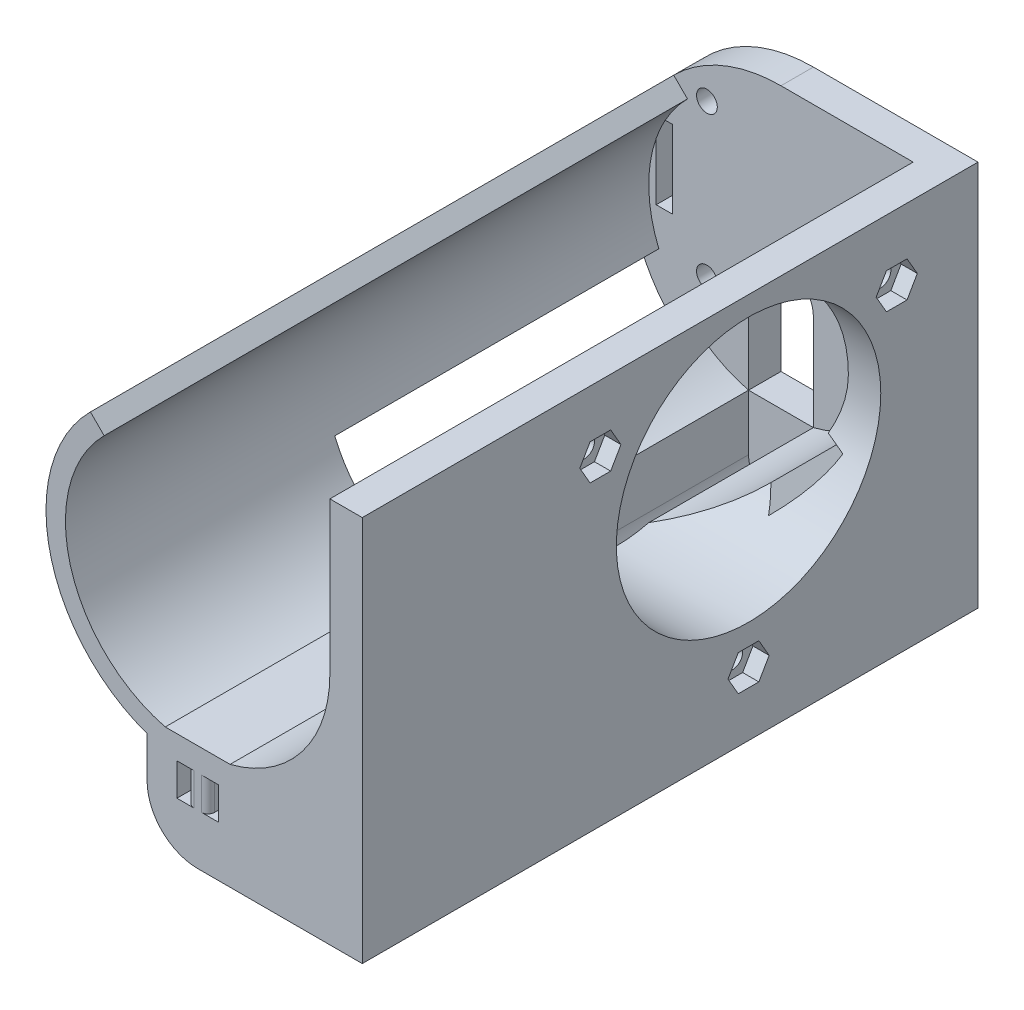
ISO-10303-21;
HEADER;
FILE_DESCRIPTION(('STEP AP214'),'2;1');
FILE_NAME('part.step','',(''),(''),'','','');
FILE_SCHEMA(('AUTOMOTIVE_DESIGN { 1 0 10303 214 1 1 1 1 }'));
ENDSEC;
DATA;
#1=APPLICATION_CONTEXT('core data for automotive mechanical design processes');
#2=APPLICATION_PROTOCOL_DEFINITION('international standard','automotive_design',2000,#1);
#3=PRODUCT_CONTEXT('',#1,'mechanical');
#4=PRODUCT('Part','Part','',(#3));
#5=PRODUCT_RELATED_PRODUCT_CATEGORY('part','',(#4));
#6=PRODUCT_DEFINITION_FORMATION('','',#4);
#7=PRODUCT_DEFINITION_CONTEXT('part definition',#1,'design');
#8=PRODUCT_DEFINITION('design','',#6,#7);
#9=PRODUCT_DEFINITION_SHAPE('','',#8);
#10=(LENGTH_UNIT() NAMED_UNIT(*) SI_UNIT(.MILLI.,.METRE.));
#11=(NAMED_UNIT(*) PLANE_ANGLE_UNIT() SI_UNIT($,.RADIAN.));
#12=(NAMED_UNIT(*) SI_UNIT($,.STERADIAN.) SOLID_ANGLE_UNIT());
#13=UNCERTAINTY_MEASURE_WITH_UNIT(LENGTH_MEASURE(1.E-05),#10,'distance_accuracy_value','');
#14=(GEOMETRIC_REPRESENTATION_CONTEXT(3) GLOBAL_UNCERTAINTY_ASSIGNED_CONTEXT((#13)) GLOBAL_UNIT_ASSIGNED_CONTEXT((#10,
#11,#12)) REPRESENTATION_CONTEXT('',''));
#15=CARTESIAN_POINT('',(0.,0.,0.));
#16=DIRECTION('',(0.,0.,1.));
#17=DIRECTION('',(1.,0.,0.));
#18=AXIS2_PLACEMENT_3D('',#15,#16,#17);
#19=CARTESIAN_POINT('',(0.,0.,-50.));
#20=DIRECTION('',(0.,0.,-1.));
#21=DIRECTION('',(-1.,0.,0.));
#22=AXIS2_PLACEMENT_3D('',#19,#20,#21);
#23=PLANE('',#22);
#24=CARTESIAN_POINT('',(-11.425426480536,15.6222347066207,-50.));
#25=DIRECTION('',(0.,0.,-1.));
#26=DIRECTION('',(-1.,0.,0.));
#27=AXIS2_PLACEMENT_3D('',#24,#25,#26);
#28=CIRCLE('',#27,1.6);
#29=CARTESIAN_POINT('',(-13.025426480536,15.6222347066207,-50.));
#30=VERTEX_POINT('',#29);
#31=EDGE_CURVE('E1185',#30,#30,#28,.F.);
#32=ORIENTED_EDGE('',*,*,#31,.F.);
#33=EDGE_LOOP('',(#32));
#34=FACE_BOUND('',#33,.T.);
#35=CARTESIAN_POINT('',(-11.425426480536,-7.87776529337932,-50.));
#36=DIRECTION('',(0.,0.,-1.));
#37=DIRECTION('',(-1.,0.,0.));
#38=AXIS2_PLACEMENT_3D('',#35,#36,#37);
#39=CIRCLE('',#38,1.6);
#40=CARTESIAN_POINT('',(-13.025426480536,-7.87776529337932,-50.));
#41=VERTEX_POINT('',#40);
#42=EDGE_CURVE('E1190',#41,#41,#39,.F.);
#43=ORIENTED_EDGE('',*,*,#42,.F.);
#44=EDGE_LOOP('',(#43));
#45=FACE_BOUND('',#44,.T.);
#46=DIRECTION('',(1.,0.,0.));
#47=VECTOR('',#46,1.);
#48=CARTESIAN_POINT('',(0.,9.87223470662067,-50.));
#49=LINE('',#48,#47);
#50=CARTESIAN_POINT('',(-17.8521422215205,9.87223470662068,-50.));
#51=VERTEX_POINT('',#50);
#52=CARTESIAN_POINT('',(-16.749999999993,9.87223470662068,-50.));
#53=VERTEX_POINT('',#52);
#54=EDGE_CURVE('E590',#51,#53,#49,.T.);
#55=ORIENTED_EDGE('',*,*,#54,.T.);
#56=DIRECTION('',(0.,1.,0.));
#57=VECTOR('',#56,1.);
#58=CARTESIAN_POINT('',(-16.749999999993,0.,-50.));
#59=LINE('',#58,#57);
#60=CARTESIAN_POINT('',(-16.749999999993,-2.12776529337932,-50.));
#61=VERTEX_POINT('',#60);
#62=EDGE_CURVE('E595',#61,#53,#59,.T.);
#63=ORIENTED_EDGE('',*,*,#62,.F.);
#64=DIRECTION('',(1.,0.,0.));
#65=VECTOR('',#64,1.);
#66=CARTESIAN_POINT('',(0.,-2.12776529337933,-50.));
#67=LINE('',#66,#65);
#68=CARTESIAN_POINT('',(-19.249999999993,-2.12776529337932,-50.));
#69=VERTEX_POINT('',#68);
#70=EDGE_CURVE('E1198',#69,#61,#67,.T.);
#71=ORIENTED_EDGE('',*,*,#70,.F.);
#72=DIRECTION('',(0.,1.,0.));
#73=VECTOR('',#72,1.);
#74=CARTESIAN_POINT('',(-19.249999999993,0.,-50.));
#75=LINE('',#74,#73);
#76=CARTESIAN_POINT('',(-19.249999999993,6.75259209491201,-50.));
#77=VERTEX_POINT('',#76);
#78=EDGE_CURVE('E1194',#69,#77,#75,.T.);
#79=ORIENTED_EDGE('',*,*,#78,.T.);
#80=CARTESIAN_POINT('',(0.,0.,-50.));
#81=DIRECTION('',(0.,0.,1.));
#82=DIRECTION('',(1.,0.,0.));
#83=AXIS2_PLACEMENT_3D('',#80,#81,#82);
#84=CIRCLE('',#83,20.4);
#85=CARTESIAN_POINT('',(-18.8471424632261,-7.80674202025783,-50.));
#86=VERTEX_POINT('',#85);
#87=EDGE_CURVE('E1209',#77,#86,#84,.T.);
#88=ORIENTED_EDGE('',*,*,#87,.T.);
#89=DIRECTION('',(-0.923879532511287,-0.38268343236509,0.));
#90=VECTOR('',#89,1.);
#91=CARTESIAN_POINT('',(4.14275551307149E-12,-1.00014965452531E-11,-50.));
#92=LINE('',#91,#90);
#93=CARTESIAN_POINT('',(-21.61878106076,-8.9547923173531,-50.));
#94=VERTEX_POINT('',#93);
#95=EDGE_CURVE('E1212',#86,#94,#92,.T.);
#96=ORIENTED_EDGE('',*,*,#95,.T.);
#97=CARTESIAN_POINT('',(0.,0.,-50.));
#98=DIRECTION('',(0.,0.,-1.));
#99=DIRECTION('',(-1.,0.,0.));
#100=AXIS2_PLACEMENT_3D('',#97,#98,#99);
#101=CIRCLE('',#100,23.4);
#102=CARTESIAN_POINT('',(-16.5462986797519,-16.5462986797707,-50.));
#103=VERTEX_POINT('',#102);
#104=EDGE_CURVE('E722',#103,#94,#101,.T.);
#105=ORIENTED_EDGE('',*,*,#104,.F.);
#106=DIRECTION('',(-0.707106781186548,-0.707106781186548,0.));
#107=VECTOR('',#106,1.);
#108=CARTESIAN_POINT('',(9.44386081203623E-12,-9.44386081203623E-12,-50.));
#109=LINE('',#108,#107);
#110=CARTESIAN_POINT('',(-14.4249783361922,-14.4249783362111,-50.));
#111=VERTEX_POINT('',#110);
#112=EDGE_CURVE('E1041',#111,#103,#109,.T.);
#113=ORIENTED_EDGE('',*,*,#112,.F.);
#114=CARTESIAN_POINT('',(0.,0.,-50.));
#115=DIRECTION('',(0.,0.,1.));
#116=DIRECTION('',(1.,0.,0.));
#117=AXIS2_PLACEMENT_3D('',#114,#115,#116);
#118=CIRCLE('',#117,20.4);
#119=CARTESIAN_POINT('',(-5.,-19.7777652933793,-50.));
#120=VERTEX_POINT('',#119);
#121=EDGE_CURVE('E1038',#111,#120,#118,.T.);
#122=ORIENTED_EDGE('',*,*,#121,.T.);
#123=DIRECTION('',(0.,-1.,0.));
#124=VECTOR('',#123,1.);
#125=CARTESIAN_POINT('',(-4.99999999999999,0.,-50.));
#126=LINE('',#125,#124);
#127=CARTESIAN_POINT('',(-4.99999999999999,-5.,-50.));
#128=VERTEX_POINT('',#127);
#129=EDGE_CURVE('E726',#128,#120,#126,.T.);
#130=ORIENTED_EDGE('',*,*,#129,.F.);
#131=CARTESIAN_POINT('',(0.,-5.,-50.));
#132=DIRECTION('',(0.,0.,-1.));
#133=DIRECTION('',(-1.,0.,0.));
#134=AXIS2_PLACEMENT_3D('',#131,#132,#133);
#135=CIRCLE('',#134,5.);
#136=CARTESIAN_POINT('',(5.,-5.,-50.));
#137=VERTEX_POINT('',#136);
#138=EDGE_CURVE('E696',#137,#128,#135,.F.);
#139=ORIENTED_EDGE('',*,*,#138,.F.);
#140=DIRECTION('',(0.,1.,0.));
#141=VECTOR('',#140,1.);
#142=CARTESIAN_POINT('',(5.,0.,-50.));
#143=LINE('',#142,#141);
#144=CARTESIAN_POINT('',(5.,-19.7777652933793,-50.));
#145=VERTEX_POINT('',#144);
#146=EDGE_CURVE('E732',#145,#137,#143,.T.);
#147=ORIENTED_EDGE('',*,*,#146,.F.);
#148=CARTESIAN_POINT('',(0.,0.,-50.));
#149=DIRECTION('',(0.,0.,1.));
#150=DIRECTION('',(1.,0.,0.));
#151=AXIS2_PLACEMENT_3D('',#148,#149,#150);
#152=CIRCLE('',#151,20.4);
#153=CARTESIAN_POINT('',(14.4249783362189,-14.4249783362,-50.));
#154=VERTEX_POINT('',#153);
#155=EDGE_CURVE('E1060',#145,#154,#152,.T.);
#156=ORIENTED_EDGE('',*,*,#155,.T.);
#157=DIRECTION('',(0.707106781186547,-0.707106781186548,0.));
#158=VECTOR('',#157,1.);
#159=CARTESIAN_POINT('',(9.44999398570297E-12,9.44999398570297E-12,-50.));
#160=LINE('',#159,#158);
#161=CARTESIAN_POINT('',(16.5462986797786,-16.5462986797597,-50.));
#162=VERTEX_POINT('',#161);
#163=EDGE_CURVE('E1045',#154,#162,#160,.T.);
#164=ORIENTED_EDGE('',*,*,#163,.T.);
#165=CARTESIAN_POINT('',(0.,0.,-50.));
#166=DIRECTION('',(0.,0.,1.));
#167=DIRECTION('',(1.,0.,0.));
#168=AXIS2_PLACEMENT_3D('',#165,#166,#167);
#169=CIRCLE('',#168,23.4000000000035);
#170=CARTESIAN_POINT('',(21.6187810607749,-8.95479231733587,-50.));
#171=VERTEX_POINT('',#170);
#172=EDGE_CURVE('E2245',#162,#171,#169,.T.);
#173=ORIENTED_EDGE('',*,*,#172,.T.);
#174=DIRECTION('',(0.923879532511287,-0.38268343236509,0.));
#175=VECTOR('',#174,1.);
#176=CARTESIAN_POINT('',(4.14341936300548E-12,1.00030992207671E-11,-50.));
#177=LINE('',#176,#175);
#178=CARTESIAN_POINT('',(18.8471424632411,-7.8067420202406,-50.));
#179=VERTEX_POINT('',#178);
#180=EDGE_CURVE('E1224',#179,#171,#177,.T.);
#181=ORIENTED_EDGE('',*,*,#180,.F.);
#182=CARTESIAN_POINT('',(0.,0.,-50.));
#183=DIRECTION('',(0.,0.,1.));
#184=DIRECTION('',(1.,0.,0.));
#185=AXIS2_PLACEMENT_3D('',#182,#183,#184);
#186=CIRCLE('',#185,20.4);
#187=CARTESIAN_POINT('',(20.400000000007,6.95388704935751E-12,-50.));
#188=VERTEX_POINT('',#187);
#189=EDGE_CURVE('E1226',#179,#188,#186,.T.);
#190=ORIENTED_EDGE('',*,*,#189,.T.);
#191=DIRECTION('',(0.,1.,0.));
#192=VECTOR('',#191,1.);
#193=CARTESIAN_POINT('',(20.400000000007,6.95388704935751E-12,-50.));
#194=LINE('',#193,#192);
#195=CARTESIAN_POINT('',(20.400000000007,23.4,-50.));
#196=VERTEX_POINT('',#195);
#197=EDGE_CURVE('E2241',#188,#196,#194,.T.);
#198=ORIENTED_EDGE('',*,*,#197,.T.);
#199=DIRECTION('',(1.,0.,0.));
#200=VECTOR('',#199,1.);
#201=CARTESIAN_POINT('',(0.,23.4,-50.));
#202=LINE('',#201,#200);
#203=CARTESIAN_POINT('',(0.,23.4,-50.));
#204=VERTEX_POINT('',#203);
#205=EDGE_CURVE('E723',#204,#196,#202,.T.);
#206=ORIENTED_EDGE('',*,*,#205,.F.);
#207=CARTESIAN_POINT('',(-16.5462986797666,16.5462986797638,-50.));
#208=VERTEX_POINT('',#207);
#209=EDGE_CURVE('E635',#208,#204,#101,.T.);
#210=ORIENTED_EDGE('',*,*,#209,.F.);
#211=DIRECTION('',(-0.707106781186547,0.707106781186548,0.));
#212=VECTOR('',#211,1.);
#213=CARTESIAN_POINT('',(-1.45110888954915E-12,-1.45110888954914E-12,-50.));
#214=LINE('',#213,#212);
#215=CARTESIAN_POINT('',(-14.424978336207,14.4249783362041,-50.));
#216=VERTEX_POINT('',#215);
#217=EDGE_CURVE('E758',#216,#208,#214,.T.);
#218=ORIENTED_EDGE('',*,*,#217,.F.);
#219=EDGE_CURVE('E1208',#216,#51,#84,.T.);
#220=ORIENTED_EDGE('',*,*,#219,.T.);
#221=EDGE_LOOP('',(#55,#63,#71,#79,#88,#96,#105,#113,#122,#130,#139,#147,#156,#164,#173,#181,
#190,#198,#206,#210,#218,#220));
#222=FACE_BOUND('',#221,.T.);
#223=ADVANCED_FACE('F47',(#34,#45,#222),#23,.F.);
#224=CARTESIAN_POINT('',(0.,0.,-55.));
#225=DIRECTION('',(0.,0.,-1.));
#226=DIRECTION('',(-1.,0.,0.));
#227=AXIS2_PLACEMENT_3D('',#224,#225,#226);
#228=PLANE('',#227);
#229=DIRECTION('',(0.499999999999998,-0.86602540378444,0.));
#230=VECTOR('',#229,1.);
#231=CARTESIAN_POINT('',(0.577126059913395,0.333203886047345,-55.));
#232=LINE('',#231,#230);
#233=CARTESIAN_POINT('',(-9.83771324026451,18.3722347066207,-55.));
#234=VERTEX_POINT('',#233);
#235=CARTESIAN_POINT('',(-8.24999999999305,15.6222347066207,-55.));
#236=VERTEX_POINT('',#235);
#237=EDGE_CURVE('E616',#234,#236,#232,.T.);
#238=ORIENTED_EDGE('',*,*,#237,.F.);
#239=DIRECTION('',(1.,0.,0.));
#240=VECTOR('',#239,1.);
#241=CARTESIAN_POINT('',(0.,18.3722347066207,-55.));
#242=LINE('',#241,#240);
#243=CARTESIAN_POINT('',(-13.0131397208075,18.3722347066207,-55.));
#244=VERTEX_POINT('',#243);
#245=EDGE_CURVE('E600',#244,#234,#242,.T.);
#246=ORIENTED_EDGE('',*,*,#245,.F.);
#247=DIRECTION('',(0.5,0.866025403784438,0.));
#248=VECTOR('',#247,1.);
#249=CARTESIAN_POINT('',(-17.7152657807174,10.227913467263,-55.));
#250=LINE('',#249,#248);
#251=CARTESIAN_POINT('',(-14.6008529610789,15.6222347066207,-55.));
#252=VERTEX_POINT('',#251);
#253=EDGE_CURVE('E628',#252,#244,#250,.T.);
#254=ORIENTED_EDGE('',*,*,#253,.F.);
#255=DIRECTION('',(-0.5,0.866025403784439,0.));
#256=VECTOR('',#255,1.);
#257=CARTESIAN_POINT('',(-4.18601366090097,-2.41679611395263,-55.));
#258=LINE('',#257,#256);
#259=CARTESIAN_POINT('',(-13.0131397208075,12.8722347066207,-55.));
#260=VERTEX_POINT('',#259);
#261=EDGE_CURVE('E625',#260,#252,#258,.T.);
#262=ORIENTED_EDGE('',*,*,#261,.F.);
#263=DIRECTION('',(-1.,0.,0.));
#264=VECTOR('',#263,1.);
#265=CARTESIAN_POINT('',(0.,12.8722347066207,-55.));
#266=LINE('',#265,#264);
#267=CARTESIAN_POINT('',(-9.83771324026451,12.8722347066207,-55.));
#268=VERTEX_POINT('',#267);
#269=EDGE_CURVE('E622',#268,#260,#266,.T.);
#270=ORIENTED_EDGE('',*,*,#269,.F.);
#271=DIRECTION('',(-0.499999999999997,-0.86602540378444,0.));
#272=VECTOR('',#271,1.);
#273=CARTESIAN_POINT('',(-12.952126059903,7.47791346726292,-55.));
#274=LINE('',#273,#272);
#275=EDGE_CURVE('E618',#236,#268,#274,.T.);
#276=ORIENTED_EDGE('',*,*,#275,.F.);
#277=EDGE_LOOP('',(#238,#246,#254,#262,#270,#276));
#278=FACE_BOUND('',#277,.T.);
#279=DIRECTION('',(-0.5,-0.866025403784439,0.));
#280=VECTOR('',#279,1.);
#281=CARTESIAN_POINT('',(-2.77632756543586,1.60291346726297,-55.));
#282=LINE('',#281,#280);
#283=CARTESIAN_POINT('',(-8.24999999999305,-7.87776529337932,-55.));
#284=VERTEX_POINT('',#283);
#285=CARTESIAN_POINT('',(-9.83771324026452,-10.6277652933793,-55.));
#286=VERTEX_POINT('',#285);
#287=EDGE_CURVE('E665',#284,#286,#282,.T.);
#288=ORIENTED_EDGE('',*,*,#287,.F.);
#289=DIRECTION('',(0.5,-0.866025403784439,0.));
#290=VECTOR('',#289,1.);
#291=CARTESIAN_POINT('',(-9.59867243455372,-5.54179611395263,-55.));
#292=LINE('',#291,#290);
#293=CARTESIAN_POINT('',(-9.83771324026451,-5.12776529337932,-55.));
#294=VERTEX_POINT('',#293);
#295=EDGE_CURVE('E650',#294,#284,#292,.T.);
#296=ORIENTED_EDGE('',*,*,#295,.F.);
#297=DIRECTION('',(-1.,0.,0.));
#298=VECTOR('',#297,1.);
#299=CARTESIAN_POINT('',(0.,-5.12776529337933,-55.));
#300=LINE('',#299,#298);
#301=CARTESIAN_POINT('',(-13.0131397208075,-5.12776529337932,-55.));
#302=VERTEX_POINT('',#301);
#303=EDGE_CURVE('E676',#294,#302,#300,.T.);
#304=ORIENTED_EDGE('',*,*,#303,.T.);
#305=DIRECTION('',(0.5,0.866025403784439,0.));
#306=VECTOR('',#305,1.);
#307=CARTESIAN_POINT('',(-7.53946728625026,4.35291346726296,-55.));
#308=LINE('',#307,#306);
#309=CARTESIAN_POINT('',(-14.6008529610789,-7.87776529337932,-55.));
#310=VERTEX_POINT('',#309);
#311=EDGE_CURVE('E673',#310,#302,#308,.T.);
#312=ORIENTED_EDGE('',*,*,#311,.F.);
#313=DIRECTION('',(-0.5,0.866025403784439,0.));
#314=VECTOR('',#313,1.);
#315=CARTESIAN_POINT('',(-14.3618121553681,-8.29179611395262,-55.));
#316=LINE('',#315,#314);
#317=CARTESIAN_POINT('',(-13.0131397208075,-10.6277652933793,-55.));
#318=VERTEX_POINT('',#317);
#319=EDGE_CURVE('E670',#318,#310,#316,.T.);
#320=ORIENTED_EDGE('',*,*,#319,.F.);
#321=DIRECTION('',(-1.,0.,0.));
#322=VECTOR('',#321,1.);
#323=CARTESIAN_POINT('',(0.,-10.6277652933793,-55.));
#324=LINE('',#323,#322);
#325=EDGE_CURVE('E667',#286,#318,#324,.T.);
#326=ORIENTED_EDGE('',*,*,#325,.F.);
#327=EDGE_LOOP('',(#288,#296,#304,#312,#320,#326));
#328=FACE_BOUND('',#327,.T.);
#329=CARTESIAN_POINT('',(0.,0.,-55.));
#330=DIRECTION('',(0.,0.,-1.));
#331=DIRECTION('',(-1.,0.,0.));
#332=AXIS2_PLACEMENT_3D('',#329,#330,#331);
#333=CIRCLE('',#332,23.4);
#334=CARTESIAN_POINT('',(-7.8,-22.0617315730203,-55.));
#335=VERTEX_POINT('',#334);
#336=CARTESIAN_POINT('',(0.,23.4,-55.));
#337=VERTEX_POINT('',#336);
#338=EDGE_CURVE('E692',#335,#337,#333,.T.);
#339=ORIENTED_EDGE('',*,*,#338,.T.);
#340=DIRECTION('',(1.,0.,0.));
#341=VECTOR('',#340,1.);
#342=CARTESIAN_POINT('',(0.,23.4,-55.));
#343=LINE('',#342,#341);
#344=CARTESIAN_POINT('',(25.400000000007,23.4,-55.));
#345=VERTEX_POINT('',#344);
#346=EDGE_CURVE('E695',#337,#345,#343,.T.);
#347=ORIENTED_EDGE('',*,*,#346,.T.);
#348=DIRECTION('',(0.,-1.,0.));
#349=VECTOR('',#348,1.);
#350=CARTESIAN_POINT('',(25.400000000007,0.,-55.));
#351=LINE('',#350,#349);
#352=CARTESIAN_POINT('',(25.400000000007,-36.2,-55.));
#353=VERTEX_POINT('',#352);
#354=EDGE_CURVE('E699',#345,#353,#351,.T.);
#355=ORIENTED_EDGE('',*,*,#354,.T.);
#356=DIRECTION('',(-1.,0.,0.));
#357=VECTOR('',#356,1.);
#358=CARTESIAN_POINT('',(0.,-36.2,-55.));
#359=LINE('',#358,#357);
#360=CARTESIAN_POINT('',(0.,-36.2,-55.));
#361=VERTEX_POINT('',#360);
#362=EDGE_CURVE('E702',#353,#361,#359,.T.);
#363=ORIENTED_EDGE('',*,*,#362,.T.);
#364=CARTESIAN_POINT('',(0.,-28.4,-55.));
#365=DIRECTION('',(0.,0.,-1.));
#366=DIRECTION('',(-1.,0.,0.));
#367=AXIS2_PLACEMENT_3D('',#364,#365,#366);
#368=CIRCLE('',#367,7.8);
#369=CARTESIAN_POINT('',(-7.8,-28.4,-55.));
#370=VERTEX_POINT('',#369);
#371=EDGE_CURVE('E705',#361,#370,#368,.T.);
#372=ORIENTED_EDGE('',*,*,#371,.T.);
#373=DIRECTION('',(0.,1.,0.));
#374=VECTOR('',#373,1.);
#375=CARTESIAN_POINT('',(-7.80000000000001,0.,-55.));
#376=LINE('',#375,#374);
#377=EDGE_CURVE('E708',#370,#335,#376,.T.);
#378=ORIENTED_EDGE('',*,*,#377,.T.);
#379=EDGE_LOOP('',(#339,#347,#355,#363,#372,#378));
#380=FACE_BOUND('',#379,.T.);
#381=DIRECTION('',(0.,-1.,0.));
#382=VECTOR('',#381,1.);
#383=CARTESIAN_POINT('',(-4.99999999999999,0.,-55.));
#384=LINE('',#383,#382);
#385=CARTESIAN_POINT('',(-4.99999999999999,-5.,-55.));
#386=VERTEX_POINT('',#385);
#387=CARTESIAN_POINT('',(-5.,-19.7777652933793,-55.));
#388=VERTEX_POINT('',#387);
#389=EDGE_CURVE('E711',#386,#388,#384,.T.);
#390=ORIENTED_EDGE('',*,*,#389,.T.);
#391=DIRECTION('',(-1.,0.,0.));
#392=VECTOR('',#391,1.);
#393=CARTESIAN_POINT('',(0.,-19.7777652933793,-55.));
#394=LINE('',#393,#392);
#395=CARTESIAN_POINT('',(5.,-19.7777652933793,-55.));
#396=VERTEX_POINT('',#395);
#397=EDGE_CURVE('E713',#396,#388,#394,.T.);
#398=ORIENTED_EDGE('',*,*,#397,.F.);
#399=DIRECTION('',(0.,1.,0.));
#400=VECTOR('',#399,1.);
#401=CARTESIAN_POINT('',(5.,0.,-55.));
#402=LINE('',#401,#400);
#403=CARTESIAN_POINT('',(5.,-5.,-55.));
#404=VERTEX_POINT('',#403);
#405=EDGE_CURVE('E716',#396,#404,#402,.T.);
#406=ORIENTED_EDGE('',*,*,#405,.T.);
#407=CARTESIAN_POINT('',(0.,-5.,-55.));
#408=DIRECTION('',(0.,0.,-1.));
#409=DIRECTION('',(-1.,0.,0.));
#410=AXIS2_PLACEMENT_3D('',#407,#408,#409);
#411=CIRCLE('',#410,5.);
#412=EDGE_CURVE('E718',#404,#386,#411,.F.);
#413=ORIENTED_EDGE('',*,*,#412,.T.);
#414=EDGE_LOOP('',(#390,#398,#406,#413));
#415=FACE_BOUND('',#414,.T.);
#416=DIRECTION('',(0.,-1.,0.));
#417=VECTOR('',#416,1.);
#418=CARTESIAN_POINT('',(-16.749999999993,0.,-55.));
#419=LINE('',#418,#417);
#420=CARTESIAN_POINT('',(-16.749999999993,9.87223470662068,-55.));
#421=VERTEX_POINT('',#420);
#422=CARTESIAN_POINT('',(-16.749999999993,-2.12776529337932,-55.));
#423=VERTEX_POINT('',#422);
#424=EDGE_CURVE('E583',#421,#423,#419,.T.);
#425=ORIENTED_EDGE('',*,*,#424,.F.);
#426=DIRECTION('',(-1.,0.,0.));
#427=VECTOR('',#426,1.);
#428=CARTESIAN_POINT('',(0.,9.87223470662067,-55.));
#429=LINE('',#428,#427);
#430=CARTESIAN_POINT('',(-19.249999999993,9.87223470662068,-55.));
#431=VERTEX_POINT('',#430);
#432=EDGE_CURVE('E569',#421,#431,#429,.T.);
#433=ORIENTED_EDGE('',*,*,#432,.T.);
#434=DIRECTION('',(0.,-1.,0.));
#435=VECTOR('',#434,1.);
#436=CARTESIAN_POINT('',(-19.249999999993,0.,-55.));
#437=LINE('',#436,#435);
#438=CARTESIAN_POINT('',(-19.249999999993,-2.12776529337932,-55.));
#439=VERTEX_POINT('',#438);
#440=EDGE_CURVE('E576',#431,#439,#437,.T.);
#441=ORIENTED_EDGE('',*,*,#440,.T.);
#442=DIRECTION('',(-1.,0.,0.));
#443=VECTOR('',#442,1.);
#444=CARTESIAN_POINT('',(0.,-2.12776529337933,-55.));
#445=LINE('',#444,#443);
#446=EDGE_CURVE('E72',#423,#439,#445,.T.);
#447=ORIENTED_EDGE('',*,*,#446,.F.);
#448=EDGE_LOOP('',(#425,#433,#441,#447));
#449=FACE_BOUND('',#448,.T.);
#450=ADVANCED_FACE('F581',(#278,#328,#380,#415,#449),#228,.T.);
#451=CARTESIAN_POINT('',(0.,0.,40.));
#452=DIRECTION('',(0.,0.,-1.));
#453=DIRECTION('',(-1.,0.,0.));
#454=AXIS2_PLACEMENT_3D('',#451,#452,#453);
#455=CYLINDRICAL_SURFACE('',#454,20.4);
#456=DIRECTION('',(0.,0.,-1.));
#457=VECTOR('',#456,1.);
#458=CARTESIAN_POINT('',(5.,-19.7777652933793,40.));
#459=LINE('',#458,#457);
#460=CARTESIAN_POINT('',(5.,-19.7777652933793,-24.6));
#461=VERTEX_POINT('',#460);
#462=EDGE_CURVE('E1106',#461,#145,#459,.T.);
#463=ORIENTED_EDGE('',*,*,#462,.F.);
#464=CARTESIAN_POINT('',(0.,3.47694352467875E-12,-19.6));
#465=DIRECTION('',(-0.707106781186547,0.,-0.707106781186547));
#466=DIRECTION('',(0.707106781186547,0.,-0.707106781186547));
#467=AXIS2_PLACEMENT_3D('',#464,#465,#466);
#468=ELLIPSE('',#467,28.8499566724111,20.4);
#469=CARTESIAN_POINT('',(14.4249783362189,-14.4249783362,-34.0249783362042));
#470=VERTEX_POINT('',#469);
#471=EDGE_CURVE('E939',#461,#470,#468,.F.);
#472=ORIENTED_EDGE('',*,*,#471,.T.);
#473=DIRECTION('',(0.,0.,1.));
#474=VECTOR('',#473,1.);
#475=CARTESIAN_POINT('',(14.4249783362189,-14.4249783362,-50.));
#476=LINE('',#475,#474);
#477=EDGE_CURVE('E1061',#154,#470,#476,.T.);
#478=ORIENTED_EDGE('',*,*,#477,.F.);
#479=ORIENTED_EDGE('',*,*,#155,.F.);
#480=EDGE_LOOP('',(#463,#472,#478,#479));
#481=FACE_BOUND('',#480,.T.);
#482=ADVANCED_FACE('F997',(#481),#455,.F.);
#483=DIRECTION('',(0.,0.,1.));
#484=VECTOR('',#483,1.);
#485=CARTESIAN_POINT('',(18.8471424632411,-7.8067420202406,-50.));
#486=LINE('',#485,#484);
#487=CARTESIAN_POINT('',(18.8471424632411,-7.8067420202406,-38.4471424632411));
#488=VERTEX_POINT('',#487);
#489=EDGE_CURVE('E1219',#179,#488,#486,.T.);
#490=ORIENTED_EDGE('',*,*,#489,.T.);
#491=CARTESIAN_POINT('',(20.400000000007,6.95388704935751E-12,-40.));
#492=VERTEX_POINT('',#491);
#493=EDGE_CURVE('E934',#488,#492,#468,.F.);
#494=ORIENTED_EDGE('',*,*,#493,.T.);
#495=DIRECTION('',(0.,0.,-1.));
#496=VECTOR('',#495,1.);
#497=CARTESIAN_POINT('',(20.400000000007,6.95388704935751E-12,40.));
#498=LINE('',#497,#496);
#499=EDGE_CURVE('E1109',#492,#188,#498,.T.);
#500=ORIENTED_EDGE('',*,*,#499,.T.);
#501=ORIENTED_EDGE('',*,*,#189,.F.);
#502=EDGE_LOOP('',(#490,#494,#500,#501));
#503=FACE_BOUND('',#502,.T.);
#504=ADVANCED_FACE('F2208',(#503),#455,.F.);
#505=CARTESIAN_POINT('',(20.400000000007,6.95388704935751E-12,40.));
#506=VERTEX_POINT('',#505);
#507=CARTESIAN_POINT('',(20.400000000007,6.95388704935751E-12,0.799999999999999));
#508=VERTEX_POINT('',#507);
#509=EDGE_CURVE('E1111',#506,#508,#498,.T.);
#510=ORIENTED_EDGE('',*,*,#509,.T.);
#511=CARTESIAN_POINT('',(0.,3.47694352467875E-12,-19.6));
#512=DIRECTION('',(0.707106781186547,0.,-0.707106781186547));
#513=DIRECTION('',(-0.707106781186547,0.,-0.707106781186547));
#514=AXIS2_PLACEMENT_3D('',#511,#512,#513);
#515=ELLIPSE('',#514,28.8499566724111,20.4);
#516=CARTESIAN_POINT('',(18.8471424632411,-7.8067420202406,-0.752857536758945));
#517=VERTEX_POINT('',#516);
#518=EDGE_CURVE('E931',#508,#517,#515,.T.);
#519=ORIENTED_EDGE('',*,*,#518,.T.);
#520=CARTESIAN_POINT('',(18.8471424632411,-7.8067420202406,0.));
#521=VERTEX_POINT('',#520);
#522=EDGE_CURVE('E1234',#517,#521,#486,.T.);
#523=ORIENTED_EDGE('',*,*,#522,.T.);
#524=CARTESIAN_POINT('',(0.,0.,0.));
#525=DIRECTION('',(0.,0.,1.));
#526=DIRECTION('',(1.,0.,0.));
#527=AXIS2_PLACEMENT_3D('',#524,#525,#526);
#528=CIRCLE('',#527,20.4);
#529=CARTESIAN_POINT('',(14.424978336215,-14.4249783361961,0.));
#530=VERTEX_POINT('',#529);
#531=EDGE_CURVE('E1096',#530,#521,#528,.T.);
#532=ORIENTED_EDGE('',*,*,#531,.F.);
#533=CARTESIAN_POINT('',(14.4249783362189,-14.4249783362,-5.17502166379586));
#534=VERTEX_POINT('',#533);
#535=EDGE_CURVE('E1065',#534,#530,#476,.T.);
#536=ORIENTED_EDGE('',*,*,#535,.F.);
#537=CARTESIAN_POINT('',(5.,-19.7777652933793,-14.6));
#538=VERTEX_POINT('',#537);
#539=EDGE_CURVE('E935',#534,#538,#515,.T.);
#540=ORIENTED_EDGE('',*,*,#539,.T.);
#541=CARTESIAN_POINT('',(5.,-19.7777652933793,0.));
#542=VERTEX_POINT('',#541);
#543=EDGE_CURVE('E1110',#542,#538,#459,.T.);
#544=ORIENTED_EDGE('',*,*,#543,.F.);
#545=CARTESIAN_POINT('',(5.,-19.7777652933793,40.));
#546=VERTEX_POINT('',#545);
#547=EDGE_CURVE('E1107',#546,#542,#459,.T.);
#548=ORIENTED_EDGE('',*,*,#547,.F.);
#549=CARTESIAN_POINT('',(0.,0.,40.));
#550=DIRECTION('',(0.,0.,1.));
#551=DIRECTION('',(1.,0.,0.));
#552=AXIS2_PLACEMENT_3D('',#549,#550,#551);
#553=CIRCLE('',#552,20.4);
#554=EDGE_CURVE('E1083',#546,#506,#553,.T.);
#555=ORIENTED_EDGE('',*,*,#554,.T.);
#556=EDGE_LOOP('',(#510,#519,#523,#532,#536,#540,#544,#548,#555));
#557=FACE_BOUND('',#556,.T.);
#558=ADVANCED_FACE('F2209',(#557),#455,.F.);
#559=CARTESIAN_POINT('',(9.44999398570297E-12,9.44999398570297E-12,-50.));
#560=DIRECTION('',(-0.707106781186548,-0.707106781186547,0.));
#561=DIRECTION('',(0.707106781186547,-0.707106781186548,0.));
#562=AXIS2_PLACEMENT_3D('',#559,#560,#561);
#563=PLANE('',#562);
#564=CARTESIAN_POINT('',(1.19487753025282E-11,6.95388704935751E-12,-19.6));
#565=DIRECTION('',(-0.707106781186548,-0.707106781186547,0.));
#566=DIRECTION('',(-0.707106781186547,0.707106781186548,0.));
#567=AXIS2_PLACEMENT_3D('',#564,#565,#566);
#568=ELLIPSE('',#567,28.8499566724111,20.4);
#569=CARTESIAN_POINT('',(16.5462986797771,-16.5462986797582,-7.66769091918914));
#570=VERTEX_POINT('',#569);
#571=EDGE_CURVE('E2253',#534,#570,#568,.F.);
#572=ORIENTED_EDGE('',*,*,#571,.F.);
#573=ORIENTED_EDGE('',*,*,#535,.T.);
#574=DIRECTION('',(0.707106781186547,-0.707106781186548,0.));
#575=VECTOR('',#574,1.);
#576=CARTESIAN_POINT('',(9.44999398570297E-12,9.44999398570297E-12,0.));
#577=LINE('',#576,#575);
#578=CARTESIAN_POINT('',(16.5462986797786,-16.5462986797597,0.));
#579=VERTEX_POINT('',#578);
#580=EDGE_CURVE('E1056',#530,#579,#577,.T.);
#581=ORIENTED_EDGE('',*,*,#580,.T.);
#582=DIRECTION('',(0.,0.,1.));
#583=VECTOR('',#582,1.);
#584=CARTESIAN_POINT('',(16.5462986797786,-16.5462986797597,-50.));
#585=LINE('',#584,#583);
#586=EDGE_CURVE('E1069',#570,#579,#585,.T.);
#587=ORIENTED_EDGE('',*,*,#586,.F.);
#588=EDGE_LOOP('',(#572,#573,#581,#587));
#589=FACE_BOUND('',#588,.T.);
#590=ADVANCED_FACE('F1720',(#589),#563,.F.);
#591=CARTESIAN_POINT('',(4.14341936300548E-12,1.00030992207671E-11,-50.));
#592=DIRECTION('',(-0.38268343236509,-0.923879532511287,0.));
#593=DIRECTION('',(0.923879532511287,-0.38268343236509,0.));
#594=AXIS2_PLACEMENT_3D('',#591,#592,#593);
#595=PLANE('',#594);
#596=ORIENTED_EDGE('',*,*,#522,.F.);
#597=CARTESIAN_POINT('',(1.15012166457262E-11,6.95388704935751E-12,-19.6));
#598=DIRECTION('',(-0.38268343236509,-0.923879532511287,0.));
#599=DIRECTION('',(-0.923879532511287,0.38268343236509,0.));
#600=AXIS2_PLACEMENT_3D('',#597,#598,#599);
#601=ELLIPSE('',#600,53.3077689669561,20.4);
#602=CARTESIAN_POINT('',(21.6187810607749,-8.95479231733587,-1.2704693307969));
#603=VERTEX_POINT('',#602);
#604=EDGE_CURVE('E942',#517,#603,#601,.F.);
#605=ORIENTED_EDGE('',*,*,#604,.T.);
#606=DIRECTION('',(0.,0.,1.));
#607=VECTOR('',#606,1.);
#608=CARTESIAN_POINT('',(21.6187810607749,-8.95479231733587,-50.));
#609=LINE('',#608,#607);
#610=CARTESIAN_POINT('',(21.6187810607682,-8.95479231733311,0.));
#611=VERTEX_POINT('',#610);
#612=EDGE_CURVE('E1229',#603,#611,#609,.T.);
#613=ORIENTED_EDGE('',*,*,#612,.T.);
#614=DIRECTION('',(0.923879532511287,-0.38268343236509,0.));
#615=VECTOR('',#614,1.);
#616=CARTESIAN_POINT('',(4.14341936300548E-12,1.00030992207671E-11,0.));
#617=LINE('',#616,#615);
#618=EDGE_CURVE('E1064',#521,#611,#617,.T.);
#619=ORIENTED_EDGE('',*,*,#618,.F.);
#620=EDGE_LOOP('',(#596,#605,#613,#619));
#621=FACE_BOUND('',#620,.T.);
#622=ADVANCED_FACE('F1739',(#621),#595,.T.);
#623=CARTESIAN_POINT('',(0.,0.,-114.786727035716));
#624=DIRECTION('',(0.,0.,1.));
#625=DIRECTION('',(1.,0.,0.));
#626=AXIS2_PLACEMENT_3D('',#623,#624,#625);
#627=CYLINDRICAL_SURFACE('',#626,23.4000000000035);
#628=ORIENTED_EDGE('',*,*,#612,.F.);
#629=CARTESIAN_POINT('',(21.6187810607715,-8.95479231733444,-1.27046933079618));
#630=CARTESIAN_POINT('',(21.5015948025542,-9.23770688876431,-1.40868835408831));
#631=CARTESIAN_POINT('',(21.379884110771,-9.51583124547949,-1.55267559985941));
#632=CARTESIAN_POINT('',(21.1282228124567,-10.0622392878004,-1.85152640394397));
#633=CARTESIAN_POINT('',(20.9982742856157,-10.3305254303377,-2.00638721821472));
#634=CARTESIAN_POINT('',(20.5975632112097,-11.1197164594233,-2.48595569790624));
#635=CARTESIAN_POINT('',(20.3156061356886,-11.6257388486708,-2.8260358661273));
#636=CARTESIAN_POINT('',(19.7336573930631,-12.5878232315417,-3.53582286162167));
#637=CARTESIAN_POINT('',(19.4340854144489,-13.0446247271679,-3.90488071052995));
#638=CARTESIAN_POINT('',(18.8180623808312,-13.9185573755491,-4.67442676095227));
#639=CARTESIAN_POINT('',(18.5016116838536,-14.3356893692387,-5.07491429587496));
#640=CARTESIAN_POINT('',(17.9138384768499,-15.0609599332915,-5.83220472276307));
#641=CARTESIAN_POINT('',(17.6443060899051,-15.3753997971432,-6.18439300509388));
#642=CARTESIAN_POINT('',(17.2357196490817,-15.8281941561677,-6.72815258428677));
#643=CARTESIAN_POINT('',(17.0982806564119,-15.9765068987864,-6.91271419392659));
#644=CARTESIAN_POINT('',(16.8226991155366,-16.266432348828,-7.28662844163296));
#645=CARTESIAN_POINT('',(16.6845563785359,-16.4080431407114,-7.47598242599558));
#646=CARTESIAN_POINT('',(16.5462986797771,-16.5462986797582,-7.66769091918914));
#647=B_SPLINE_CURVE_WITH_KNOTS('',3,(#629,#630,#631,#632,#633,#634,#635,#636,#637,#638,#639,
#640,#641,#642,#643,#644,#645,#646),.UNSPECIFIED.,.F.,.F.,(4,2,2,2,2,2,2,2,4),(0.,
1.00765991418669,2.01506644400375,4.02708753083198,6.00262761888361,7.97812581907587,
9.60802464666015,10.4292194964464,11.2506476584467),.UNSPECIFIED.);
#648=EDGE_CURVE('E952',#603,#570,#647,.T.);
#649=ORIENTED_EDGE('',*,*,#648,.T.);
#650=ORIENTED_EDGE('',*,*,#586,.T.);
#651=CARTESIAN_POINT('',(0.,0.,0.));
#652=DIRECTION('',(0.,0.,1.));
#653=DIRECTION('',(1.,0.,0.));
#654=AXIS2_PLACEMENT_3D('',#651,#652,#653);
#655=CIRCLE('',#654,23.4);
#656=EDGE_CURVE('E1092',#579,#611,#655,.T.);
#657=ORIENTED_EDGE('',*,*,#656,.T.);
#658=EDGE_LOOP('',(#628,#649,#650,#657));
#659=FACE_BOUND('',#658,.T.);
#660=ADVANCED_FACE('F958',(#659),#627,.F.);
#661=CARTESIAN_POINT('',(16.5462986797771,-16.5462986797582,-31.5323090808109));
#662=VERTEX_POINT('',#661);
#663=EDGE_CURVE('E1066',#162,#662,#585,.T.);
#664=ORIENTED_EDGE('',*,*,#663,.T.);
#665=CARTESIAN_POINT('',(16.5462986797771,-16.5462986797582,-31.5323090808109));
#666=CARTESIAN_POINT('',(16.7158419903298,-16.3767619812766,-31.7673845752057));
#667=CARTESIAN_POINT('',(16.885215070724,-16.2021708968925,-31.9989435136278));
#668=CARTESIAN_POINT('',(17.2228261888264,-15.8428212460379,-32.4549369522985));
#669=CARTESIAN_POINT('',(17.3910641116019,-15.6580616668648,-32.6793707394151));
#670=CARTESIAN_POINT('',(17.7258530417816,-15.2780358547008,-33.1213410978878));
#671=CARTESIAN_POINT('',(17.8924007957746,-15.0827527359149,-33.3388656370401));
#672=CARTESIAN_POINT('',(18.2227391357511,-14.6819355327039,-33.7663907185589));
#673=CARTESIAN_POINT('',(18.3865298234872,-14.4764018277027,-33.976391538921));
#674=CARTESIAN_POINT('',(18.8659497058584,-13.8530459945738,-34.5862084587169));
#675=CARTESIAN_POINT('',(19.1766643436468,-13.4205442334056,-34.9750646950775));
#676=CARTESIAN_POINT('',(19.7787795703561,-12.5161747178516,-35.7198017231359));
#677=CARTESIAN_POINT('',(20.0701978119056,-12.0443438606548,-36.0757127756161));
#678=CARTESIAN_POINT('',(20.4640967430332,-11.3505512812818,-36.5524438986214));
#679=CARTESIAN_POINT('',(20.5769420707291,-11.1447486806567,-36.6884737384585));
#680=CARTESIAN_POINT('',(20.7979896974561,-10.7265800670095,-36.9540142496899));
#681=CARTESIAN_POINT('',(20.9061926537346,-10.5142149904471,-37.0835258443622));
#682=CARTESIAN_POINT('',(21.2250147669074,-9.86374072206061,-37.4639411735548));
#683=CARTESIAN_POINT('',(21.4278928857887,-9.41567066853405,-37.7043661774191));
#684=CARTESIAN_POINT('',(21.6187810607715,-8.95479231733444,-37.9295306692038));
#685=B_SPLINE_CURVE_WITH_KNOTS('',3,(#665,#666,#667,#668,#669,#670,#671,#672,#673,#674,#675,
#676,#677,#678,#679,#680,#681,#682,#683,#684),.UNSPECIFIED.,.F.,.F.,(4,2,2,2,2,2,2,2,2,4),(0.,
1.00728816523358,2.01467683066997,3.02373306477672,4.03275197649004,6.0087513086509,
7.9829172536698,8.79660066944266,9.61016850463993,11.2510323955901),.UNSPECIFIED.);
#686=CARTESIAN_POINT('',(21.6187810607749,-8.95479231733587,-37.9295306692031));
#687=VERTEX_POINT('',#686);
#688=EDGE_CURVE('E943',#662,#687,#685,.T.);
#689=ORIENTED_EDGE('',*,*,#688,.T.);
#690=EDGE_CURVE('E1235',#171,#687,#609,.T.);
#691=ORIENTED_EDGE('',*,*,#690,.F.);
#692=ORIENTED_EDGE('',*,*,#172,.F.);
#693=EDGE_LOOP('',(#664,#689,#691,#692));
#694=FACE_BOUND('',#693,.T.);
#695=ADVANCED_FACE('F1660',(#694),#627,.F.);
#696=CARTESIAN_POINT('',(0.,-28.4,40.));
#697=DIRECTION('',(0.,0.,-1.));
#698=DIRECTION('',(-1.,0.,0.));
#699=AXIS2_PLACEMENT_3D('',#696,#697,#698);
#700=CYLINDRICAL_SURFACE('',#699,7.8);
#701=DIRECTION('',(0.,0.,1.));
#702=VECTOR('',#701,1.);
#703=CARTESIAN_POINT('',(0.,-36.2,-114.786727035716));
#704=LINE('',#703,#702);
#705=CARTESIAN_POINT('',(0.,-36.2,40.));
#706=VERTEX_POINT('',#705);
#707=EDGE_CURVE('E2231',#361,#706,#704,.T.);
#708=ORIENTED_EDGE('',*,*,#707,.T.);
#709=CARTESIAN_POINT('',(0.,-28.4,40.));
#710=DIRECTION('',(0.,0.,1.));
#711=DIRECTION('',(1.,0.,0.));
#712=AXIS2_PLACEMENT_3D('',#709,#710,#711);
#713=CIRCLE('',#712,7.8);
#714=CARTESIAN_POINT('',(-7.8,-28.4,40.));
#715=VERTEX_POINT('',#714);
#716=EDGE_CURVE('E1080',#715,#706,#713,.T.);
#717=ORIENTED_EDGE('',*,*,#716,.F.);
#718=DIRECTION('',(0.,0.,-1.));
#719=VECTOR('',#718,1.);
#720=CARTESIAN_POINT('',(-7.8,-28.4,40.));
#721=LINE('',#720,#719);
#722=EDGE_CURVE('E1114',#715,#370,#721,.T.);
#723=ORIENTED_EDGE('',*,*,#722,.T.);
#724=ORIENTED_EDGE('',*,*,#371,.F.);
#725=EDGE_LOOP('',(#708,#717,#723,#724));
#726=FACE_BOUND('',#725,.T.);
#727=ADVANCED_FACE('F1655',(#726),#700,.T.);
#728=CARTESIAN_POINT('',(5.00000000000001,0.,40.));
#729=DIRECTION('',(-1.,0.,0.));
#730=DIRECTION('',(0.,-1.,0.));
#731=AXIS2_PLACEMENT_3D('',#728,#729,#730);
#732=PLANE('',#731);
#733=DIRECTION('',(0.,0.,-1.));
#734=VECTOR('',#733,1.);
#735=CARTESIAN_POINT('',(5.,-28.4,40.));
#736=LINE('',#735,#734);
#737=CARTESIAN_POINT('',(5.,-28.4,36.));
#738=VERTEX_POINT('',#737);
#739=CARTESIAN_POINT('',(5.,-28.4,-50.));
#740=VERTEX_POINT('',#739);
#741=EDGE_CURVE('E1104',#738,#740,#736,.T.);
#742=ORIENTED_EDGE('',*,*,#741,.F.);
#743=DIRECTION('',(0.,-1.,0.));
#744=VECTOR('',#743,1.);
#745=CARTESIAN_POINT('',(5.00000000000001,0.,36.));
#746=LINE('',#745,#744);
#747=CARTESIAN_POINT('',(5.,-22.7777652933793,36.));
#748=VERTEX_POINT('',#747);
#749=EDGE_CURVE('E1150',#738,#748,#746,.F.);
#750=ORIENTED_EDGE('',*,*,#749,.T.);
#751=DIRECTION('',(0.,0.,1.));
#752=VECTOR('',#751,1.);
#753=CARTESIAN_POINT('',(5.,-22.7777652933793,0.));
#754=LINE('',#753,#752);
#755=CARTESIAN_POINT('',(5.,-22.7777652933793,0.));
#756=VERTEX_POINT('',#755);
#757=EDGE_CURVE('E2087',#756,#748,#754,.T.);
#758=ORIENTED_EDGE('',*,*,#757,.F.);
#759=DIRECTION('',(0.,-1.,0.));
#760=VECTOR('',#759,1.);
#761=CARTESIAN_POINT('',(5.,-19.7777652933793,0.));
#762=LINE('',#761,#760);
#763=EDGE_CURVE('E2247',#542,#756,#762,.T.);
#764=ORIENTED_EDGE('',*,*,#763,.F.);
#765=ORIENTED_EDGE('',*,*,#543,.T.);
#766=CARTESIAN_POINT('',(5.,6.95388704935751E-12,-19.6));
#767=DIRECTION('',(-1.,0.,0.));
#768=DIRECTION('',(0.,-1.,0.));
#769=AXIS2_PLACEMENT_3D('',#766,#767,#768);
#770=CIRCLE('',#769,20.4);
#771=EDGE_CURVE('E1253',#538,#461,#770,.F.);
#772=ORIENTED_EDGE('',*,*,#771,.T.);
#773=ORIENTED_EDGE('',*,*,#462,.T.);
#774=DIRECTION('',(0.,1.,0.));
#775=VECTOR('',#774,1.);
#776=CARTESIAN_POINT('',(5.00000000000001,0.,-50.));
#777=LINE('',#776,#775);
#778=EDGE_CURVE('E1023',#740,#145,#777,.T.);
#779=ORIENTED_EDGE('',*,*,#778,.F.);
#780=EDGE_LOOP('',(#742,#750,#758,#764,#765,#772,#773,#779));
#781=FACE_BOUND('',#780,.T.);
#782=ADVANCED_FACE('F1248',(#781),#732,.T.);
#783=CARTESIAN_POINT('',(-5.,0.,40.));
#784=DIRECTION('',(-1.,0.,0.));
#785=DIRECTION('',(0.,-1.,0.));
#786=AXIS2_PLACEMENT_3D('',#783,#784,#785);
#787=PLANE('',#786);
#788=DIRECTION('',(0.,0.,1.));
#789=VECTOR('',#788,1.);
#790=CARTESIAN_POINT('',(-5.,-22.7777652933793,0.));
#791=LINE('',#790,#789);
#792=CARTESIAN_POINT('',(-5.,-22.7777652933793,0.));
#793=VERTEX_POINT('',#792);
#794=CARTESIAN_POINT('',(-5.,-22.7777652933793,36.));
#795=VERTEX_POINT('',#794);
#796=EDGE_CURVE('E2085',#793,#795,#791,.T.);
#797=ORIENTED_EDGE('',*,*,#796,.T.);
#798=DIRECTION('',(0.,1.,0.));
#799=VECTOR('',#798,1.);
#800=CARTESIAN_POINT('',(-5.,-28.4,36.));
#801=LINE('',#800,#799);
#802=CARTESIAN_POINT('',(-5.,-28.4,36.));
#803=VERTEX_POINT('',#802);
#804=EDGE_CURVE('E1146',#795,#803,#801,.F.);
#805=ORIENTED_EDGE('',*,*,#804,.T.);
#806=DIRECTION('',(0.,0.,-1.));
#807=VECTOR('',#806,1.);
#808=CARTESIAN_POINT('',(-5.,-28.4,40.));
#809=LINE('',#808,#807);
#810=CARTESIAN_POINT('',(-5.,-28.4,-50.));
#811=VERTEX_POINT('',#810);
#812=EDGE_CURVE('E1102',#803,#811,#809,.T.);
#813=ORIENTED_EDGE('',*,*,#812,.T.);
#814=DIRECTION('',(0.,1.,0.));
#815=VECTOR('',#814,1.);
#816=CARTESIAN_POINT('',(-5.,0.,-50.));
#817=LINE('',#816,#815);
#818=EDGE_CURVE('E1021',#811,#120,#817,.T.);
#819=ORIENTED_EDGE('',*,*,#818,.T.);
#820=DIRECTION('',(0.,0.,-1.));
#821=VECTOR('',#820,1.);
#822=CARTESIAN_POINT('',(-5.,-19.7777652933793,40.));
#823=LINE('',#822,#821);
#824=CARTESIAN_POINT('',(-5.,-19.7777652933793,0.));
#825=VERTEX_POINT('',#824);
#826=EDGE_CURVE('E1088',#825,#120,#823,.T.);
#827=ORIENTED_EDGE('',*,*,#826,.F.);
#828=DIRECTION('',(0.,1.,0.));
#829=VECTOR('',#828,1.);
#830=CARTESIAN_POINT('',(-5.,-19.7777652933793,0.));
#831=LINE('',#830,#829);
#832=EDGE_CURVE('E2072',#793,#825,#831,.T.);
#833=ORIENTED_EDGE('',*,*,#832,.F.);
#834=EDGE_LOOP('',(#797,#805,#813,#819,#827,#833));
#835=FACE_BOUND('',#834,.T.);
#836=ADVANCED_FACE('F1677',(#835),#787,.F.);
#837=CARTESIAN_POINT('',(0.,0.,37.));
#838=DIRECTION('',(0.,0.,1.));
#839=DIRECTION('',(1.,0.,0.));
#840=AXIS2_PLACEMENT_3D('',#837,#838,#839);
#841=PLANE('',#840);
#842=DIRECTION('',(0.,1.,0.));
#843=VECTOR('',#842,1.);
#844=CARTESIAN_POINT('',(-1.6,0.,37.));
#845=LINE('',#844,#843);
#846=CARTESIAN_POINT('',(-1.6,-28.4,37.));
#847=VERTEX_POINT('',#846);
#848=CARTESIAN_POINT('',(-1.6,-23.7777652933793,37.));
#849=VERTEX_POINT('',#848);
#850=EDGE_CURVE('E2108',#847,#849,#845,.T.);
#851=ORIENTED_EDGE('',*,*,#850,.T.);
#852=DIRECTION('',(-1.,0.,0.));
#853=VECTOR('',#852,1.);
#854=CARTESIAN_POINT('',(5.,-23.7777652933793,37.));
#855=LINE('',#854,#853);
#856=CARTESIAN_POINT('',(1.6,-23.7777652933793,37.));
#857=VERTEX_POINT('',#856);
#858=EDGE_CURVE('E1144',#849,#857,#855,.F.);
#859=ORIENTED_EDGE('',*,*,#858,.T.);
#860=DIRECTION('',(0.,-1.,0.));
#861=VECTOR('',#860,1.);
#862=CARTESIAN_POINT('',(1.59999999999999,0.,37.));
#863=LINE('',#862,#861);
#864=CARTESIAN_POINT('',(1.6,-28.4,37.));
#865=VERTEX_POINT('',#864);
#866=EDGE_CURVE('E2100',#857,#865,#863,.T.);
#867=ORIENTED_EDGE('',*,*,#866,.T.);
#868=DIRECTION('',(1.,0.,0.));
#869=VECTOR('',#868,1.);
#870=CARTESIAN_POINT('',(0.,-28.4,37.));
#871=LINE('',#870,#869);
#872=CARTESIAN_POINT('',(3.2,-28.4,37.));
#873=VERTEX_POINT('',#872);
#874=EDGE_CURVE('E2097',#865,#873,#871,.T.);
#875=ORIENTED_EDGE('',*,*,#874,.T.);
#876=DIRECTION('',(0.,1.,0.));
#877=VECTOR('',#876,1.);
#878=CARTESIAN_POINT('',(3.2,0.,37.));
#879=LINE('',#878,#877);
#880=CARTESIAN_POINT('',(3.2,-23.7777652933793,37.));
#881=VERTEX_POINT('',#880);
#882=EDGE_CURVE('E2094',#873,#881,#879,.T.);
#883=ORIENTED_EDGE('',*,*,#882,.T.);
#884=DIRECTION('',(-1.,0.,0.));
#885=VECTOR('',#884,1.);
#886=CARTESIAN_POINT('',(5.,-23.7777652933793,37.));
#887=LINE('',#886,#885);
#888=CARTESIAN_POINT('',(4.,-23.7777652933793,37.));
#889=VERTEX_POINT('',#888);
#890=EDGE_CURVE('E1139',#881,#889,#887,.F.);
#891=ORIENTED_EDGE('',*,*,#890,.T.);
#892=DIRECTION('',(0.,-1.,0.));
#893=VECTOR('',#892,1.);
#894=CARTESIAN_POINT('',(4.00000000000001,0.,37.));
#895=LINE('',#894,#893);
#896=CARTESIAN_POINT('',(4.,-28.4,37.));
#897=VERTEX_POINT('',#896);
#898=EDGE_CURVE('E1133',#889,#897,#895,.T.);
#899=ORIENTED_EDGE('',*,*,#898,.T.);
#900=CARTESIAN_POINT('',(0.,-28.4,37.));
#901=DIRECTION('',(0.,0.,1.));
#902=DIRECTION('',(1.,0.,0.));
#903=AXIS2_PLACEMENT_3D('',#900,#901,#902);
#904=CIRCLE('',#903,4.);
#905=CARTESIAN_POINT('',(-4.,-28.4,37.));
#906=VERTEX_POINT('',#905);
#907=EDGE_CURVE('E1135',#897,#906,#904,.F.);
#908=ORIENTED_EDGE('',*,*,#907,.T.);
#909=DIRECTION('',(0.,1.,0.));
#910=VECTOR('',#909,1.);
#911=CARTESIAN_POINT('',(-4.,-22.7777652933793,37.));
#912=LINE('',#911,#910);
#913=CARTESIAN_POINT('',(-4.,-23.7777652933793,37.));
#914=VERTEX_POINT('',#913);
#915=EDGE_CURVE('E1137',#906,#914,#912,.T.);
#916=ORIENTED_EDGE('',*,*,#915,.T.);
#917=DIRECTION('',(-1.,0.,0.));
#918=VECTOR('',#917,1.);
#919=CARTESIAN_POINT('',(5.,-23.7777652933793,37.));
#920=LINE('',#919,#918);
#921=CARTESIAN_POINT('',(-3.2,-23.7777652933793,37.));
#922=VERTEX_POINT('',#921);
#923=EDGE_CURVE('E1141',#914,#922,#920,.F.);
#924=ORIENTED_EDGE('',*,*,#923,.T.);
#925=DIRECTION('',(0.,1.,0.));
#926=VECTOR('',#925,1.);
#927=CARTESIAN_POINT('',(-3.2,0.,37.));
#928=LINE('',#927,#926);
#929=CARTESIAN_POINT('',(-3.2,-28.4,37.));
#930=VERTEX_POINT('',#929);
#931=EDGE_CURVE('E2105',#930,#922,#928,.T.);
#932=ORIENTED_EDGE('',*,*,#931,.F.);
#933=DIRECTION('',(-1.,0.,0.));
#934=VECTOR('',#933,1.);
#935=CARTESIAN_POINT('',(0.,-28.4,37.));
#936=LINE('',#935,#934);
#937=EDGE_CURVE('E2102',#847,#930,#936,.T.);
#938=ORIENTED_EDGE('',*,*,#937,.F.);
#939=EDGE_LOOP('',(#851,#859,#867,#875,#883,#891,#899,#908,#916,#924,#932,#938));
#940=FACE_BOUND('',#939,.T.);
#941=ADVANCED_FACE('F1686',(#940),#841,.F.);
#942=CARTESIAN_POINT('',(0.,-28.4,40.));
#943=DIRECTION('',(0.,0.,-1.));
#944=DIRECTION('',(-1.,0.,0.));
#945=AXIS2_PLACEMENT_3D('',#942,#943,#944);
#946=CYLINDRICAL_SURFACE('',#945,5.);
#947=ORIENTED_EDGE('',*,*,#812,.F.);
#948=CARTESIAN_POINT('',(0.,-28.4,36.));
#949=DIRECTION('',(0.,0.,1.));
#950=DIRECTION('',(1.,0.,0.));
#951=AXIS2_PLACEMENT_3D('',#948,#949,#950);
#952=CIRCLE('',#951,5.);
#953=EDGE_CURVE('E1148',#803,#738,#952,.T.);
#954=ORIENTED_EDGE('',*,*,#953,.T.);
#955=ORIENTED_EDGE('',*,*,#741,.T.);
#956=CARTESIAN_POINT('',(0.,-28.4,-50.));
#957=DIRECTION('',(0.,0.,1.));
#958=DIRECTION('',(1.,0.,0.));
#959=AXIS2_PLACEMENT_3D('',#956,#957,#958);
#960=CIRCLE('',#959,5.);
#961=EDGE_CURVE('E1047',#811,#740,#960,.T.);
#962=ORIENTED_EDGE('',*,*,#961,.F.);
#963=EDGE_LOOP('',(#947,#954,#955,#962));
#964=FACE_BOUND('',#963,.T.);
#965=ADVANCED_FACE('F1243',(#964),#946,.F.);
#966=CARTESIAN_POINT('',(0.,0.,0.));
#967=DIRECTION('',(0.,0.,1.));
#968=DIRECTION('',(1.,0.,0.));
#969=AXIS2_PLACEMENT_3D('',#966,#967,#968);
#970=PLANE('',#969);
#971=DIRECTION('',(-0.923879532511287,-0.38268343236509,0.));
#972=VECTOR('',#971,1.);
#973=CARTESIAN_POINT('',(4.14275551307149E-12,-1.00014965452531E-11,0.));
#974=LINE('',#973,#972);
#975=CARTESIAN_POINT('',(-18.8471424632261,-7.80674202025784,0.));
#976=VERTEX_POINT('',#975);
#977=CARTESIAN_POINT('',(-21.6187810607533,-8.95479231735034,0.));
#978=VERTEX_POINT('',#977);
#979=EDGE_CURVE('E1216',#976,#978,#974,.T.);
#980=ORIENTED_EDGE('',*,*,#979,.F.);
#981=CARTESIAN_POINT('',(0.,0.,0.));
#982=DIRECTION('',(0.,0.,1.));
#983=DIRECTION('',(1.,0.,0.));
#984=AXIS2_PLACEMENT_3D('',#981,#982,#983);
#985=CIRCLE('',#984,20.4);
#986=CARTESIAN_POINT('',(-14.4249783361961,-14.424978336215,0.));
#987=VERTEX_POINT('',#986);
#988=EDGE_CURVE('E1077',#976,#987,#985,.T.);
#989=ORIENTED_EDGE('',*,*,#988,.T.);
#990=DIRECTION('',(-0.707106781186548,-0.707106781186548,0.));
#991=VECTOR('',#990,1.);
#992=CARTESIAN_POINT('',(9.44386081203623E-12,-9.44386081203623E-12,0.));
#993=LINE('',#992,#991);
#994=CARTESIAN_POINT('',(-16.5462986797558,-16.5462986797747,0.));
#995=VERTEX_POINT('',#994);
#996=EDGE_CURVE('E1054',#987,#995,#993,.T.);
#997=ORIENTED_EDGE('',*,*,#996,.T.);
#998=CARTESIAN_POINT('',(0.,0.,0.));
#999=DIRECTION('',(0.,0.,1.));
#1000=DIRECTION('',(1.,0.,0.));
#1001=AXIS2_PLACEMENT_3D('',#998,#999,#1000);
#1002=CIRCLE('',#1001,23.4);
#1003=EDGE_CURVE('E1089',#978,#995,#1002,.T.);
#1004=ORIENTED_EDGE('',*,*,#1003,.F.);
#1005=EDGE_LOOP('',(#980,#989,#997,#1004));
#1006=FACE_BOUND('',#1005,.T.);
#1007=ADVANCED_FACE('F1694',(#1006),#970,.F.);
#1008=ORIENTED_EDGE('',*,*,#531,.T.);
#1009=ORIENTED_EDGE('',*,*,#618,.T.);
#1010=ORIENTED_EDGE('',*,*,#656,.F.);
#1011=ORIENTED_EDGE('',*,*,#580,.F.);
#1012=EDGE_LOOP('',(#1008,#1009,#1010,#1011));
#1013=FACE_BOUND('',#1012,.T.);
#1014=ADVANCED_FACE('F1607',(#1013),#970,.F.);
#1015=CARTESIAN_POINT('',(0.,0.,40.));
#1016=DIRECTION('',(0.,0.,-1.));
#1017=DIRECTION('',(-1.,0.,0.));
#1018=AXIS2_PLACEMENT_3D('',#1015,#1016,#1017);
#1019=CYLINDRICAL_SURFACE('',#1018,23.4);
#1020=ORIENTED_EDGE('',*,*,#338,.F.);
#1021=DIRECTION('',(0.,0.,-1.));
#1022=VECTOR('',#1021,1.);
#1023=CARTESIAN_POINT('',(-7.8,-22.0617315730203,40.));
#1024=LINE('',#1023,#1022);
#1025=CARTESIAN_POINT('',(-7.8,-22.0617315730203,40.));
#1026=VERTEX_POINT('',#1025);
#1027=EDGE_CURVE('E1116',#1026,#335,#1024,.T.);
#1028=ORIENTED_EDGE('',*,*,#1027,.F.);
#1029=CARTESIAN_POINT('',(0.,0.,40.));
#1030=DIRECTION('',(0.,0.,1.));
#1031=DIRECTION('',(1.,0.,0.));
#1032=AXIS2_PLACEMENT_3D('',#1029,#1030,#1031);
#1033=CIRCLE('',#1032,23.4);
#1034=CARTESIAN_POINT('',(-16.5462986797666,16.5462986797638,40.));
#1035=VERTEX_POINT('',#1034);
#1036=EDGE_CURVE('E1074',#1035,#1026,#1033,.T.);
#1037=ORIENTED_EDGE('',*,*,#1036,.F.);
#1038=DIRECTION('',(0.,0.,1.));
#1039=VECTOR('',#1038,1.);
#1040=CARTESIAN_POINT('',(-16.5462986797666,16.5462986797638,-68.8236822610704));
#1041=LINE('',#1040,#1039);
#1042=EDGE_CURVE('E755',#208,#1035,#1041,.T.);
#1043=ORIENTED_EDGE('',*,*,#1042,.F.);
#1044=ORIENTED_EDGE('',*,*,#209,.T.);
#1045=DIRECTION('',(0.,0.,1.));
#1046=VECTOR('',#1045,1.);
#1047=CARTESIAN_POINT('',(0.,23.4,-55.));
#1048=LINE('',#1047,#1046);
#1049=EDGE_CURVE('E720',#337,#204,#1048,.T.);
#1050=ORIENTED_EDGE('',*,*,#1049,.F.);
#1051=EDGE_LOOP('',(#1020,#1028,#1037,#1043,#1044,#1050));
#1052=FACE_BOUND('',#1051,.T.);
#1053=DIRECTION('',(0.,0.,1.));
#1054=VECTOR('',#1053,1.);
#1055=CARTESIAN_POINT('',(-16.5462986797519,-16.5462986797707,-50.));
#1056=LINE('',#1055,#1054);
#1057=EDGE_CURVE('E1070',#103,#995,#1056,.T.);
#1058=ORIENTED_EDGE('',*,*,#1057,.F.);
#1059=ORIENTED_EDGE('',*,*,#104,.T.);
#1060=DIRECTION('',(0.,0.,1.));
#1061=VECTOR('',#1060,1.);
#1062=CARTESIAN_POINT('',(-21.6187810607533,-8.95479231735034,-50.));
#1063=LINE('',#1062,#1061);
#1064=EDGE_CURVE('E1211',#94,#978,#1063,.T.);
#1065=ORIENTED_EDGE('',*,*,#1064,.T.);
#1066=ORIENTED_EDGE('',*,*,#1003,.T.);
#1067=EDGE_LOOP('',(#1058,#1059,#1065,#1066));
#1068=FACE_BOUND('',#1067,.T.);
#1069=ADVANCED_FACE('F1599',(#1052,#1068),#1019,.T.);
#1070=CARTESIAN_POINT('',(-7.80000000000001,0.,40.));
#1071=DIRECTION('',(-1.,0.,0.));
#1072=DIRECTION('',(0.,-1.,0.));
#1073=AXIS2_PLACEMENT_3D('',#1070,#1071,#1072);
#1074=PLANE('',#1073);
#1075=ORIENTED_EDGE('',*,*,#1027,.T.);
#1076=ORIENTED_EDGE('',*,*,#377,.F.);
#1077=ORIENTED_EDGE('',*,*,#722,.F.);
#1078=DIRECTION('',(0.,1.,0.));
#1079=VECTOR('',#1078,1.);
#1080=CARTESIAN_POINT('',(-7.80000000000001,0.,40.));
#1081=LINE('',#1080,#1079);
#1082=EDGE_CURVE('E1076',#715,#1026,#1081,.T.);
#1083=ORIENTED_EDGE('',*,*,#1082,.T.);
#1084=EDGE_LOOP('',(#1075,#1076,#1077,#1083));
#1085=FACE_BOUND('',#1084,.T.);
#1086=ADVANCED_FACE('F1606',(#1085),#1074,.T.);
#1087=CARTESIAN_POINT('',(0.,0.,40.));
#1088=DIRECTION('',(0.,0.,-1.));
#1089=DIRECTION('',(-1.,0.,0.));
#1090=AXIS2_PLACEMENT_3D('',#1087,#1088,#1089);
#1091=CYLINDRICAL_SURFACE('',#1090,20.4);
#1092=ORIENTED_EDGE('',*,*,#988,.F.);
#1093=DIRECTION('',(0.,0.,1.));
#1094=VECTOR('',#1093,1.);
#1095=CARTESIAN_POINT('',(-18.8471424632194,-7.80674202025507,-50.));
#1096=LINE('',#1095,#1094);
#1097=EDGE_CURVE('E1093',#86,#976,#1096,.T.);
#1098=ORIENTED_EDGE('',*,*,#1097,.F.);
#1099=ORIENTED_EDGE('',*,*,#87,.F.);
#1100=EDGE_CURVE('E1205',#51,#77,#84,.T.);
#1101=ORIENTED_EDGE('',*,*,#1100,.F.);
#1102=ORIENTED_EDGE('',*,*,#219,.F.);
#1103=DIRECTION('',(0.,0.,1.));
#1104=VECTOR('',#1103,1.);
#1105=CARTESIAN_POINT('',(-14.424978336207,14.4249783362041,-68.8236822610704));
#1106=LINE('',#1105,#1104);
#1107=CARTESIAN_POINT('',(-14.424978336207,14.4249783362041,40.));
#1108=VERTEX_POINT('',#1107);
#1109=EDGE_CURVE('E752',#216,#1108,#1106,.T.);
#1110=ORIENTED_EDGE('',*,*,#1109,.T.);
#1111=CARTESIAN_POINT('',(0.,0.,40.));
#1112=DIRECTION('',(0.,0.,1.));
#1113=DIRECTION('',(1.,0.,0.));
#1114=AXIS2_PLACEMENT_3D('',#1111,#1112,#1113);
#1115=CIRCLE('',#1114,20.4);
#1116=CARTESIAN_POINT('',(-5.,-19.7777652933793,40.));
#1117=VERTEX_POINT('',#1116);
#1118=EDGE_CURVE('E1085',#1108,#1117,#1115,.T.);
#1119=ORIENTED_EDGE('',*,*,#1118,.T.);
#1120=EDGE_CURVE('E1100',#1117,#825,#823,.T.);
#1121=ORIENTED_EDGE('',*,*,#1120,.T.);
#1122=ORIENTED_EDGE('',*,*,#826,.T.);
#1123=ORIENTED_EDGE('',*,*,#121,.F.);
#1124=DIRECTION('',(0.,0.,1.));
#1125=VECTOR('',#1124,1.);
#1126=CARTESIAN_POINT('',(-14.4249783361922,-14.4249783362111,-50.));
#1127=LINE('',#1126,#1125);
#1128=EDGE_CURVE('E1053',#111,#987,#1127,.T.);
#1129=ORIENTED_EDGE('',*,*,#1128,.T.);
#1130=EDGE_LOOP('',(#1092,#1098,#1099,#1101,#1102,#1110,#1119,#1121,#1122,#1123,#1129));
#1131=FACE_BOUND('',#1130,.T.);
#1132=ADVANCED_FACE('F1618',(#1131),#1091,.F.);
#1133=CARTESIAN_POINT('',(0.,0.,40.));
#1134=DIRECTION('',(0.,0.,1.));
#1135=DIRECTION('',(1.,0.,0.));
#1136=AXIS2_PLACEMENT_3D('',#1133,#1134,#1135);
#1137=PLANE('',#1136);
#1138=ORIENTED_EDGE('',*,*,#716,.T.);
#1139=DIRECTION('',(1.,0.,0.));
#1140=VECTOR('',#1139,1.);
#1141=CARTESIAN_POINT('',(0.,-36.2,40.));
#1142=LINE('',#1141,#1140);
#1143=CARTESIAN_POINT('',(25.400000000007,-36.2,40.));
#1144=VERTEX_POINT('',#1143);
#1145=EDGE_CURVE('E2258',#706,#1144,#1142,.T.);
#1146=ORIENTED_EDGE('',*,*,#1145,.T.);
#1147=DIRECTION('',(0.,1.,0.));
#1148=VECTOR('',#1147,1.);
#1149=CARTESIAN_POINT('',(25.400000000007,23.4,40.));
#1150=LINE('',#1149,#1148);
#1151=CARTESIAN_POINT('',(25.400000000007,23.4,40.));
#1152=VERTEX_POINT('',#1151);
#1153=EDGE_CURVE('E2235',#1144,#1152,#1150,.T.);
#1154=ORIENTED_EDGE('',*,*,#1153,.T.);
#1155=DIRECTION('',(-1.,0.,0.));
#1156=VECTOR('',#1155,1.);
#1157=CARTESIAN_POINT('',(20.400000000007,23.4,40.));
#1158=LINE('',#1157,#1156);
#1159=CARTESIAN_POINT('',(20.400000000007,23.4,40.));
#1160=VERTEX_POINT('',#1159);
#1161=EDGE_CURVE('E2230',#1152,#1160,#1158,.T.);
#1162=ORIENTED_EDGE('',*,*,#1161,.T.);
#1163=DIRECTION('',(0.,-1.,0.));
#1164=VECTOR('',#1163,1.);
#1165=CARTESIAN_POINT('',(20.400000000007,6.95388704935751E-12,40.));
#1166=LINE('',#1165,#1164);
#1167=EDGE_CURVE('E2226',#1160,#506,#1166,.T.);
#1168=ORIENTED_EDGE('',*,*,#1167,.T.);
#1169=ORIENTED_EDGE('',*,*,#554,.F.);
#1170=DIRECTION('',(1.,0.,0.));
#1171=VECTOR('',#1170,1.);
#1172=CARTESIAN_POINT('',(0.,-19.7777652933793,40.));
#1173=LINE('',#1172,#1171);
#1174=EDGE_CURVE('E2065',#1117,#546,#1173,.T.);
#1175=ORIENTED_EDGE('',*,*,#1174,.F.);
#1176=ORIENTED_EDGE('',*,*,#1118,.F.);
#1177=DIRECTION('',(0.707106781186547,-0.707106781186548,0.));
#1178=VECTOR('',#1177,1.);
#1179=CARTESIAN_POINT('',(-1.45110888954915E-12,-1.45110888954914E-12,40.));
#1180=LINE('',#1179,#1178);
#1181=EDGE_CURVE('E747',#1035,#1108,#1180,.T.);
#1182=ORIENTED_EDGE('',*,*,#1181,.F.);
#1183=ORIENTED_EDGE('',*,*,#1036,.T.);
#1184=ORIENTED_EDGE('',*,*,#1082,.F.);
#1185=EDGE_LOOP('',(#1138,#1146,#1154,#1162,#1168,#1169,#1175,#1176,#1182,#1183,#1184));
#1186=FACE_BOUND('',#1185,.T.);
#1187=DIRECTION('',(1.,0.,0.));
#1188=VECTOR('',#1187,1.);
#1189=CARTESIAN_POINT('',(0.,-28.4,40.));
#1190=LINE('',#1189,#1188);
#1191=CARTESIAN_POINT('',(0.600000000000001,-28.4,40.));
#1192=VERTEX_POINT('',#1191);
#1193=CARTESIAN_POINT('',(3.2,-28.4,40.));
#1194=VERTEX_POINT('',#1193);
#1195=EDGE_CURVE('E2114',#1192,#1194,#1190,.T.);
#1196=ORIENTED_EDGE('',*,*,#1195,.F.);
#1197=DIRECTION('',(0.,-1.,0.));
#1198=VECTOR('',#1197,1.);
#1199=CARTESIAN_POINT('',(0.6,-23.4,40.));
#1200=LINE('',#1199,#1198);
#1201=CARTESIAN_POINT('',(0.6,-23.4,40.));
#1202=VERTEX_POINT('',#1201);
#1203=EDGE_CURVE('E1124',#1192,#1202,#1200,.F.);
#1204=ORIENTED_EDGE('',*,*,#1203,.T.);
#1205=DIRECTION('',(1.,0.,0.));
#1206=VECTOR('',#1205,1.);
#1207=CARTESIAN_POINT('',(0.,-23.4,40.));
#1208=LINE('',#1207,#1206);
#1209=CARTESIAN_POINT('',(3.2,-23.4,40.));
#1210=VERTEX_POINT('',#1209);
#1211=EDGE_CURVE('E2116',#1202,#1210,#1208,.T.);
#1212=ORIENTED_EDGE('',*,*,#1211,.T.);
#1213=DIRECTION('',(0.,1.,0.));
#1214=VECTOR('',#1213,1.);
#1215=CARTESIAN_POINT('',(3.2,0.,40.));
#1216=LINE('',#1215,#1214);
#1217=EDGE_CURVE('E2093',#1194,#1210,#1216,.T.);
#1218=ORIENTED_EDGE('',*,*,#1217,.F.);
#1219=EDGE_LOOP('',(#1196,#1204,#1212,#1218));
#1220=FACE_BOUND('',#1219,.T.);
#1221=DIRECTION('',(-1.,0.,0.));
#1222=VECTOR('',#1221,1.);
#1223=CARTESIAN_POINT('',(0.,-23.4,40.));
#1224=LINE('',#1223,#1222);
#1225=CARTESIAN_POINT('',(-0.6,-23.4,40.));
#1226=VERTEX_POINT('',#1225);
#1227=CARTESIAN_POINT('',(-3.2,-23.4,40.));
#1228=VERTEX_POINT('',#1227);
#1229=EDGE_CURVE('E2098',#1226,#1228,#1224,.T.);
#1230=ORIENTED_EDGE('',*,*,#1229,.F.);
#1231=DIRECTION('',(0.,1.,0.));
#1232=VECTOR('',#1231,1.);
#1233=CARTESIAN_POINT('',(-0.6,-28.4,40.));
#1234=LINE('',#1233,#1232);
#1235=CARTESIAN_POINT('',(-0.6,-28.4,40.));
#1236=VERTEX_POINT('',#1235);
#1237=EDGE_CURVE('E1121',#1226,#1236,#1234,.F.);
#1238=ORIENTED_EDGE('',*,*,#1237,.T.);
#1239=DIRECTION('',(-1.,0.,0.));
#1240=VECTOR('',#1239,1.);
#1241=CARTESIAN_POINT('',(0.,-28.4,40.));
#1242=LINE('',#1241,#1240);
#1243=CARTESIAN_POINT('',(-3.2,-28.4,40.));
#1244=VERTEX_POINT('',#1243);
#1245=EDGE_CURVE('E2120',#1236,#1244,#1242,.T.);
#1246=ORIENTED_EDGE('',*,*,#1245,.T.);
#1247=DIRECTION('',(0.,1.,0.));
#1248=VECTOR('',#1247,1.);
#1249=CARTESIAN_POINT('',(-3.2,0.,40.));
#1250=LINE('',#1249,#1248);
#1251=EDGE_CURVE('E2123',#1244,#1228,#1250,.T.);
#1252=ORIENTED_EDGE('',*,*,#1251,.T.);
#1253=EDGE_LOOP('',(#1230,#1238,#1246,#1252));
#1254=FACE_BOUND('',#1253,.T.);
#1255=ADVANCED_FACE('F1624',(#1186,#1220,#1254),#1137,.T.);
#1256=EDGE_CURVE('E2254',#662,#470,#568,.F.);
#1257=ORIENTED_EDGE('',*,*,#1256,.F.);
#1258=ORIENTED_EDGE('',*,*,#663,.F.);
#1259=ORIENTED_EDGE('',*,*,#163,.F.);
#1260=ORIENTED_EDGE('',*,*,#477,.T.);
#1261=EDGE_LOOP('',(#1257,#1258,#1259,#1260));
#1262=FACE_BOUND('',#1261,.T.);
#1263=ADVANCED_FACE('F1636',(#1262),#563,.F.);
#1264=CARTESIAN_POINT('',(9.44386081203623E-12,-9.44386081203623E-12,-50.));
#1265=DIRECTION('',(-0.707106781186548,0.707106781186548,0.));
#1266=DIRECTION('',(-0.707106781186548,-0.707106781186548,0.));
#1267=AXIS2_PLACEMENT_3D('',#1264,#1265,#1266);
#1268=PLANE('',#1267);
#1269=ORIENTED_EDGE('',*,*,#996,.F.);
#1270=ORIENTED_EDGE('',*,*,#1128,.F.);
#1271=ORIENTED_EDGE('',*,*,#112,.T.);
#1272=ORIENTED_EDGE('',*,*,#1057,.T.);
#1273=EDGE_LOOP('',(#1269,#1270,#1271,#1272));
#1274=FACE_BOUND('',#1273,.T.);
#1275=ADVANCED_FACE('F1717',(#1274),#1268,.T.);
#1276=ORIENTED_EDGE('',*,*,#690,.T.);
#1277=EDGE_CURVE('E938',#687,#488,#601,.F.);
#1278=ORIENTED_EDGE('',*,*,#1277,.T.);
#1279=ORIENTED_EDGE('',*,*,#489,.F.);
#1280=ORIENTED_EDGE('',*,*,#180,.T.);
#1281=EDGE_LOOP('',(#1276,#1278,#1279,#1280));
#1282=FACE_BOUND('',#1281,.T.);
#1283=ADVANCED_FACE('F1727',(#1282),#595,.T.);
#1284=CARTESIAN_POINT('',(4.14275551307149E-12,-1.00014965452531E-11,-50.));
#1285=DIRECTION('',(-0.38268343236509,0.923879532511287,0.));
#1286=DIRECTION('',(-0.923879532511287,-0.38268343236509,0.));
#1287=AXIS2_PLACEMENT_3D('',#1284,#1285,#1286);
#1288=PLANE('',#1287);
#1289=ORIENTED_EDGE('',*,*,#979,.T.);
#1290=ORIENTED_EDGE('',*,*,#1064,.F.);
#1291=ORIENTED_EDGE('',*,*,#95,.F.);
#1292=ORIENTED_EDGE('',*,*,#1097,.T.);
#1293=EDGE_LOOP('',(#1289,#1290,#1291,#1292));
#1294=FACE_BOUND('',#1293,.T.);
#1295=ADVANCED_FACE('F1736',(#1294),#1288,.F.);
#1296=CARTESIAN_POINT('',(0.,-28.4,37.));
#1297=DIRECTION('',(0.,1.,0.));
#1298=DIRECTION('',(0.,0.,1.));
#1299=AXIS2_PLACEMENT_3D('',#1296,#1297,#1298);
#1300=PLANE('',#1299);
#1301=ORIENTED_EDGE('',*,*,#1245,.F.);
#1302=CARTESIAN_POINT('',(-0.6,-28.4,39.));
#1303=DIRECTION('',(0.,1.,0.));
#1304=DIRECTION('',(0.,0.,1.));
#1305=AXIS2_PLACEMENT_3D('',#1302,#1303,#1304);
#1306=CIRCLE('',#1305,1.);
#1307=CARTESIAN_POINT('',(-1.6,-28.4,39.));
#1308=VERTEX_POINT('',#1307);
#1309=EDGE_CURVE('E1160',#1236,#1308,#1306,.F.);
#1310=ORIENTED_EDGE('',*,*,#1309,.T.);
#1311=DIRECTION('',(0.,0.,1.));
#1312=VECTOR('',#1311,1.);
#1313=CARTESIAN_POINT('',(-1.6,-28.4,37.));
#1314=LINE('',#1313,#1312);
#1315=EDGE_CURVE('E1057',#847,#1308,#1314,.T.);
#1316=ORIENTED_EDGE('',*,*,#1315,.F.);
#1317=ORIENTED_EDGE('',*,*,#937,.T.);
#1318=DIRECTION('',(0.,0.,1.));
#1319=VECTOR('',#1318,1.);
#1320=CARTESIAN_POINT('',(-3.2,-28.4,37.));
#1321=LINE('',#1320,#1319);
#1322=EDGE_CURVE('E2135',#930,#1244,#1321,.T.);
#1323=ORIENTED_EDGE('',*,*,#1322,.T.);
#1324=EDGE_LOOP('',(#1301,#1310,#1316,#1317,#1323));
#1325=FACE_BOUND('',#1324,.T.);
#1326=ADVANCED_FACE('F1745',(#1325),#1300,.T.);
#1327=CARTESIAN_POINT('',(-1.6,0.,37.));
#1328=DIRECTION('',(1.,0.,0.));
#1329=DIRECTION('',(0.,0.,-1.));
#1330=AXIS2_PLACEMENT_3D('',#1327,#1328,#1329);
#1331=PLANE('',#1330);
#1332=ORIENTED_EDGE('',*,*,#1315,.T.);
#1333=DIRECTION('',(0.,1.,0.));
#1334=VECTOR('',#1333,1.);
#1335=CARTESIAN_POINT('',(-1.6,-23.4,39.));
#1336=LINE('',#1335,#1334);
#1337=CARTESIAN_POINT('',(-1.6,-23.4,39.));
#1338=VERTEX_POINT('',#1337);
#1339=EDGE_CURVE('E1127',#1308,#1338,#1336,.T.);
#1340=ORIENTED_EDGE('',*,*,#1339,.T.);
#1341=DIRECTION('',(0.,0.,1.));
#1342=VECTOR('',#1341,1.);
#1343=CARTESIAN_POINT('',(-1.6,-23.4,37.));
#1344=LINE('',#1343,#1342);
#1345=CARTESIAN_POINT('',(-1.6,-23.4,36.9259013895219));
#1346=VERTEX_POINT('',#1345);
#1347=EDGE_CURVE('E2130',#1346,#1338,#1344,.T.);
#1348=ORIENTED_EDGE('',*,*,#1347,.F.);
#1349=CARTESIAN_POINT('',(-1.6,-23.7777652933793,36.));
#1350=DIRECTION('',(1.,0.,0.));
#1351=DIRECTION('',(0.,0.,-1.));
#1352=AXIS2_PLACEMENT_3D('',#1349,#1350,#1351);
#1353=CIRCLE('',#1352,1.);
#1354=EDGE_CURVE('E1168',#1346,#849,#1353,.T.);
#1355=ORIENTED_EDGE('',*,*,#1354,.T.);
#1356=ORIENTED_EDGE('',*,*,#850,.F.);
#1357=EDGE_LOOP('',(#1332,#1340,#1348,#1355,#1356));
#1358=FACE_BOUND('',#1357,.T.);
#1359=ADVANCED_FACE('F2183',(#1358),#1331,.F.);
#1360=CARTESIAN_POINT('',(0.,-23.4,37.));
#1361=DIRECTION('',(0.,1.,0.));
#1362=DIRECTION('',(0.,0.,1.));
#1363=AXIS2_PLACEMENT_3D('',#1360,#1361,#1362);
#1364=PLANE('',#1363);
#1365=ORIENTED_EDGE('',*,*,#1229,.T.);
#1366=DIRECTION('',(0.,0.,1.));
#1367=VECTOR('',#1366,1.);
#1368=CARTESIAN_POINT('',(-3.2,-23.4,37.));
#1369=LINE('',#1368,#1367);
#1370=CARTESIAN_POINT('',(-3.2,-23.4,36.9259013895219));
#1371=VERTEX_POINT('',#1370);
#1372=EDGE_CURVE('E2133',#1371,#1228,#1369,.T.);
#1373=ORIENTED_EDGE('',*,*,#1372,.F.);
#1374=DIRECTION('',(1.,0.,0.));
#1375=VECTOR('',#1374,1.);
#1376=CARTESIAN_POINT('',(-3.2,-23.4,36.9259013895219));
#1377=LINE('',#1376,#1375);
#1378=EDGE_CURVE('E1165',#1371,#1346,#1377,.T.);
#1379=ORIENTED_EDGE('',*,*,#1378,.T.);
#1380=ORIENTED_EDGE('',*,*,#1347,.T.);
#1381=CARTESIAN_POINT('',(-0.6,-23.4,39.));
#1382=DIRECTION('',(0.,1.,0.));
#1383=DIRECTION('',(0.,0.,1.));
#1384=AXIS2_PLACEMENT_3D('',#1381,#1382,#1383);
#1385=CIRCLE('',#1384,1.);
#1386=EDGE_CURVE('E1157',#1338,#1226,#1385,.T.);
#1387=ORIENTED_EDGE('',*,*,#1386,.T.);
#1388=EDGE_LOOP('',(#1365,#1373,#1379,#1380,#1387));
#1389=FACE_BOUND('',#1388,.T.);
#1390=ADVANCED_FACE('F2302',(#1389),#1364,.F.);
#1391=CARTESIAN_POINT('',(0.,-19.7777652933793,37.));
#1392=DIRECTION('',(0.,-1.,0.));
#1393=DIRECTION('',(0.,0.,-1.));
#1394=AXIS2_PLACEMENT_3D('',#1391,#1392,#1393);
#1395=PLANE('',#1394);
#1396=ORIENTED_EDGE('',*,*,#1174,.T.);
#1397=ORIENTED_EDGE('',*,*,#547,.T.);
#1398=DIRECTION('',(1.,0.,0.));
#1399=VECTOR('',#1398,1.);
#1400=CARTESIAN_POINT('',(5.,-19.7777652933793,0.));
#1401=LINE('',#1400,#1399);
#1402=EDGE_CURVE('E2077',#825,#542,#1401,.T.);
#1403=ORIENTED_EDGE('',*,*,#1402,.F.);
#1404=ORIENTED_EDGE('',*,*,#1120,.F.);
#1405=EDGE_LOOP('',(#1396,#1397,#1403,#1404));
#1406=FACE_BOUND('',#1405,.T.);
#1407=ADVANCED_FACE('F2082',(#1406),#1395,.F.);
#1408=CARTESIAN_POINT('',(3.2,0.,37.));
#1409=DIRECTION('',(1.,0.,0.));
#1410=DIRECTION('',(0.,0.,-1.));
#1411=AXIS2_PLACEMENT_3D('',#1408,#1409,#1410);
#1412=PLANE('',#1411);
#1413=ORIENTED_EDGE('',*,*,#1217,.T.);
#1414=DIRECTION('',(0.,0.,1.));
#1415=VECTOR('',#1414,1.);
#1416=CARTESIAN_POINT('',(3.2,-23.4,37.));
#1417=LINE('',#1416,#1415);
#1418=CARTESIAN_POINT('',(3.2,-23.4,36.9259013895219));
#1419=VERTEX_POINT('',#1418);
#1420=EDGE_CURVE('E2137',#1419,#1210,#1417,.T.);
#1421=ORIENTED_EDGE('',*,*,#1420,.F.);
#1422=CARTESIAN_POINT('',(3.2,-23.7777652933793,36.));
#1423=DIRECTION('',(1.,0.,0.));
#1424=DIRECTION('',(0.,0.,-1.));
#1425=AXIS2_PLACEMENT_3D('',#1422,#1423,#1424);
#1426=CIRCLE('',#1425,1.);
#1427=EDGE_CURVE('E11',#1419,#881,#1426,.T.);
#1428=ORIENTED_EDGE('',*,*,#1427,.T.);
#1429=ORIENTED_EDGE('',*,*,#882,.F.);
#1430=DIRECTION('',(0.,0.,1.));
#1431=VECTOR('',#1430,1.);
#1432=CARTESIAN_POINT('',(3.2,-28.4,37.));
#1433=LINE('',#1432,#1431);
#1434=EDGE_CURVE('E2111',#873,#1194,#1433,.T.);
#1435=ORIENTED_EDGE('',*,*,#1434,.T.);
#1436=EDGE_LOOP('',(#1413,#1421,#1428,#1429,#1435));
#1437=FACE_BOUND('',#1436,.T.);
#1438=ADVANCED_FACE('F2149',(#1437),#1412,.F.);
#1439=CARTESIAN_POINT('',(0.,-23.4,37.));
#1440=DIRECTION('',(0.,-1.,0.));
#1441=DIRECTION('',(0.,0.,-1.));
#1442=AXIS2_PLACEMENT_3D('',#1439,#1440,#1441);
#1443=PLANE('',#1442);
#1444=ORIENTED_EDGE('',*,*,#1211,.F.);
#1445=CARTESIAN_POINT('',(0.6,-23.4,39.));
#1446=DIRECTION('',(0.,-1.,0.));
#1447=DIRECTION('',(0.,0.,-1.));
#1448=AXIS2_PLACEMENT_3D('',#1445,#1446,#1447);
#1449=CIRCLE('',#1448,1.);
#1450=CARTESIAN_POINT('',(1.6,-23.4,39.));
#1451=VERTEX_POINT('',#1450);
#1452=EDGE_CURVE('E1155',#1202,#1451,#1449,.F.);
#1453=ORIENTED_EDGE('',*,*,#1452,.T.);
#1454=DIRECTION('',(0.,0.,1.));
#1455=VECTOR('',#1454,1.);
#1456=CARTESIAN_POINT('',(1.6,-23.4,37.));
#1457=LINE('',#1456,#1455);
#1458=CARTESIAN_POINT('',(1.6,-23.4,36.9259013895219));
#1459=VERTEX_POINT('',#1458);
#1460=EDGE_CURVE('E2139',#1459,#1451,#1457,.T.);
#1461=ORIENTED_EDGE('',*,*,#1460,.F.);
#1462=DIRECTION('',(1.,0.,0.));
#1463=VECTOR('',#1462,1.);
#1464=CARTESIAN_POINT('',(1.6,-23.4,36.9259013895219));
#1465=LINE('',#1464,#1463);
#1466=EDGE_CURVE('E56',#1459,#1419,#1465,.T.);
#1467=ORIENTED_EDGE('',*,*,#1466,.T.);
#1468=ORIENTED_EDGE('',*,*,#1420,.T.);
#1469=EDGE_LOOP('',(#1444,#1453,#1461,#1467,#1468));
#1470=FACE_BOUND('',#1469,.T.);
#1471=ADVANCED_FACE('F2156',(#1470),#1443,.T.);
#1472=CARTESIAN_POINT('',(1.59999999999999,0.,37.));
#1473=DIRECTION('',(-1.,0.,0.));
#1474=DIRECTION('',(0.,-1.,0.));
#1475=AXIS2_PLACEMENT_3D('',#1472,#1473,#1474);
#1476=PLANE('',#1475);
#1477=ORIENTED_EDGE('',*,*,#1460,.T.);
#1478=DIRECTION('',(0.,-1.,0.));
#1479=VECTOR('',#1478,1.);
#1480=CARTESIAN_POINT('',(1.6,-28.4,39.));
#1481=LINE('',#1480,#1479);
#1482=CARTESIAN_POINT('',(1.6,-28.4,39.));
#1483=VERTEX_POINT('',#1482);
#1484=EDGE_CURVE('E1118',#1451,#1483,#1481,.T.);
#1485=ORIENTED_EDGE('',*,*,#1484,.T.);
#1486=DIRECTION('',(0.,0.,1.));
#1487=VECTOR('',#1486,1.);
#1488=CARTESIAN_POINT('',(1.6,-28.4,37.));
#1489=LINE('',#1488,#1487);
#1490=EDGE_CURVE('E2142',#865,#1483,#1489,.T.);
#1491=ORIENTED_EDGE('',*,*,#1490,.F.);
#1492=ORIENTED_EDGE('',*,*,#866,.F.);
#1493=CARTESIAN_POINT('',(1.6,-23.7777652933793,36.));
#1494=DIRECTION('',(-1.,0.,0.));
#1495=DIRECTION('',(0.,-1.,0.));
#1496=AXIS2_PLACEMENT_3D('',#1493,#1494,#1495);
#1497=CIRCLE('',#1496,1.);
#1498=EDGE_CURVE('E1170',#857,#1459,#1497,.T.);
#1499=ORIENTED_EDGE('',*,*,#1498,.T.);
#1500=EDGE_LOOP('',(#1477,#1485,#1491,#1492,#1499));
#1501=FACE_BOUND('',#1500,.T.);
#1502=ADVANCED_FACE('F2188',(#1501),#1476,.F.);
#1503=CARTESIAN_POINT('',(0.,-28.4,37.));
#1504=DIRECTION('',(0.,-1.,0.));
#1505=DIRECTION('',(0.,0.,-1.));
#1506=AXIS2_PLACEMENT_3D('',#1503,#1504,#1505);
#1507=PLANE('',#1506);
#1508=ORIENTED_EDGE('',*,*,#1195,.T.);
#1509=ORIENTED_EDGE('',*,*,#1434,.F.);
#1510=ORIENTED_EDGE('',*,*,#874,.F.);
#1511=ORIENTED_EDGE('',*,*,#1490,.T.);
#1512=CARTESIAN_POINT('',(0.600000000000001,-28.4,39.));
#1513=DIRECTION('',(0.,-1.,0.));
#1514=DIRECTION('',(0.,0.,-1.));
#1515=AXIS2_PLACEMENT_3D('',#1512,#1513,#1514);
#1516=CIRCLE('',#1515,1.);
#1517=EDGE_CURVE('E1152',#1483,#1192,#1516,.T.);
#1518=ORIENTED_EDGE('',*,*,#1517,.T.);
#1519=EDGE_LOOP('',(#1508,#1509,#1510,#1511,#1518));
#1520=FACE_BOUND('',#1519,.T.);
#1521=ADVANCED_FACE('F2191',(#1520),#1507,.F.);
#1522=CARTESIAN_POINT('',(-3.2,0.,37.));
#1523=DIRECTION('',(1.,0.,0.));
#1524=DIRECTION('',(0.,0.,-1.));
#1525=AXIS2_PLACEMENT_3D('',#1522,#1523,#1524);
#1526=PLANE('',#1525);
#1527=ORIENTED_EDGE('',*,*,#1251,.F.);
#1528=ORIENTED_EDGE('',*,*,#1322,.F.);
#1529=ORIENTED_EDGE('',*,*,#931,.T.);
#1530=CARTESIAN_POINT('',(-3.2,-23.7777652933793,36.));
#1531=DIRECTION('',(1.,0.,0.));
#1532=DIRECTION('',(0.,0.,-1.));
#1533=AXIS2_PLACEMENT_3D('',#1530,#1531,#1532);
#1534=CIRCLE('',#1533,1.);
#1535=EDGE_CURVE('E1162',#922,#1371,#1534,.F.);
#1536=ORIENTED_EDGE('',*,*,#1535,.T.);
#1537=ORIENTED_EDGE('',*,*,#1372,.T.);
#1538=EDGE_LOOP('',(#1527,#1528,#1529,#1536,#1537));
#1539=FACE_BOUND('',#1538,.T.);
#1540=ADVANCED_FACE('F2176',(#1539),#1526,.T.);
#1541=CARTESIAN_POINT('',(5.,-22.7777652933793,0.));
#1542=DIRECTION('',(0.,1.,0.));
#1543=DIRECTION('',(0.,0.,1.));
#1544=AXIS2_PLACEMENT_3D('',#1541,#1542,#1543);
#1545=PLANE('',#1544);
#1546=ORIENTED_EDGE('',*,*,#757,.T.);
#1547=DIRECTION('',(-1.,0.,0.));
#1548=VECTOR('',#1547,1.);
#1549=CARTESIAN_POINT('',(-5.,-22.7777652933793,36.));
#1550=LINE('',#1549,#1548);
#1551=EDGE_CURVE('E1130',#748,#795,#1550,.T.);
#1552=ORIENTED_EDGE('',*,*,#1551,.T.);
#1553=ORIENTED_EDGE('',*,*,#796,.F.);
#1554=DIRECTION('',(-1.,0.,0.));
#1555=VECTOR('',#1554,1.);
#1556=CARTESIAN_POINT('',(5.,-22.7777652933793,0.));
#1557=LINE('',#1556,#1555);
#1558=EDGE_CURVE('E2079',#756,#793,#1557,.T.);
#1559=ORIENTED_EDGE('',*,*,#1558,.F.);
#1560=EDGE_LOOP('',(#1546,#1552,#1553,#1559));
#1561=FACE_BOUND('',#1560,.T.);
#1562=ADVANCED_FACE('F2198',(#1561),#1545,.F.);
#1563=CARTESIAN_POINT('',(0.,0.,0.));
#1564=DIRECTION('',(0.,0.,-1.));
#1565=DIRECTION('',(-1.,0.,0.));
#1566=AXIS2_PLACEMENT_3D('',#1563,#1564,#1565);
#1567=PLANE('',#1566);
#1568=ORIENTED_EDGE('',*,*,#763,.T.);
#1569=ORIENTED_EDGE('',*,*,#1558,.T.);
#1570=ORIENTED_EDGE('',*,*,#832,.T.);
#1571=ORIENTED_EDGE('',*,*,#1402,.T.);
#1572=EDGE_LOOP('',(#1568,#1569,#1570,#1571));
#1573=FACE_BOUND('',#1572,.T.);
#1574=ADVANCED_FACE('F976',(#1573),#1567,.T.);
#1575=CARTESIAN_POINT('',(20.400000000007,6.95388704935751E-12,-114.786727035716));
#1576=DIRECTION('',(-1.,0.,0.));
#1577=DIRECTION('',(0.,0.,1.));
#1578=AXIS2_PLACEMENT_3D('',#1575,#1576,#1577);
#1579=PLANE('',#1578);
#1580=CARTESIAN_POINT('',(20.400000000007,13.2000000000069,3.26307065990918));
#1581=DIRECTION('',(-1.,0.,0.));
#1582=DIRECTION('',(0.,0.,1.));
#1583=AXIS2_PLACEMENT_3D('',#1580,#1581,#1582);
#1584=CIRCLE('',#1583,1.6);
#1585=CARTESIAN_POINT('',(20.400000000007,13.2000000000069,4.86307065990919));
#1586=VERTEX_POINT('',#1585);
#1587=EDGE_CURVE('E766',#1586,#1586,#1584,.F.);
#1588=ORIENTED_EDGE('',*,*,#1587,.T.);
#1589=EDGE_LOOP('',(#1588));
#1590=FACE_BOUND('',#1589,.T.);
#1591=CARTESIAN_POINT('',(20.400000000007,13.200000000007,-42.4630706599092));
#1592=DIRECTION('',(-1.,0.,0.));
#1593=DIRECTION('',(0.,0.,1.));
#1594=AXIS2_PLACEMENT_3D('',#1591,#1592,#1593);
#1595=CIRCLE('',#1594,1.6);
#1596=CARTESIAN_POINT('',(20.400000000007,13.200000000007,-40.8630706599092));
#1597=VERTEX_POINT('',#1596);
#1598=EDGE_CURVE('E773',#1597,#1597,#1595,.F.);
#1599=ORIENTED_EDGE('',*,*,#1598,.T.);
#1600=EDGE_LOOP('',(#1599));
#1601=FACE_BOUND('',#1600,.T.);
#1602=ORIENTED_EDGE('',*,*,#499,.F.);
#1603=CARTESIAN_POINT('',(20.400000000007,6.95388704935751E-12,-19.6));
#1604=DIRECTION('',(-1.,0.,0.));
#1605=DIRECTION('',(0.,0.,1.));
#1606=AXIS2_PLACEMENT_3D('',#1603,#1604,#1605);
#1607=CIRCLE('',#1606,20.4);
#1608=EDGE_CURVE('E928',#492,#508,#1607,.F.);
#1609=ORIENTED_EDGE('',*,*,#1608,.T.);
#1610=ORIENTED_EDGE('',*,*,#509,.F.);
#1611=ORIENTED_EDGE('',*,*,#1167,.F.);
#1612=DIRECTION('',(0.,0.,1.));
#1613=VECTOR('',#1612,1.);
#1614=CARTESIAN_POINT('',(20.400000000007,23.4,-114.786727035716));
#1615=LINE('',#1614,#1613);
#1616=EDGE_CURVE('E2239',#196,#1160,#1615,.T.);
#1617=ORIENTED_EDGE('',*,*,#1616,.F.);
#1618=ORIENTED_EDGE('',*,*,#197,.F.);
#1619=EDGE_LOOP('',(#1602,#1609,#1610,#1611,#1617,#1618));
#1620=FACE_BOUND('',#1619,.T.);
#1621=ADVANCED_FACE('F971',(#1590,#1601,#1620),#1579,.T.);
#1622=CARTESIAN_POINT('',(20.400000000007,23.4,-114.786727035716));
#1623=DIRECTION('',(0.,1.,0.));
#1624=DIRECTION('',(0.,0.,1.));
#1625=AXIS2_PLACEMENT_3D('',#1622,#1623,#1624);
#1626=PLANE('',#1625);
#1627=DIRECTION('',(0.,0.,1.));
#1628=VECTOR('',#1627,1.);
#1629=CARTESIAN_POINT('',(25.400000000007,23.4,-114.786727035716));
#1630=LINE('',#1629,#1628);
#1631=EDGE_CURVE('E2242',#345,#1152,#1630,.T.);
#1632=ORIENTED_EDGE('',*,*,#1631,.F.);
#1633=ORIENTED_EDGE('',*,*,#346,.F.);
#1634=ORIENTED_EDGE('',*,*,#1049,.T.);
#1635=ORIENTED_EDGE('',*,*,#205,.T.);
#1636=ORIENTED_EDGE('',*,*,#1616,.T.);
#1637=ORIENTED_EDGE('',*,*,#1161,.F.);
#1638=EDGE_LOOP('',(#1632,#1633,#1634,#1635,#1636,#1637));
#1639=FACE_BOUND('',#1638,.T.);
#1640=ADVANCED_FACE('F975',(#1639),#1626,.T.);
#1641=CARTESIAN_POINT('',(25.400000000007,23.4,-114.786727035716));
#1642=DIRECTION('',(1.,0.,0.));
#1643=DIRECTION('',(0.,1.,0.));
#1644=AXIS2_PLACEMENT_3D('',#1641,#1642,#1643);
#1645=PLANE('',#1644);
#1646=DIRECTION('',(0.,0.,-1.));
#1647=VECTOR('',#1646,1.);
#1648=CARTESIAN_POINT('',(25.400000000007,-29.149999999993,0.));
#1649=LINE('',#1648,#1647);
#1650=CARTESIAN_POINT('',(25.400000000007,-29.149999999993,-18.0122867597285));
#1651=VERTEX_POINT('',#1650);
#1652=CARTESIAN_POINT('',(25.400000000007,-29.149999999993,-21.1877132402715));
#1653=VERTEX_POINT('',#1652);
#1654=EDGE_CURVE('E802',#1651,#1653,#1649,.T.);
#1655=ORIENTED_EDGE('',*,*,#1654,.F.);
#1656=DIRECTION('',(0.,-0.866025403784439,-0.499999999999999));
#1657=VECTOR('',#1656,1.);
#1658=CARTESIAN_POINT('',(25.400000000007,0.512048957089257,-0.886894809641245));
#1659=LINE('',#1658,#1657);
#1660=CARTESIAN_POINT('',(25.400000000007,-26.3999999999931,-16.4245735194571));
#1661=VERTEX_POINT('',#1660);
#1662=EDGE_CURVE('E786',#1661,#1651,#1659,.T.);
#1663=ORIENTED_EDGE('',*,*,#1662,.F.);
#1664=DIRECTION('',(0.,-0.866025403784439,0.5));
#1665=VECTOR('',#1664,1.);
#1666=CARTESIAN_POINT('',(25.400000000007,-13.7120489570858,-23.7499654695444));
#1667=LINE('',#1666,#1665);
#1668=CARTESIAN_POINT('',(25.400000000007,-23.6499999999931,-18.0122867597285));
#1669=VERTEX_POINT('',#1668);
#1670=EDGE_CURVE('E814',#1669,#1661,#1667,.T.);
#1671=ORIENTED_EDGE('',*,*,#1670,.F.);
#1672=DIRECTION('',(0.,0.,1.));
#1673=VECTOR('',#1672,1.);
#1674=CARTESIAN_POINT('',(25.400000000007,-23.6499999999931,0.));
#1675=LINE('',#1674,#1673);
#1676=CARTESIAN_POINT('',(25.400000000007,-23.6499999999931,-21.1877132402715));
#1677=VERTEX_POINT('',#1676);
#1678=EDGE_CURVE('E811',#1677,#1669,#1675,.T.);
#1679=ORIENTED_EDGE('',*,*,#1678,.F.);
#1680=DIRECTION('',(0.,0.866025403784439,0.499999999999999));
#1681=VECTOR('',#1680,1.);
#1682=CARTESIAN_POINT('',(25.400000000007,3.26204895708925,-5.65003453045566));
#1683=LINE('',#1682,#1681);
#1684=CARTESIAN_POINT('',(25.400000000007,-26.399999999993,-22.7754264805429));
#1685=VERTEX_POINT('',#1684);
#1686=EDGE_CURVE('E808',#1685,#1677,#1683,.T.);
#1687=ORIENTED_EDGE('',*,*,#1686,.F.);
#1688=DIRECTION('',(0.,0.866025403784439,-0.5));
#1689=VECTOR('',#1688,1.);
#1690=CARTESIAN_POINT('',(25.400000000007,-16.4620489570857,-28.5131051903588));
#1691=LINE('',#1690,#1689);
#1692=EDGE_CURVE('E804',#1653,#1685,#1691,.T.);
#1693=ORIENTED_EDGE('',*,*,#1692,.F.);
#1694=EDGE_LOOP('',(#1655,#1663,#1671,#1679,#1687,#1693));
#1695=FACE_BOUND('',#1694,.T.);
#1696=DIRECTION('',(0.,0.,-1.));
#1697=VECTOR('',#1696,1.);
#1698=CARTESIAN_POINT('',(25.400000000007,10.4500000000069,0.));
#1699=LINE('',#1698,#1697);
#1700=CARTESIAN_POINT('',(25.400000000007,10.450000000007,4.85078390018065));
#1701=VERTEX_POINT('',#1700);
#1702=CARTESIAN_POINT('',(25.400000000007,10.4500000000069,1.67535741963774));
#1703=VERTEX_POINT('',#1702);
#1704=EDGE_CURVE('E852',#1701,#1703,#1699,.T.);
#1705=ORIENTED_EDGE('',*,*,#1704,.F.);
#1706=DIRECTION('',(0.,-0.866025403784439,-0.5));
#1707=VECTOR('',#1706,1.);
#1708=CARTESIAN_POINT('',(25.400000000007,0.512048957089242,-0.886894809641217));
#1709=LINE('',#1708,#1707);
#1710=CARTESIAN_POINT('',(25.400000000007,13.200000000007,6.43849714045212));
#1711=VERTEX_POINT('',#1710);
#1712=EDGE_CURVE('E836',#1711,#1701,#1709,.T.);
#1713=ORIENTED_EDGE('',*,*,#1712,.F.);
#1714=DIRECTION('',(0.,-0.866025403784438,0.500000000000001));
#1715=VECTOR('',#1714,1.);
#1716=CARTESIAN_POINT('',(25.400000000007,6.08795104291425,10.5446405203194));
#1717=LINE('',#1716,#1715);
#1718=CARTESIAN_POINT('',(25.400000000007,15.9500000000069,4.85078390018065));
#1719=VERTEX_POINT('',#1718);
#1720=EDGE_CURVE('E864',#1719,#1711,#1717,.T.);
#1721=ORIENTED_EDGE('',*,*,#1720,.F.);
#1722=DIRECTION('',(0.,0.,1.));
#1723=VECTOR('',#1722,1.);
#1724=CARTESIAN_POINT('',(25.400000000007,15.9500000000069,0.));
#1725=LINE('',#1724,#1723);
#1726=CARTESIAN_POINT('',(25.400000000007,15.950000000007,1.67535741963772));
#1727=VERTEX_POINT('',#1726);
#1728=EDGE_CURVE('E861',#1727,#1719,#1725,.T.);
#1729=ORIENTED_EDGE('',*,*,#1728,.F.);
#1730=DIRECTION('',(0.,0.866025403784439,0.5));
#1731=VECTOR('',#1730,1.);
#1732=CARTESIAN_POINT('',(25.400000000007,3.26204895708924,-5.65003453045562));
#1733=LINE('',#1732,#1731);
#1734=CARTESIAN_POINT('',(25.400000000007,13.2000000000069,0.0876441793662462));
#1735=VERTEX_POINT('',#1734);
#1736=EDGE_CURVE('E858',#1735,#1727,#1733,.T.);
#1737=ORIENTED_EDGE('',*,*,#1736,.F.);
#1738=DIRECTION('',(0.,0.866025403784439,-0.5));
#1739=VECTOR('',#1738,1.);
#1740=CARTESIAN_POINT('',(25.400000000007,3.33795104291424,5.78150079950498));
#1741=LINE('',#1740,#1739);
#1742=EDGE_CURVE('E854',#1703,#1735,#1741,.T.);
#1743=ORIENTED_EDGE('',*,*,#1742,.F.);
#1744=EDGE_LOOP('',(#1705,#1713,#1721,#1729,#1737,#1743));
#1745=FACE_BOUND('',#1744,.T.);
#1746=DIRECTION('',(0.,-0.866025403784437,0.500000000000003));
#1747=VECTOR('',#1746,1.);
#1748=CARTESIAN_POINT('',(25.400000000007,-13.7120489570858,-23.7499654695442));
#1749=LINE('',#1748,#1747);
#1750=CARTESIAN_POINT('',(25.400000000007,15.950000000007,-40.8753574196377));
#1751=VERTEX_POINT('',#1750);
#1752=CARTESIAN_POINT('',(25.400000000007,13.200000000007,-39.2876441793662));
#1753=VERTEX_POINT('',#1752);
#1754=EDGE_CURVE('E769',#1751,#1753,#1749,.T.);
#1755=ORIENTED_EDGE('',*,*,#1754,.F.);
#1756=DIRECTION('',(0.,0.,1.));
#1757=VECTOR('',#1756,1.);
#1758=CARTESIAN_POINT('',(25.400000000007,15.9500000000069,0.));
#1759=LINE('',#1758,#1757);
#1760=CARTESIAN_POINT('',(25.400000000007,15.950000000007,-44.0507839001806));
#1761=VERTEX_POINT('',#1760);
#1762=EDGE_CURVE('E884',#1761,#1751,#1759,.T.);
#1763=ORIENTED_EDGE('',*,*,#1762,.F.);
#1764=DIRECTION('',(0.,0.866025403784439,0.499999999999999));
#1765=VECTOR('',#1764,1.);
#1766=CARTESIAN_POINT('',(25.400000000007,23.0620489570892,-39.9446405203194));
#1767=LINE('',#1766,#1765);
#1768=CARTESIAN_POINT('',(25.400000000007,13.200000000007,-45.6384971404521));
#1769=VERTEX_POINT('',#1768);
#1770=EDGE_CURVE('E910',#1769,#1761,#1767,.T.);
#1771=ORIENTED_EDGE('',*,*,#1770,.F.);
#1772=DIRECTION('',(0.,0.866025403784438,-0.500000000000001));
#1773=VECTOR('',#1772,1.);
#1774=CARTESIAN_POINT('',(25.400000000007,-16.4620489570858,-28.5131051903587));
#1775=LINE('',#1774,#1773);
#1776=CARTESIAN_POINT('',(25.400000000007,10.450000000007,-44.0507839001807));
#1777=VERTEX_POINT('',#1776);
#1778=EDGE_CURVE('E907',#1777,#1769,#1775,.T.);
#1779=ORIENTED_EDGE('',*,*,#1778,.F.);
#1780=DIRECTION('',(0.,0.,-1.));
#1781=VECTOR('',#1780,1.);
#1782=CARTESIAN_POINT('',(25.400000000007,10.4500000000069,0.));
#1783=LINE('',#1782,#1781);
#1784=CARTESIAN_POINT('',(25.400000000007,10.450000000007,-40.8753574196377));
#1785=VERTEX_POINT('',#1784);
#1786=EDGE_CURVE('E904',#1785,#1777,#1783,.T.);
#1787=ORIENTED_EDGE('',*,*,#1786,.F.);
#1788=DIRECTION('',(0.,-0.866025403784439,-0.5));
#1789=VECTOR('',#1788,1.);
#1790=CARTESIAN_POINT('',(25.400000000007,20.3120489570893,-35.181500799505));
#1791=LINE('',#1790,#1789);
#1792=EDGE_CURVE('E901',#1753,#1785,#1791,.T.);
#1793=ORIENTED_EDGE('',*,*,#1792,.F.);
#1794=EDGE_LOOP('',(#1755,#1763,#1771,#1779,#1787,#1793));
#1795=FACE_BOUND('',#1794,.T.);
#1796=CARTESIAN_POINT('',(25.400000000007,6.95388704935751E-12,-19.6));
#1797=DIRECTION('',(1.,0.,0.));
#1798=DIRECTION('',(0.,0.,-1.));
#1799=AXIS2_PLACEMENT_3D('',#1796,#1797,#1798);
#1800=CIRCLE('',#1799,20.4);
#1801=CARTESIAN_POINT('',(25.400000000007,6.95388704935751E-12,-40.));
#1802=VERTEX_POINT('',#1801);
#1803=EDGE_CURVE('E821',#1802,#1802,#1800,.T.);
#1804=ORIENTED_EDGE('',*,*,#1803,.F.);
#1805=EDGE_LOOP('',(#1804));
#1806=FACE_BOUND('',#1805,.T.);
#1807=DIRECTION('',(0.,0.,1.));
#1808=VECTOR('',#1807,1.);
#1809=CARTESIAN_POINT('',(25.400000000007,-36.2,-114.786727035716));
#1810=LINE('',#1809,#1808);
#1811=EDGE_CURVE('E2233',#353,#1144,#1810,.T.);
#1812=ORIENTED_EDGE('',*,*,#1811,.F.);
#1813=ORIENTED_EDGE('',*,*,#354,.F.);
#1814=ORIENTED_EDGE('',*,*,#1631,.T.);
#1815=ORIENTED_EDGE('',*,*,#1153,.F.);
#1816=EDGE_LOOP('',(#1812,#1813,#1814,#1815));
#1817=FACE_BOUND('',#1816,.T.);
#1818=ADVANCED_FACE('F980',(#1695,#1745,#1795,#1806,#1817),#1645,.T.);
#1819=CARTESIAN_POINT('',(0.,-36.2,-114.786727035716));
#1820=DIRECTION('',(0.,-1.,0.));
#1821=DIRECTION('',(0.,0.,-1.));
#1822=AXIS2_PLACEMENT_3D('',#1819,#1820,#1821);
#1823=PLANE('',#1822);
#1824=ORIENTED_EDGE('',*,*,#707,.F.);
#1825=ORIENTED_EDGE('',*,*,#362,.F.);
#1826=ORIENTED_EDGE('',*,*,#1811,.T.);
#1827=ORIENTED_EDGE('',*,*,#1145,.F.);
#1828=EDGE_LOOP('',(#1824,#1825,#1826,#1827));
#1829=FACE_BOUND('',#1828,.T.);
#1830=ADVANCED_FACE('F968',(#1829),#1823,.T.);
#1831=CARTESIAN_POINT('',(25.400000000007,6.95388704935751E-12,-19.6));
#1832=DIRECTION('',(-1.,0.,0.));
#1833=DIRECTION('',(0.,0.,1.));
#1834=AXIS2_PLACEMENT_3D('',#1831,#1832,#1833);
#1835=CYLINDRICAL_SURFACE('',#1834,20.4);
#1836=ORIENTED_EDGE('',*,*,#539,.F.);
#1837=ORIENTED_EDGE('',*,*,#571,.T.);
#1838=ORIENTED_EDGE('',*,*,#648,.F.);
#1839=ORIENTED_EDGE('',*,*,#604,.F.);
#1840=ORIENTED_EDGE('',*,*,#518,.F.);
#1841=ORIENTED_EDGE('',*,*,#1608,.F.);
#1842=ORIENTED_EDGE('',*,*,#493,.F.);
#1843=ORIENTED_EDGE('',*,*,#1277,.F.);
#1844=ORIENTED_EDGE('',*,*,#688,.F.);
#1845=ORIENTED_EDGE('',*,*,#1256,.T.);
#1846=ORIENTED_EDGE('',*,*,#471,.F.);
#1847=ORIENTED_EDGE('',*,*,#771,.F.);
#1848=EDGE_LOOP('',(#1836,#1837,#1838,#1839,#1840,#1841,#1842,#1843,#1844,#1845,#1846,#1847));
#1849=FACE_BOUND('',#1848,.T.);
#1850=ORIENTED_EDGE('',*,*,#1803,.T.);
#1851=EDGE_LOOP('',(#1850));
#1852=FACE_BOUND('',#1851,.T.);
#1853=ADVANCED_FACE('F962',(#1849,#1852),#1835,.F.);
#1854=CARTESIAN_POINT('',(22.900000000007,-13.7120489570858,-23.7499654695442));
#1855=DIRECTION('',(0.,0.500000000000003,0.866025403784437));
#1856=DIRECTION('',(0.,-0.866025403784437,0.500000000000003));
#1857=AXIS2_PLACEMENT_3D('',#1854,#1855,#1856);
#1858=PLANE('',#1857);
#1859=ORIENTED_EDGE('',*,*,#1754,.T.);
#1860=DIRECTION('',(1.,0.,0.));
#1861=VECTOR('',#1860,1.);
#1862=CARTESIAN_POINT('',(22.900000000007,13.200000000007,-39.2876441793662));
#1863=LINE('',#1862,#1861);
#1864=CARTESIAN_POINT('',(22.900000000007,13.200000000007,-39.2876441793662));
#1865=VERTEX_POINT('',#1864);
#1866=EDGE_CURVE('E899',#1865,#1753,#1863,.T.);
#1867=ORIENTED_EDGE('',*,*,#1866,.F.);
#1868=DIRECTION('',(0.,-0.866025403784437,0.500000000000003));
#1869=VECTOR('',#1868,1.);
#1870=CARTESIAN_POINT('',(22.900000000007,-13.7120489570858,-23.7499654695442));
#1871=LINE('',#1870,#1869);
#1872=CARTESIAN_POINT('',(22.900000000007,15.950000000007,-40.8753574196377));
#1873=VERTEX_POINT('',#1872);
#1874=EDGE_CURVE('E880',#1873,#1865,#1871,.T.);
#1875=ORIENTED_EDGE('',*,*,#1874,.F.);
#1876=DIRECTION('',(1.,0.,0.));
#1877=VECTOR('',#1876,1.);
#1878=CARTESIAN_POINT('',(22.900000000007,15.950000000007,-40.8753574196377));
#1879=LINE('',#1878,#1877);
#1880=EDGE_CURVE('E855',#1873,#1751,#1879,.T.);
#1881=ORIENTED_EDGE('',*,*,#1880,.T.);
#1882=EDGE_LOOP('',(#1859,#1867,#1875,#1881));
#1883=FACE_BOUND('',#1882,.T.);
#1884=ADVANCED_FACE('F967',(#1883),#1858,.F.);
#1885=CARTESIAN_POINT('',(22.900000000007,15.9500000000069,0.));
#1886=DIRECTION('',(0.,1.,0.));
#1887=DIRECTION('',(0.,0.,1.));
#1888=AXIS2_PLACEMENT_3D('',#1885,#1886,#1887);
#1889=PLANE('',#1888);
#1890=ORIENTED_EDGE('',*,*,#1762,.T.);
#1891=ORIENTED_EDGE('',*,*,#1880,.F.);
#1892=DIRECTION('',(0.,0.,1.));
#1893=VECTOR('',#1892,1.);
#1894=CARTESIAN_POINT('',(22.900000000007,15.9500000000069,0.));
#1895=LINE('',#1894,#1893);
#1896=CARTESIAN_POINT('',(22.900000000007,15.950000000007,-44.0507839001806));
#1897=VERTEX_POINT('',#1896);
#1898=EDGE_CURVE('E896',#1897,#1873,#1895,.T.);
#1899=ORIENTED_EDGE('',*,*,#1898,.F.);
#1900=DIRECTION('',(1.,0.,0.));
#1901=VECTOR('',#1900,1.);
#1902=CARTESIAN_POINT('',(22.900000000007,15.950000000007,-44.0507839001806));
#1903=LINE('',#1902,#1901);
#1904=EDGE_CURVE('E916',#1897,#1761,#1903,.T.);
#1905=ORIENTED_EDGE('',*,*,#1904,.T.);
#1906=EDGE_LOOP('',(#1890,#1891,#1899,#1905));
#1907=FACE_BOUND('',#1906,.T.);
#1908=ADVANCED_FACE('F1356',(#1907),#1889,.F.);
#1909=CARTESIAN_POINT('',(22.900000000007,23.0620489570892,-39.9446405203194));
#1910=DIRECTION('',(0.,0.499999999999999,-0.866025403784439));
#1911=DIRECTION('',(0.,0.866025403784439,0.499999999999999));
#1912=AXIS2_PLACEMENT_3D('',#1909,#1910,#1911);
#1913=PLANE('',#1912);
#1914=ORIENTED_EDGE('',*,*,#1770,.T.);
#1915=ORIENTED_EDGE('',*,*,#1904,.F.);
#1916=DIRECTION('',(0.,0.866025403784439,0.499999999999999));
#1917=VECTOR('',#1916,1.);
#1918=CARTESIAN_POINT('',(22.900000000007,23.0620489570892,-39.9446405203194));
#1919=LINE('',#1918,#1917);
#1920=CARTESIAN_POINT('',(22.900000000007,13.200000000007,-45.6384971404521));
#1921=VERTEX_POINT('',#1920);
#1922=EDGE_CURVE('E893',#1921,#1897,#1919,.T.);
#1923=ORIENTED_EDGE('',*,*,#1922,.F.);
#1924=DIRECTION('',(1.,0.,0.));
#1925=VECTOR('',#1924,1.);
#1926=CARTESIAN_POINT('',(22.900000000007,13.200000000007,-45.6384971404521));
#1927=LINE('',#1926,#1925);
#1928=EDGE_CURVE('E918',#1921,#1769,#1927,.T.);
#1929=ORIENTED_EDGE('',*,*,#1928,.T.);
#1930=EDGE_LOOP('',(#1914,#1915,#1923,#1929));
#1931=FACE_BOUND('',#1930,.T.);
#1932=ADVANCED_FACE('F1359',(#1931),#1913,.F.);
#1933=CARTESIAN_POINT('',(22.900000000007,-16.4620489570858,-28.5131051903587));
#1934=DIRECTION('',(0.,-0.500000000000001,-0.866025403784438));
#1935=DIRECTION('',(0.,0.866025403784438,-0.500000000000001));
#1936=AXIS2_PLACEMENT_3D('',#1933,#1934,#1935);
#1937=PLANE('',#1936);
#1938=ORIENTED_EDGE('',*,*,#1778,.T.);
#1939=ORIENTED_EDGE('',*,*,#1928,.F.);
#1940=DIRECTION('',(0.,0.866025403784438,-0.500000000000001));
#1941=VECTOR('',#1940,1.);
#1942=CARTESIAN_POINT('',(22.900000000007,-16.4620489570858,-28.5131051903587));
#1943=LINE('',#1942,#1941);
#1944=CARTESIAN_POINT('',(22.900000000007,10.450000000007,-44.0507839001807));
#1945=VERTEX_POINT('',#1944);
#1946=EDGE_CURVE('E890',#1945,#1921,#1943,.T.);
#1947=ORIENTED_EDGE('',*,*,#1946,.F.);
#1948=DIRECTION('',(1.,0.,0.));
#1949=VECTOR('',#1948,1.);
#1950=CARTESIAN_POINT('',(22.900000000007,10.450000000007,-44.0507839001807));
#1951=LINE('',#1950,#1949);
#1952=EDGE_CURVE('E920',#1945,#1777,#1951,.T.);
#1953=ORIENTED_EDGE('',*,*,#1952,.T.);
#1954=EDGE_LOOP('',(#1938,#1939,#1947,#1953));
#1955=FACE_BOUND('',#1954,.T.);
#1956=ADVANCED_FACE('F1363',(#1955),#1937,.F.);
#1957=CARTESIAN_POINT('',(22.900000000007,10.4500000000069,0.));
#1958=DIRECTION('',(0.,-1.,0.));
#1959=DIRECTION('',(0.,0.,-1.));
#1960=AXIS2_PLACEMENT_3D('',#1957,#1958,#1959);
#1961=PLANE('',#1960);
#1962=ORIENTED_EDGE('',*,*,#1786,.T.);
#1963=ORIENTED_EDGE('',*,*,#1952,.F.);
#1964=DIRECTION('',(0.,0.,-1.));
#1965=VECTOR('',#1964,1.);
#1966=CARTESIAN_POINT('',(22.900000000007,10.4500000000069,0.));
#1967=LINE('',#1966,#1965);
#1968=CARTESIAN_POINT('',(22.900000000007,10.450000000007,-40.8753574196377));
#1969=VERTEX_POINT('',#1968);
#1970=EDGE_CURVE('E887',#1969,#1945,#1967,.T.);
#1971=ORIENTED_EDGE('',*,*,#1970,.F.);
#1972=DIRECTION('',(1.,0.,0.));
#1973=VECTOR('',#1972,1.);
#1974=CARTESIAN_POINT('',(22.900000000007,10.450000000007,-40.8753574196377));
#1975=LINE('',#1974,#1973);
#1976=EDGE_CURVE('E922',#1969,#1785,#1975,.T.);
#1977=ORIENTED_EDGE('',*,*,#1976,.T.);
#1978=EDGE_LOOP('',(#1962,#1963,#1971,#1977));
#1979=FACE_BOUND('',#1978,.T.);
#1980=ADVANCED_FACE('F1367',(#1979),#1961,.F.);
#1981=CARTESIAN_POINT('',(22.900000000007,20.3120489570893,-35.181500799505));
#1982=DIRECTION('',(0.,-0.5,0.866025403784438));
#1983=DIRECTION('',(0.,-0.866025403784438,-0.5));
#1984=AXIS2_PLACEMENT_3D('',#1981,#1982,#1983);
#1985=PLANE('',#1984);
#1986=ORIENTED_EDGE('',*,*,#1792,.T.);
#1987=ORIENTED_EDGE('',*,*,#1976,.F.);
#1988=DIRECTION('',(0.,-0.866025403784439,-0.5));
#1989=VECTOR('',#1988,1.);
#1990=CARTESIAN_POINT('',(22.900000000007,20.3120489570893,-35.181500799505));
#1991=LINE('',#1990,#1989);
#1992=EDGE_CURVE('E883',#1865,#1969,#1991,.T.);
#1993=ORIENTED_EDGE('',*,*,#1992,.F.);
#1994=ORIENTED_EDGE('',*,*,#1866,.T.);
#1995=EDGE_LOOP('',(#1986,#1987,#1993,#1994));
#1996=FACE_BOUND('',#1995,.T.);
#1997=ADVANCED_FACE('F1354',(#1996),#1985,.F.);
#1998=CARTESIAN_POINT('',(22.900000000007,0.,0.));
#1999=DIRECTION('',(1.,0.,0.));
#2000=DIRECTION('',(0.,1.,0.));
#2001=AXIS2_PLACEMENT_3D('',#1998,#1999,#2000);
#2002=PLANE('',#2001);
#2003=CARTESIAN_POINT('',(22.900000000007,13.200000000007,-42.4630706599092));
#2004=DIRECTION('',(1.,0.,0.));
#2005=DIRECTION('',(0.,1.,0.));
#2006=AXIS2_PLACEMENT_3D('',#2003,#2004,#2005);
#2007=CIRCLE('',#2006,1.6);
#2008=CARTESIAN_POINT('',(22.900000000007,14.800000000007,-42.4630706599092));
#2009=VERTEX_POINT('',#2008);
#2010=EDGE_CURVE('E776',#2009,#2009,#2007,.T.);
#2011=ORIENTED_EDGE('',*,*,#2010,.F.);
#2012=EDGE_LOOP('',(#2011));
#2013=FACE_BOUND('',#2012,.T.);
#2014=ORIENTED_EDGE('',*,*,#1874,.T.);
#2015=ORIENTED_EDGE('',*,*,#1992,.T.);
#2016=ORIENTED_EDGE('',*,*,#1970,.T.);
#2017=ORIENTED_EDGE('',*,*,#1946,.T.);
#2018=ORIENTED_EDGE('',*,*,#1922,.T.);
#2019=ORIENTED_EDGE('',*,*,#1898,.T.);
#2020=EDGE_LOOP('',(#2014,#2015,#2016,#2017,#2018,#2019));
#2021=FACE_BOUND('',#2020,.T.);
#2022=ADVANCED_FACE('F1350',(#2013,#2021),#2002,.T.);
#2023=CARTESIAN_POINT('',(22.900000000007,10.4500000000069,0.));
#2024=DIRECTION('',(0.,-1.,0.));
#2025=DIRECTION('',(0.,0.,-1.));
#2026=AXIS2_PLACEMENT_3D('',#2023,#2024,#2025);
#2027=PLANE('',#2026);
#2028=ORIENTED_EDGE('',*,*,#1704,.T.);
#2029=DIRECTION('',(1.,0.,0.));
#2030=VECTOR('',#2029,1.);
#2031=CARTESIAN_POINT('',(22.900000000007,10.4500000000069,1.67535741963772));
#2032=LINE('',#2031,#2030);
#2033=CARTESIAN_POINT('',(22.900000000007,10.4500000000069,1.67535741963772));
#2034=VERTEX_POINT('',#2033);
#2035=EDGE_CURVE('E851',#2034,#1703,#2032,.T.);
#2036=ORIENTED_EDGE('',*,*,#2035,.F.);
#2037=DIRECTION('',(0.,0.,-1.));
#2038=VECTOR('',#2037,1.);
#2039=CARTESIAN_POINT('',(22.900000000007,10.4500000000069,0.));
#2040=LINE('',#2039,#2038);
#2041=CARTESIAN_POINT('',(22.900000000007,10.450000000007,4.85078390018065));
#2042=VERTEX_POINT('',#2041);
#2043=EDGE_CURVE('E832',#2042,#2034,#2040,.T.);
#2044=ORIENTED_EDGE('',*,*,#2043,.F.);
#2045=DIRECTION('',(1.,0.,0.));
#2046=VECTOR('',#2045,1.);
#2047=CARTESIAN_POINT('',(22.900000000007,10.450000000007,4.85078390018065));
#2048=LINE('',#2047,#2046);
#2049=EDGE_CURVE('E805',#2042,#1701,#2048,.T.);
#2050=ORIENTED_EDGE('',*,*,#2049,.T.);
#2051=EDGE_LOOP('',(#2028,#2036,#2044,#2050));
#2052=FACE_BOUND('',#2051,.T.);
#2053=ADVANCED_FACE('F1332',(#2052),#2027,.F.);
#2054=CARTESIAN_POINT('',(22.900000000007,0.512048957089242,-0.886894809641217));
#2055=DIRECTION('',(0.,-0.5,0.866025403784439));
#2056=DIRECTION('',(0.,-0.866025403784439,-0.5));
#2057=AXIS2_PLACEMENT_3D('',#2054,#2055,#2056);
#2058=PLANE('',#2057);
#2059=ORIENTED_EDGE('',*,*,#1712,.T.);
#2060=ORIENTED_EDGE('',*,*,#2049,.F.);
#2061=DIRECTION('',(0.,-0.866025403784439,-0.5));
#2062=VECTOR('',#2061,1.);
#2063=CARTESIAN_POINT('',(22.900000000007,0.512048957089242,-0.886894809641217));
#2064=LINE('',#2063,#2062);
#2065=CARTESIAN_POINT('',(22.900000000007,13.200000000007,6.43849714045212));
#2066=VERTEX_POINT('',#2065);
#2067=EDGE_CURVE('E848',#2066,#2042,#2064,.T.);
#2068=ORIENTED_EDGE('',*,*,#2067,.F.);
#2069=DIRECTION('',(1.,0.,0.));
#2070=VECTOR('',#2069,1.);
#2071=CARTESIAN_POINT('',(22.900000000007,13.200000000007,6.43849714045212));
#2072=LINE('',#2071,#2070);
#2073=EDGE_CURVE('E870',#2066,#1711,#2072,.T.);
#2074=ORIENTED_EDGE('',*,*,#2073,.T.);
#2075=EDGE_LOOP('',(#2059,#2060,#2068,#2074));
#2076=FACE_BOUND('',#2075,.T.);
#2077=ADVANCED_FACE('F1328',(#2076),#2058,.F.);
#2078=CARTESIAN_POINT('',(22.900000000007,6.08795104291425,10.5446405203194));
#2079=DIRECTION('',(0.,0.500000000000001,0.866025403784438));
#2080=DIRECTION('',(0.,-0.866025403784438,0.500000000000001));
#2081=AXIS2_PLACEMENT_3D('',#2078,#2079,#2080);
#2082=PLANE('',#2081);
#2083=ORIENTED_EDGE('',*,*,#1720,.T.);
#2084=ORIENTED_EDGE('',*,*,#2073,.F.);
#2085=DIRECTION('',(0.,-0.866025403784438,0.500000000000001));
#2086=VECTOR('',#2085,1.);
#2087=CARTESIAN_POINT('',(22.900000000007,6.08795104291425,10.5446405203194));
#2088=LINE('',#2087,#2086);
#2089=CARTESIAN_POINT('',(22.900000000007,15.9500000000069,4.85078390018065));
#2090=VERTEX_POINT('',#2089);
#2091=EDGE_CURVE('E845',#2090,#2066,#2088,.T.);
#2092=ORIENTED_EDGE('',*,*,#2091,.F.);
#2093=DIRECTION('',(1.,0.,0.));
#2094=VECTOR('',#2093,1.);
#2095=CARTESIAN_POINT('',(22.900000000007,15.9500000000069,4.85078390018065));
#2096=LINE('',#2095,#2094);
#2097=EDGE_CURVE('E872',#2090,#1719,#2096,.T.);
#2098=ORIENTED_EDGE('',*,*,#2097,.T.);
#2099=EDGE_LOOP('',(#2083,#2084,#2092,#2098));
#2100=FACE_BOUND('',#2099,.T.);
#2101=ADVANCED_FACE('F1331',(#2100),#2082,.F.);
#2102=CARTESIAN_POINT('',(22.900000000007,15.9500000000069,0.));
#2103=DIRECTION('',(0.,1.,0.));
#2104=DIRECTION('',(-1.,0.,0.));
#2105=AXIS2_PLACEMENT_3D('',#2102,#2103,#2104);
#2106=PLANE('',#2105);
#2107=ORIENTED_EDGE('',*,*,#1728,.T.);
#2108=ORIENTED_EDGE('',*,*,#2097,.F.);
#2109=DIRECTION('',(0.,0.,1.));
#2110=VECTOR('',#2109,1.);
#2111=CARTESIAN_POINT('',(22.900000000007,15.9500000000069,0.));
#2112=LINE('',#2111,#2110);
#2113=CARTESIAN_POINT('',(22.900000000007,15.950000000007,1.67535741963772));
#2114=VERTEX_POINT('',#2113);
#2115=EDGE_CURVE('E842',#2114,#2090,#2112,.T.);
#2116=ORIENTED_EDGE('',*,*,#2115,.F.);
#2117=DIRECTION('',(1.,0.,0.));
#2118=VECTOR('',#2117,1.);
#2119=CARTESIAN_POINT('',(22.900000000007,15.950000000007,1.67535741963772));
#2120=LINE('',#2119,#2118);
#2121=EDGE_CURVE('E874',#2114,#1727,#2120,.T.);
#2122=ORIENTED_EDGE('',*,*,#2121,.T.);
#2123=EDGE_LOOP('',(#2107,#2108,#2116,#2122));
#2124=FACE_BOUND('',#2123,.T.);
#2125=ADVANCED_FACE('F1336',(#2124),#2106,.F.);
#2126=CARTESIAN_POINT('',(22.900000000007,3.26204895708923,-5.65003453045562));
#2127=DIRECTION('',(0.,0.5,-0.866025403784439));
#2128=DIRECTION('',(0.,0.866025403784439,0.5));
#2129=AXIS2_PLACEMENT_3D('',#2126,#2127,#2128);
#2130=PLANE('',#2129);
#2131=ORIENTED_EDGE('',*,*,#1736,.T.);
#2132=ORIENTED_EDGE('',*,*,#2121,.F.);
#2133=DIRECTION('',(0.,0.866025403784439,0.5));
#2134=VECTOR('',#2133,1.);
#2135=CARTESIAN_POINT('',(22.900000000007,3.26204895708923,-5.65003453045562));
#2136=LINE('',#2135,#2134);
#2137=CARTESIAN_POINT('',(22.900000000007,13.2000000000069,0.0876441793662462));
#2138=VERTEX_POINT('',#2137);
#2139=EDGE_CURVE('E839',#2138,#2114,#2136,.T.);
#2140=ORIENTED_EDGE('',*,*,#2139,.F.);
#2141=DIRECTION('',(1.,0.,0.));
#2142=VECTOR('',#2141,1.);
#2143=CARTESIAN_POINT('',(22.900000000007,13.2000000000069,0.0876441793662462));
#2144=LINE('',#2143,#2142);
#2145=EDGE_CURVE('E876',#2138,#1735,#2144,.T.);
#2146=ORIENTED_EDGE('',*,*,#2145,.T.);
#2147=EDGE_LOOP('',(#2131,#2132,#2140,#2146));
#2148=FACE_BOUND('',#2147,.T.);
#2149=ADVANCED_FACE('F1340',(#2148),#2130,.F.);
#2150=CARTESIAN_POINT('',(22.900000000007,3.33795104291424,5.78150079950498));
#2151=DIRECTION('',(0.,-0.5,-0.866025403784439));
#2152=DIRECTION('',(0.,0.866025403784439,-0.5));
#2153=AXIS2_PLACEMENT_3D('',#2150,#2151,#2152);
#2154=PLANE('',#2153);
#2155=ORIENTED_EDGE('',*,*,#1742,.T.);
#2156=ORIENTED_EDGE('',*,*,#2145,.F.);
#2157=DIRECTION('',(0.,0.866025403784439,-0.5));
#2158=VECTOR('',#2157,1.);
#2159=CARTESIAN_POINT('',(22.900000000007,3.33795104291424,5.78150079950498));
#2160=LINE('',#2159,#2158);
#2161=EDGE_CURVE('E835',#2034,#2138,#2160,.T.);
#2162=ORIENTED_EDGE('',*,*,#2161,.F.);
#2163=ORIENTED_EDGE('',*,*,#2035,.T.);
#2164=EDGE_LOOP('',(#2155,#2156,#2162,#2163));
#2165=FACE_BOUND('',#2164,.T.);
#2166=ADVANCED_FACE('F1326',(#2165),#2154,.F.);
#2167=CARTESIAN_POINT('',(22.900000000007,0.,0.));
#2168=DIRECTION('',(1.,0.,0.));
#2169=DIRECTION('',(0.,1.,0.));
#2170=AXIS2_PLACEMENT_3D('',#2167,#2168,#2169);
#2171=PLANE('',#2170);
#2172=CARTESIAN_POINT('',(22.900000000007,13.2000000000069,3.26307065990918));
#2173=DIRECTION('',(1.,0.,0.));
#2174=DIRECTION('',(0.,1.,0.));
#2175=AXIS2_PLACEMENT_3D('',#2172,#2173,#2174);
#2176=CIRCLE('',#2175,1.6);
#2177=CARTESIAN_POINT('',(22.900000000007,14.8000000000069,3.26307065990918));
#2178=VERTEX_POINT('',#2177);
#2179=EDGE_CURVE('E770',#2178,#2178,#2176,.T.);
#2180=ORIENTED_EDGE('',*,*,#2179,.F.);
#2181=EDGE_LOOP('',(#2180));
#2182=FACE_BOUND('',#2181,.T.);
#2183=ORIENTED_EDGE('',*,*,#2043,.T.);
#2184=ORIENTED_EDGE('',*,*,#2161,.T.);
#2185=ORIENTED_EDGE('',*,*,#2139,.T.);
#2186=ORIENTED_EDGE('',*,*,#2115,.T.);
#2187=ORIENTED_EDGE('',*,*,#2091,.T.);
#2188=ORIENTED_EDGE('',*,*,#2067,.T.);
#2189=EDGE_LOOP('',(#2183,#2184,#2185,#2186,#2187,#2188));
#2190=FACE_BOUND('',#2189,.T.);
#2191=ADVANCED_FACE('F1322',(#2182,#2190),#2171,.T.);
#2192=CARTESIAN_POINT('',(22.900000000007,-29.149999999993,0.));
#2193=DIRECTION('',(0.,-1.,0.));
#2194=DIRECTION('',(0.,0.,-1.));
#2195=AXIS2_PLACEMENT_3D('',#2192,#2193,#2194);
#2196=PLANE('',#2195);
#2197=ORIENTED_EDGE('',*,*,#1654,.T.);
#2198=DIRECTION('',(1.,0.,0.));
#2199=VECTOR('',#2198,1.);
#2200=CARTESIAN_POINT('',(22.900000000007,-29.149999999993,-21.1877132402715));
#2201=LINE('',#2200,#2199);
#2202=CARTESIAN_POINT('',(22.900000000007,-29.149999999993,-21.1877132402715));
#2203=VERTEX_POINT('',#2202);
#2204=EDGE_CURVE('E801',#2203,#1653,#2201,.T.);
#2205=ORIENTED_EDGE('',*,*,#2204,.F.);
#2206=DIRECTION('',(0.,0.,-1.));
#2207=VECTOR('',#2206,1.);
#2208=CARTESIAN_POINT('',(22.900000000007,-29.149999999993,0.));
#2209=LINE('',#2208,#2207);
#2210=CARTESIAN_POINT('',(22.900000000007,-29.149999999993,-18.0122867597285));
#2211=VERTEX_POINT('',#2210);
#2212=EDGE_CURVE('E782',#2211,#2203,#2209,.T.);
#2213=ORIENTED_EDGE('',*,*,#2212,.F.);
#2214=DIRECTION('',(1.,0.,0.));
#2215=VECTOR('',#2214,1.);
#2216=CARTESIAN_POINT('',(22.900000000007,-29.149999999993,-18.0122867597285));
#2217=LINE('',#2216,#2215);
#2218=EDGE_CURVE('E819',#2211,#1651,#2217,.T.);
#2219=ORIENTED_EDGE('',*,*,#2218,.T.);
#2220=EDGE_LOOP('',(#2197,#2205,#2213,#2219));
#2221=FACE_BOUND('',#2220,.T.);
#2222=ADVANCED_FACE('F1304',(#2221),#2196,.F.);
#2223=CARTESIAN_POINT('',(22.900000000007,0.512048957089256,-0.886894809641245));
#2224=DIRECTION('',(0.,-0.499999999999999,0.866025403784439));
#2225=DIRECTION('',(0.,-0.866025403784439,-0.499999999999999));
#2226=AXIS2_PLACEMENT_3D('',#2223,#2224,#2225);
#2227=PLANE('',#2226);
#2228=ORIENTED_EDGE('',*,*,#1662,.T.);
#2229=ORIENTED_EDGE('',*,*,#2218,.F.);
#2230=DIRECTION('',(0.,-0.866025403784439,-0.499999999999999));
#2231=VECTOR('',#2230,1.);
#2232=CARTESIAN_POINT('',(22.900000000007,0.512048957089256,-0.886894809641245));
#2233=LINE('',#2232,#2231);
#2234=CARTESIAN_POINT('',(22.900000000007,-26.3999999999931,-16.4245735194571));
#2235=VERTEX_POINT('',#2234);
#2236=EDGE_CURVE('E798',#2235,#2211,#2233,.T.);
#2237=ORIENTED_EDGE('',*,*,#2236,.F.);
#2238=DIRECTION('',(1.,0.,0.));
#2239=VECTOR('',#2238,1.);
#2240=CARTESIAN_POINT('',(22.900000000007,-26.3999999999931,-16.4245735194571));
#2241=LINE('',#2240,#2239);
#2242=EDGE_CURVE('E822',#2235,#1661,#2241,.T.);
#2243=ORIENTED_EDGE('',*,*,#2242,.T.);
#2244=EDGE_LOOP('',(#2228,#2229,#2237,#2243));
#2245=FACE_BOUND('',#2244,.T.);
#2246=ADVANCED_FACE('F1300',(#2245),#2227,.F.);
#2247=CARTESIAN_POINT('',(22.900000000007,-13.7120489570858,-23.7499654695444));
#2248=DIRECTION('',(0.,0.5,0.866025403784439));
#2249=DIRECTION('',(0.,-0.866025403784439,0.5));
#2250=AXIS2_PLACEMENT_3D('',#2247,#2248,#2249);
#2251=PLANE('',#2250);
#2252=ORIENTED_EDGE('',*,*,#1670,.T.);
#2253=ORIENTED_EDGE('',*,*,#2242,.F.);
#2254=DIRECTION('',(0.,-0.866025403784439,0.5));
#2255=VECTOR('',#2254,1.);
#2256=CARTESIAN_POINT('',(22.900000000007,-13.7120489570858,-23.7499654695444));
#2257=LINE('',#2256,#2255);
#2258=CARTESIAN_POINT('',(22.900000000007,-23.6499999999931,-18.0122867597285));
#2259=VERTEX_POINT('',#2258);
#2260=EDGE_CURVE('E795',#2259,#2235,#2257,.T.);
#2261=ORIENTED_EDGE('',*,*,#2260,.F.);
#2262=DIRECTION('',(1.,0.,0.));
#2263=VECTOR('',#2262,1.);
#2264=CARTESIAN_POINT('',(22.900000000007,-23.6499999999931,-18.0122867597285));
#2265=LINE('',#2264,#2263);
#2266=EDGE_CURVE('E824',#2259,#1669,#2265,.T.);
#2267=ORIENTED_EDGE('',*,*,#2266,.T.);
#2268=EDGE_LOOP('',(#2252,#2253,#2261,#2267));
#2269=FACE_BOUND('',#2268,.T.);
#2270=ADVANCED_FACE('F1303',(#2269),#2251,.F.);
#2271=CARTESIAN_POINT('',(22.900000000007,-23.6499999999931,0.));
#2272=DIRECTION('',(0.,1.,0.));
#2273=DIRECTION('',(-1.,0.,0.));
#2274=AXIS2_PLACEMENT_3D('',#2271,#2272,#2273);
#2275=PLANE('',#2274);
#2276=ORIENTED_EDGE('',*,*,#1678,.T.);
#2277=ORIENTED_EDGE('',*,*,#2266,.F.);
#2278=DIRECTION('',(0.,0.,1.));
#2279=VECTOR('',#2278,1.);
#2280=CARTESIAN_POINT('',(22.900000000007,-23.6499999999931,0.));
#2281=LINE('',#2280,#2279);
#2282=CARTESIAN_POINT('',(22.900000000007,-23.6499999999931,-21.1877132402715));
#2283=VERTEX_POINT('',#2282);
#2284=EDGE_CURVE('E792',#2283,#2259,#2281,.T.);
#2285=ORIENTED_EDGE('',*,*,#2284,.F.);
#2286=DIRECTION('',(1.,0.,0.));
#2287=VECTOR('',#2286,1.);
#2288=CARTESIAN_POINT('',(22.900000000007,-23.6499999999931,-21.1877132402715));
#2289=LINE('',#2288,#2287);
#2290=EDGE_CURVE('E826',#2283,#1677,#2289,.T.);
#2291=ORIENTED_EDGE('',*,*,#2290,.T.);
#2292=EDGE_LOOP('',(#2276,#2277,#2285,#2291));
#2293=FACE_BOUND('',#2292,.T.);
#2294=ADVANCED_FACE('F1308',(#2293),#2275,.F.);
#2295=CARTESIAN_POINT('',(22.900000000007,3.26204895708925,-5.65003453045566));
#2296=DIRECTION('',(0.,0.499999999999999,-0.866025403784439));
#2297=DIRECTION('',(0.,0.866025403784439,0.499999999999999));
#2298=AXIS2_PLACEMENT_3D('',#2295,#2296,#2297);
#2299=PLANE('',#2298);
#2300=ORIENTED_EDGE('',*,*,#1686,.T.);
#2301=ORIENTED_EDGE('',*,*,#2290,.F.);
#2302=DIRECTION('',(0.,0.866025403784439,0.499999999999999));
#2303=VECTOR('',#2302,1.);
#2304=CARTESIAN_POINT('',(22.900000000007,3.26204895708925,-5.65003453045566));
#2305=LINE('',#2304,#2303);
#2306=CARTESIAN_POINT('',(22.900000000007,-26.399999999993,-22.7754264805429));
#2307=VERTEX_POINT('',#2306);
#2308=EDGE_CURVE('E789',#2307,#2283,#2305,.T.);
#2309=ORIENTED_EDGE('',*,*,#2308,.F.);
#2310=DIRECTION('',(1.,0.,0.));
#2311=VECTOR('',#2310,1.);
#2312=CARTESIAN_POINT('',(22.900000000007,-26.399999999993,-22.7754264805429));
#2313=LINE('',#2312,#2311);
#2314=EDGE_CURVE('E828',#2307,#1685,#2313,.T.);
#2315=ORIENTED_EDGE('',*,*,#2314,.T.);
#2316=EDGE_LOOP('',(#2300,#2301,#2309,#2315));
#2317=FACE_BOUND('',#2316,.T.);
#2318=ADVANCED_FACE('F1312',(#2317),#2299,.F.);
#2319=CARTESIAN_POINT('',(22.900000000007,-16.4620489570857,-28.5131051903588));
#2320=DIRECTION('',(0.,-0.5,-0.866025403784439));
#2321=DIRECTION('',(0.,0.866025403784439,-0.5));
#2322=AXIS2_PLACEMENT_3D('',#2319,#2320,#2321);
#2323=PLANE('',#2322);
#2324=ORIENTED_EDGE('',*,*,#1692,.T.);
#2325=ORIENTED_EDGE('',*,*,#2314,.F.);
#2326=DIRECTION('',(0.,0.866025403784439,-0.5));
#2327=VECTOR('',#2326,1.);
#2328=CARTESIAN_POINT('',(22.900000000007,-16.4620489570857,-28.5131051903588));
#2329=LINE('',#2328,#2327);
#2330=EDGE_CURVE('E785',#2203,#2307,#2329,.T.);
#2331=ORIENTED_EDGE('',*,*,#2330,.F.);
#2332=ORIENTED_EDGE('',*,*,#2204,.T.);
#2333=EDGE_LOOP('',(#2324,#2325,#2331,#2332));
#2334=FACE_BOUND('',#2333,.T.);
#2335=ADVANCED_FACE('F1298',(#2334),#2323,.F.);
#2336=CARTESIAN_POINT('',(22.900000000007,0.,0.));
#2337=DIRECTION('',(1.,0.,0.));
#2338=DIRECTION('',(0.,1.,0.));
#2339=AXIS2_PLACEMENT_3D('',#2336,#2337,#2338);
#2340=PLANE('',#2339);
#2341=CARTESIAN_POINT('',(22.900000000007,-26.399999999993,-19.6));
#2342=DIRECTION('',(1.,0.,0.));
#2343=DIRECTION('',(0.,1.,0.));
#2344=AXIS2_PLACEMENT_3D('',#2341,#2342,#2343);
#2345=CIRCLE('',#2344,1.6);
#2346=CARTESIAN_POINT('',(22.900000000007,-24.799999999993,-19.6));
#2347=VERTEX_POINT('',#2346);
#2348=EDGE_CURVE('E762',#2347,#2347,#2345,.T.);
#2349=ORIENTED_EDGE('',*,*,#2348,.F.);
#2350=EDGE_LOOP('',(#2349));
#2351=FACE_BOUND('',#2350,.T.);
#2352=ORIENTED_EDGE('',*,*,#2212,.T.);
#2353=ORIENTED_EDGE('',*,*,#2330,.T.);
#2354=ORIENTED_EDGE('',*,*,#2308,.T.);
#2355=ORIENTED_EDGE('',*,*,#2284,.T.);
#2356=ORIENTED_EDGE('',*,*,#2260,.T.);
#2357=ORIENTED_EDGE('',*,*,#2236,.T.);
#2358=EDGE_LOOP('',(#2352,#2353,#2354,#2355,#2356,#2357));
#2359=FACE_BOUND('',#2358,.T.);
#2360=ADVANCED_FACE('F1294',(#2351,#2359),#2340,.T.);
#2361=CARTESIAN_POINT('',(15.874516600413,13.200000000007,-42.4630706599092));
#2362=DIRECTION('',(1.,0.,0.));
#2363=DIRECTION('',(0.,1.,0.));
#2364=AXIS2_PLACEMENT_3D('',#2361,#2362,#2363);
#2365=CYLINDRICAL_SURFACE('',#2364,1.6);
#2366=ORIENTED_EDGE('',*,*,#2010,.T.);
#2367=EDGE_LOOP('',(#2366));
#2368=FACE_BOUND('',#2367,.T.);
#2369=ORIENTED_EDGE('',*,*,#1598,.F.);
#2370=EDGE_LOOP('',(#2369));
#2371=FACE_BOUND('',#2370,.T.);
#2372=ADVANCED_FACE('F1290',(#2368,#2371),#2365,.F.);
#2373=CARTESIAN_POINT('',(15.874516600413,13.2000000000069,3.26307065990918));
#2374=DIRECTION('',(1.,0.,0.));
#2375=DIRECTION('',(0.,1.,0.));
#2376=AXIS2_PLACEMENT_3D('',#2373,#2374,#2375);
#2377=CYLINDRICAL_SURFACE('',#2376,1.6);
#2378=ORIENTED_EDGE('',*,*,#2179,.T.);
#2379=EDGE_LOOP('',(#2378));
#2380=FACE_BOUND('',#2379,.T.);
#2381=ORIENTED_EDGE('',*,*,#1587,.F.);
#2382=EDGE_LOOP('',(#2381));
#2383=FACE_BOUND('',#2382,.T.);
#2384=ADVANCED_FACE('F1286',(#2380,#2383),#2377,.F.);
#2385=CARTESIAN_POINT('',(20.400000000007,6.95388704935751E-12,-114.786727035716));
#2386=DIRECTION('',(-1.,0.,0.));
#2387=DIRECTION('',(0.,0.,1.));
#2388=AXIS2_PLACEMENT_3D('',#2385,#2386,#2387);
#2389=PLANE('',#2388);
#2390=CARTESIAN_POINT('',(20.400000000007,-26.399999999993,-19.6));
#2391=DIRECTION('',(-1.,0.,0.));
#2392=DIRECTION('',(0.,0.,1.));
#2393=AXIS2_PLACEMENT_3D('',#2390,#2391,#2392);
#2394=CIRCLE('',#2393,1.6);
#2395=CARTESIAN_POINT('',(20.400000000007,-26.399999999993,-18.));
#2396=VERTEX_POINT('',#2395);
#2397=EDGE_CURVE('E765',#2396,#2396,#2394,.F.);
#2398=ORIENTED_EDGE('',*,*,#2397,.T.);
#2399=EDGE_LOOP('',(#2398));
#2400=FACE_BOUND('',#2399,.T.);
#2401=ADVANCED_FACE('F1282',(#2400),#2389,.F.);
#2402=CARTESIAN_POINT('',(15.874516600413,-26.399999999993,-19.6));
#2403=DIRECTION('',(1.,0.,0.));
#2404=DIRECTION('',(0.,1.,0.));
#2405=AXIS2_PLACEMENT_3D('',#2402,#2403,#2404);
#2406=CYLINDRICAL_SURFACE('',#2405,1.6);
#2407=ORIENTED_EDGE('',*,*,#2348,.T.);
#2408=EDGE_LOOP('',(#2407));
#2409=FACE_BOUND('',#2408,.T.);
#2410=ORIENTED_EDGE('',*,*,#2397,.F.);
#2411=EDGE_LOOP('',(#2410));
#2412=FACE_BOUND('',#2411,.T.);
#2413=ADVANCED_FACE('F1278',(#2409,#2412),#2406,.F.);
#2414=CARTESIAN_POINT('',(0.599999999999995,0.,39.));
#2415=DIRECTION('',(0.,1.,0.));
#2416=DIRECTION('',(-1.,0.,0.));
#2417=AXIS2_PLACEMENT_3D('',#2414,#2415,#2416);
#2418=CYLINDRICAL_SURFACE('',#2417,1.);
#2419=ORIENTED_EDGE('',*,*,#1452,.F.);
#2420=ORIENTED_EDGE('',*,*,#1203,.F.);
#2421=ORIENTED_EDGE('',*,*,#1517,.F.);
#2422=ORIENTED_EDGE('',*,*,#1484,.F.);
#2423=EDGE_LOOP('',(#2419,#2420,#2421,#2422));
#2424=FACE_BOUND('',#2423,.T.);
#2425=ADVANCED_FACE('F1281',(#2424),#2418,.T.);
#2426=CARTESIAN_POINT('',(-0.6,0.,39.));
#2427=DIRECTION('',(0.,-1.,0.));
#2428=DIRECTION('',(0.,0.,-1.));
#2429=AXIS2_PLACEMENT_3D('',#2426,#2427,#2428);
#2430=CYLINDRICAL_SURFACE('',#2429,1.);
#2431=ORIENTED_EDGE('',*,*,#1309,.F.);
#2432=ORIENTED_EDGE('',*,*,#1237,.F.);
#2433=ORIENTED_EDGE('',*,*,#1386,.F.);
#2434=ORIENTED_EDGE('',*,*,#1339,.F.);
#2435=EDGE_LOOP('',(#2431,#2432,#2433,#2434));
#2436=FACE_BOUND('',#2435,.T.);
#2437=ADVANCED_FACE('F1546',(#2436),#2430,.T.);
#2438=CARTESIAN_POINT('',(0.,-28.4,36.));
#2439=DIRECTION('',(0.,0.,1.));
#2440=DIRECTION('',(1.,0.,0.));
#2441=AXIS2_PLACEMENT_3D('',#2438,#2439,#2440);
#2442=TOROIDAL_SURFACE('',#2441,4.,1.);
#2443=CARTESIAN_POINT('',(-4.,-28.4,36.));
#2444=DIRECTION('',(0.,-1.,0.));
#2445=DIRECTION('',(0.,0.,-1.));
#2446=AXIS2_PLACEMENT_3D('',#2443,#2444,#2445);
#2447=CIRCLE('',#2446,1.);
#2448=EDGE_CURVE('E1179',#906,#803,#2447,.T.);
#2449=ORIENTED_EDGE('',*,*,#2448,.F.);
#2450=ORIENTED_EDGE('',*,*,#907,.F.);
#2451=CARTESIAN_POINT('',(4.,-28.4,36.));
#2452=DIRECTION('',(0.,-1.,0.));
#2453=DIRECTION('',(0.,0.,-1.));
#2454=AXIS2_PLACEMENT_3D('',#2451,#2452,#2453);
#2455=CIRCLE('',#2454,1.);
#2456=EDGE_CURVE('E779',#738,#897,#2455,.T.);
#2457=ORIENTED_EDGE('',*,*,#2456,.F.);
#2458=ORIENTED_EDGE('',*,*,#953,.F.);
#2459=EDGE_LOOP('',(#2449,#2450,#2457,#2458));
#2460=FACE_BOUND('',#2459,.T.);
#2461=ADVANCED_FACE('F49',(#2460),#2442,.F.);
#2462=CARTESIAN_POINT('',(4.00000000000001,0.,36.));
#2463=DIRECTION('',(0.,-1.,0.));
#2464=DIRECTION('',(1.,0.,0.));
#2465=AXIS2_PLACEMENT_3D('',#2462,#2463,#2464);
#2466=CYLINDRICAL_SURFACE('',#2465,1.);
#2467=ORIENTED_EDGE('',*,*,#2456,.T.);
#2468=ORIENTED_EDGE('',*,*,#898,.F.);
#2469=CARTESIAN_POINT('',(4.,-23.7777652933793,36.));
#2470=DIRECTION('',(0.707106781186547,-0.707106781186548,0.));
#2471=DIRECTION('',(0.707106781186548,0.707106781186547,0.));
#2472=AXIS2_PLACEMENT_3D('',#2469,#2470,#2471);
#2473=ELLIPSE('',#2472,1.4142135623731,1.);
#2474=EDGE_CURVE('E1176',#748,#889,#2473,.T.);
#2475=ORIENTED_EDGE('',*,*,#2474,.F.);
#2476=ORIENTED_EDGE('',*,*,#749,.F.);
#2477=EDGE_LOOP('',(#2467,#2468,#2475,#2476));
#2478=FACE_BOUND('',#2477,.T.);
#2479=ADVANCED_FACE('F1566',(#2478),#2466,.F.);
#2480=CARTESIAN_POINT('',(-4.,0.,36.));
#2481=DIRECTION('',(0.,-1.,0.));
#2482=DIRECTION('',(1.,0.,0.));
#2483=AXIS2_PLACEMENT_3D('',#2480,#2481,#2482);
#2484=CYLINDRICAL_SURFACE('',#2483,1.);
#2485=ORIENTED_EDGE('',*,*,#2448,.T.);
#2486=ORIENTED_EDGE('',*,*,#804,.F.);
#2487=CARTESIAN_POINT('',(-4.,-23.7777652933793,36.));
#2488=DIRECTION('',(0.707106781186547,0.707106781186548,0.));
#2489=DIRECTION('',(0.707106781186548,-0.707106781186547,0.));
#2490=AXIS2_PLACEMENT_3D('',#2487,#2488,#2489);
#2491=ELLIPSE('',#2490,1.4142135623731,1.);
#2492=EDGE_CURVE('E761',#914,#795,#2491,.F.);
#2493=ORIENTED_EDGE('',*,*,#2492,.F.);
#2494=ORIENTED_EDGE('',*,*,#915,.F.);
#2495=EDGE_LOOP('',(#2485,#2486,#2493,#2494));
#2496=FACE_BOUND('',#2495,.T.);
#2497=ADVANCED_FACE('F1575',(#2496),#2484,.F.);
#2498=CARTESIAN_POINT('',(5.,-23.7777652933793,36.));
#2499=DIRECTION('',(1.,0.,0.));
#2500=DIRECTION('',(0.,0.,-1.));
#2501=AXIS2_PLACEMENT_3D('',#2498,#2499,#2500);
#2502=CYLINDRICAL_SURFACE('',#2501,1.);
#2503=ORIENTED_EDGE('',*,*,#1535,.F.);
#2504=ORIENTED_EDGE('',*,*,#923,.F.);
#2505=ORIENTED_EDGE('',*,*,#2492,.T.);
#2506=ORIENTED_EDGE('',*,*,#1551,.F.);
#2507=ORIENTED_EDGE('',*,*,#2474,.T.);
#2508=ORIENTED_EDGE('',*,*,#890,.F.);
#2509=ORIENTED_EDGE('',*,*,#1427,.F.);
#2510=ORIENTED_EDGE('',*,*,#1466,.F.);
#2511=ORIENTED_EDGE('',*,*,#1498,.F.);
#2512=ORIENTED_EDGE('',*,*,#858,.F.);
#2513=ORIENTED_EDGE('',*,*,#1354,.F.);
#2514=ORIENTED_EDGE('',*,*,#1378,.F.);
#2515=EDGE_LOOP('',(#2503,#2504,#2505,#2506,#2507,#2508,#2509,#2510,#2511,#2512,#2513,#2514));
#2516=FACE_BOUND('',#2515,.T.);
#2517=ADVANCED_FACE('F1013',(#2516),#2502,.F.);
#2518=CARTESIAN_POINT('',(-1.45110888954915E-12,-1.45110888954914E-12,-68.8236822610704));
#2519=DIRECTION('',(-0.707106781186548,-0.707106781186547,0.));
#2520=DIRECTION('',(0.707106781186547,-0.707106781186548,0.));
#2521=AXIS2_PLACEMENT_3D('',#2518,#2519,#2520);
#2522=PLANE('',#2521);
#2523=ORIENTED_EDGE('',*,*,#1109,.F.);
#2524=ORIENTED_EDGE('',*,*,#217,.T.);
#2525=ORIENTED_EDGE('',*,*,#1042,.T.);
#2526=ORIENTED_EDGE('',*,*,#1181,.T.);
#2527=EDGE_LOOP('',(#2523,#2524,#2525,#2526));
#2528=FACE_BOUND('',#2527,.T.);
#2529=ADVANCED_FACE('F1005',(#2528),#2522,.F.);
#2530=DIRECTION('',(-1.,0.,0.));
#2531=VECTOR('',#2530,1.);
#2532=CARTESIAN_POINT('',(0.,-19.7777652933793,-50.));
#2533=LINE('',#2532,#2531);
#2534=EDGE_CURVE('E729',#145,#120,#2533,.T.);
#2535=ORIENTED_EDGE('',*,*,#2534,.T.);
#2536=ORIENTED_EDGE('',*,*,#818,.F.);
#2537=ORIENTED_EDGE('',*,*,#961,.T.);
#2538=ORIENTED_EDGE('',*,*,#778,.T.);
#2539=EDGE_LOOP('',(#2535,#2536,#2537,#2538));
#2540=FACE_BOUND('',#2539,.T.);
#2541=ADVANCED_FACE('F992',(#2540),#23,.F.);
#2542=CARTESIAN_POINT('',(-4.99999999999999,0.,-55.));
#2543=DIRECTION('',(-1.,0.,0.));
#2544=DIRECTION('',(0.,-1.,0.));
#2545=AXIS2_PLACEMENT_3D('',#2542,#2543,#2544);
#2546=PLANE('',#2545);
#2547=ORIENTED_EDGE('',*,*,#129,.T.);
#2548=DIRECTION('',(0.,0.,1.));
#2549=VECTOR('',#2548,1.);
#2550=CARTESIAN_POINT('',(-5.,-19.7777652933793,-55.));
#2551=LINE('',#2550,#2549);
#2552=EDGE_CURVE('E744',#388,#120,#2551,.T.);
#2553=ORIENTED_EDGE('',*,*,#2552,.F.);
#2554=ORIENTED_EDGE('',*,*,#389,.F.);
#2555=DIRECTION('',(0.,0.,1.));
#2556=VECTOR('',#2555,1.);
#2557=CARTESIAN_POINT('',(-4.99999999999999,-5.,-55.));
#2558=LINE('',#2557,#2556);
#2559=EDGE_CURVE('E735',#386,#128,#2558,.T.);
#2560=ORIENTED_EDGE('',*,*,#2559,.T.);
#2561=EDGE_LOOP('',(#2547,#2553,#2554,#2560));
#2562=FACE_BOUND('',#2561,.T.);
#2563=ADVANCED_FACE('F1004',(#2562),#2546,.F.);
#2564=CARTESIAN_POINT('',(0.,-19.7777652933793,-55.));
#2565=DIRECTION('',(0.,1.,0.));
#2566=DIRECTION('',(0.,0.,1.));
#2567=AXIS2_PLACEMENT_3D('',#2564,#2565,#2566);
#2568=PLANE('',#2567);
#2569=ORIENTED_EDGE('',*,*,#2534,.F.);
#2570=DIRECTION('',(0.,0.,1.));
#2571=VECTOR('',#2570,1.);
#2572=CARTESIAN_POINT('',(5.,-19.7777652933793,-55.));
#2573=LINE('',#2572,#2571);
#2574=EDGE_CURVE('E741',#396,#145,#2573,.T.);
#2575=ORIENTED_EDGE('',*,*,#2574,.F.);
#2576=ORIENTED_EDGE('',*,*,#397,.T.);
#2577=ORIENTED_EDGE('',*,*,#2552,.T.);
#2578=EDGE_LOOP('',(#2569,#2575,#2576,#2577));
#2579=FACE_BOUND('',#2578,.T.);
#2580=ADVANCED_FACE('F1010',(#2579),#2568,.T.);
#2581=CARTESIAN_POINT('',(5.,0.,-55.));
#2582=DIRECTION('',(1.,0.,0.));
#2583=DIRECTION('',(0.,0.,-1.));
#2584=AXIS2_PLACEMENT_3D('',#2581,#2582,#2583);
#2585=PLANE('',#2584);
#2586=ORIENTED_EDGE('',*,*,#146,.T.);
#2587=DIRECTION('',(0.,0.,1.));
#2588=VECTOR('',#2587,1.);
#2589=CARTESIAN_POINT('',(5.,-5.,-55.));
#2590=LINE('',#2589,#2588);
#2591=EDGE_CURVE('E738',#404,#137,#2590,.T.);
#2592=ORIENTED_EDGE('',*,*,#2591,.F.);
#2593=ORIENTED_EDGE('',*,*,#405,.F.);
#2594=ORIENTED_EDGE('',*,*,#2574,.T.);
#2595=EDGE_LOOP('',(#2586,#2592,#2593,#2594));
#2596=FACE_BOUND('',#2595,.T.);
#2597=ADVANCED_FACE('F1260',(#2596),#2585,.F.);
#2598=CARTESIAN_POINT('',(0.,-5.,-55.));
#2599=DIRECTION('',(0.,0.,1.));
#2600=DIRECTION('',(1.,0.,0.));
#2601=AXIS2_PLACEMENT_3D('',#2598,#2599,#2600);
#2602=CYLINDRICAL_SURFACE('',#2601,5.);
#2603=ORIENTED_EDGE('',*,*,#138,.T.);
#2604=ORIENTED_EDGE('',*,*,#2559,.F.);
#2605=ORIENTED_EDGE('',*,*,#412,.F.);
#2606=ORIENTED_EDGE('',*,*,#2591,.T.);
#2607=EDGE_LOOP('',(#2603,#2604,#2605,#2606));
#2608=FACE_BOUND('',#2607,.T.);
#2609=ADVANCED_FACE('F1263',(#2608),#2602,.F.);
#2610=CARTESIAN_POINT('',(-2.77632756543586,1.60291346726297,-52.5));
#2611=DIRECTION('',(0.866025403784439,-0.5,0.));
#2612=DIRECTION('',(0.5,0.866025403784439,0.));
#2613=AXIS2_PLACEMENT_3D('',#2610,#2611,#2612);
#2614=PLANE('',#2613);
#2615=ORIENTED_EDGE('',*,*,#287,.T.);
#2616=DIRECTION('',(0.,0.,-1.));
#2617=VECTOR('',#2616,1.);
#2618=CARTESIAN_POINT('',(-9.83771324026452,-10.6277652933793,-52.5));
#2619=LINE('',#2618,#2617);
#2620=CARTESIAN_POINT('',(-9.83771324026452,-10.6277652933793,-52.5));
#2621=VERTEX_POINT('',#2620);
#2622=EDGE_CURVE('E664',#2621,#286,#2619,.T.);
#2623=ORIENTED_EDGE('',*,*,#2622,.F.);
#2624=DIRECTION('',(-0.5,-0.866025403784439,0.));
#2625=VECTOR('',#2624,1.);
#2626=CARTESIAN_POINT('',(-2.77632756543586,1.60291346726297,-52.5));
#2627=LINE('',#2626,#2625);
#2628=CARTESIAN_POINT('',(-8.24999999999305,-7.87776529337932,-52.5));
#2629=VERTEX_POINT('',#2628);
#2630=EDGE_CURVE('E646',#2629,#2621,#2627,.T.);
#2631=ORIENTED_EDGE('',*,*,#2630,.F.);
#2632=DIRECTION('',(0.,0.,-1.));
#2633=VECTOR('',#2632,1.);
#2634=CARTESIAN_POINT('',(-8.24999999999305,-7.87776529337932,-52.5));
#2635=LINE('',#2634,#2633);
#2636=EDGE_CURVE('E619',#2629,#284,#2635,.T.);
#2637=ORIENTED_EDGE('',*,*,#2636,.T.);
#2638=EDGE_LOOP('',(#2615,#2623,#2631,#2637));
#2639=FACE_BOUND('',#2638,.T.);
#2640=ADVANCED_FACE('F1266',(#2639),#2614,.F.);
#2641=CARTESIAN_POINT('',(-9.59867243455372,-5.54179611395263,-52.5));
#2642=DIRECTION('',(0.866025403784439,0.5,0.));
#2643=DIRECTION('',(-0.5,0.866025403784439,0.));
#2644=AXIS2_PLACEMENT_3D('',#2641,#2642,#2643);
#2645=PLANE('',#2644);
#2646=ORIENTED_EDGE('',*,*,#295,.T.);
#2647=ORIENTED_EDGE('',*,*,#2636,.F.);
#2648=DIRECTION('',(0.5,-0.866025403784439,0.));
#2649=VECTOR('',#2648,1.);
#2650=CARTESIAN_POINT('',(-9.59867243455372,-5.54179611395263,-52.5));
#2651=LINE('',#2650,#2649);
#2652=CARTESIAN_POINT('',(-9.83771324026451,-5.12776529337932,-52.5));
#2653=VERTEX_POINT('',#2652);
#2654=EDGE_CURVE('E661',#2653,#2629,#2651,.T.);
#2655=ORIENTED_EDGE('',*,*,#2654,.F.);
#2656=DIRECTION('',(0.,0.,-1.));
#2657=VECTOR('',#2656,1.);
#2658=CARTESIAN_POINT('',(-9.83771324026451,-5.12776529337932,-52.5));
#2659=LINE('',#2658,#2657);
#2660=EDGE_CURVE('E682',#2653,#294,#2659,.T.);
#2661=ORIENTED_EDGE('',*,*,#2660,.T.);
#2662=EDGE_LOOP('',(#2646,#2647,#2655,#2661));
#2663=FACE_BOUND('',#2662,.T.);
#2664=ADVANCED_FACE('F1271',(#2663),#2645,.F.);
#2665=CARTESIAN_POINT('',(0.,-5.12776529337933,-52.5));
#2666=DIRECTION('',(0.,-1.,0.));
#2667=DIRECTION('',(1.,0.,0.));
#2668=AXIS2_PLACEMENT_3D('',#2665,#2666,#2667);
#2669=PLANE('',#2668);
#2670=ORIENTED_EDGE('',*,*,#303,.F.);
#2671=ORIENTED_EDGE('',*,*,#2660,.F.);
#2672=DIRECTION('',(-1.,0.,0.));
#2673=VECTOR('',#2672,1.);
#2674=CARTESIAN_POINT('',(0.,-5.12776529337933,-52.5));
#2675=LINE('',#2674,#2673);
#2676=CARTESIAN_POINT('',(-13.0131397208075,-5.12776529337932,-52.5));
#2677=VERTEX_POINT('',#2676);
#2678=EDGE_CURVE('E659',#2653,#2677,#2675,.T.);
#2679=ORIENTED_EDGE('',*,*,#2678,.T.);
#2680=DIRECTION('',(0.,0.,-1.));
#2681=VECTOR('',#2680,1.);
#2682=CARTESIAN_POINT('',(-13.0131397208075,-5.12776529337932,-52.5));
#2683=LINE('',#2682,#2681);
#2684=EDGE_CURVE('E684',#2677,#302,#2683,.T.);
#2685=ORIENTED_EDGE('',*,*,#2684,.T.);
#2686=EDGE_LOOP('',(#2670,#2671,#2679,#2685));
#2687=FACE_BOUND('',#2686,.T.);
#2688=ADVANCED_FACE('F1827',(#2687),#2669,.T.);
#2689=CARTESIAN_POINT('',(-7.53946728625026,4.35291346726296,-52.5));
#2690=DIRECTION('',(-0.866025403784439,0.5,0.));
#2691=DIRECTION('',(-0.5,-0.866025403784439,0.));
#2692=AXIS2_PLACEMENT_3D('',#2689,#2690,#2691);
#2693=PLANE('',#2692);
#2694=ORIENTED_EDGE('',*,*,#311,.T.);
#2695=ORIENTED_EDGE('',*,*,#2684,.F.);
#2696=DIRECTION('',(0.5,0.866025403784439,0.));
#2697=VECTOR('',#2696,1.);
#2698=CARTESIAN_POINT('',(-7.53946728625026,4.35291346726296,-52.5));
#2699=LINE('',#2698,#2697);
#2700=CARTESIAN_POINT('',(-14.6008529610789,-7.87776529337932,-52.5));
#2701=VERTEX_POINT('',#2700);
#2702=EDGE_CURVE('E656',#2701,#2677,#2699,.T.);
#2703=ORIENTED_EDGE('',*,*,#2702,.F.);
#2704=DIRECTION('',(0.,0.,-1.));
#2705=VECTOR('',#2704,1.);
#2706=CARTESIAN_POINT('',(-14.6008529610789,-7.87776529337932,-52.5));
#2707=LINE('',#2706,#2705);
#2708=EDGE_CURVE('E686',#2701,#310,#2707,.T.);
#2709=ORIENTED_EDGE('',*,*,#2708,.T.);
#2710=EDGE_LOOP('',(#2694,#2695,#2703,#2709));
#2711=FACE_BOUND('',#2710,.T.);
#2712=ADVANCED_FACE('F1837',(#2711),#2693,.F.);
#2713=CARTESIAN_POINT('',(-14.3618121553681,-8.29179611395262,-52.5));
#2714=DIRECTION('',(-0.866025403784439,-0.5,0.));
#2715=DIRECTION('',(0.5,-0.866025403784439,0.));
#2716=AXIS2_PLACEMENT_3D('',#2713,#2714,#2715);
#2717=PLANE('',#2716);
#2718=ORIENTED_EDGE('',*,*,#319,.T.);
#2719=ORIENTED_EDGE('',*,*,#2708,.F.);
#2720=DIRECTION('',(-0.5,0.866025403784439,0.));
#2721=VECTOR('',#2720,1.);
#2722=CARTESIAN_POINT('',(-14.3618121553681,-8.29179611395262,-52.5));
#2723=LINE('',#2722,#2721);
#2724=CARTESIAN_POINT('',(-13.0131397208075,-10.6277652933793,-52.5));
#2725=VERTEX_POINT('',#2724);
#2726=EDGE_CURVE('E653',#2725,#2701,#2723,.T.);
#2727=ORIENTED_EDGE('',*,*,#2726,.F.);
#2728=DIRECTION('',(0.,0.,-1.));
#2729=VECTOR('',#2728,1.);
#2730=CARTESIAN_POINT('',(-13.0131397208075,-10.6277652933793,-52.5));
#2731=LINE('',#2730,#2729);
#2732=EDGE_CURVE('E688',#2725,#318,#2731,.T.);
#2733=ORIENTED_EDGE('',*,*,#2732,.T.);
#2734=EDGE_LOOP('',(#2718,#2719,#2727,#2733));
#2735=FACE_BOUND('',#2734,.T.);
#2736=ADVANCED_FACE('F1850',(#2735),#2717,.F.);
#2737=CARTESIAN_POINT('',(0.,-10.6277652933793,-52.5));
#2738=DIRECTION('',(0.,-1.,0.));
#2739=DIRECTION('',(0.,0.,-1.));
#2740=AXIS2_PLACEMENT_3D('',#2737,#2738,#2739);
#2741=PLANE('',#2740);
#2742=ORIENTED_EDGE('',*,*,#325,.T.);
#2743=ORIENTED_EDGE('',*,*,#2732,.F.);
#2744=DIRECTION('',(-1.,0.,0.));
#2745=VECTOR('',#2744,1.);
#2746=CARTESIAN_POINT('',(0.,-10.6277652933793,-52.5));
#2747=LINE('',#2746,#2745);
#2748=EDGE_CURVE('E649',#2621,#2725,#2747,.T.);
#2749=ORIENTED_EDGE('',*,*,#2748,.F.);
#2750=ORIENTED_EDGE('',*,*,#2622,.T.);
#2751=EDGE_LOOP('',(#2742,#2743,#2749,#2750));
#2752=FACE_BOUND('',#2751,.T.);
#2753=ADVANCED_FACE('F1860',(#2752),#2741,.F.);
#2754=CARTESIAN_POINT('',(0.,0.,-52.5));
#2755=DIRECTION('',(0.,0.,-1.));
#2756=DIRECTION('',(-1.,0.,0.));
#2757=AXIS2_PLACEMENT_3D('',#2754,#2755,#2756);
#2758=PLANE('',#2757);
#2759=CARTESIAN_POINT('',(-11.425426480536,-7.87776529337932,-52.5));
#2760=DIRECTION('',(0.,0.,-1.));
#2761=DIRECTION('',(-1.,0.,0.));
#2762=AXIS2_PLACEMENT_3D('',#2759,#2760,#2761);
#2763=CIRCLE('',#2762,1.6);
#2764=CARTESIAN_POINT('',(-13.025426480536,-7.87776529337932,-52.5));
#2765=VERTEX_POINT('',#2764);
#2766=EDGE_CURVE('E51',#2765,#2765,#2763,.T.);
#2767=ORIENTED_EDGE('',*,*,#2766,.F.);
#2768=EDGE_LOOP('',(#2767));
#2769=FACE_BOUND('',#2768,.T.);
#2770=ORIENTED_EDGE('',*,*,#2630,.T.);
#2771=ORIENTED_EDGE('',*,*,#2748,.T.);
#2772=ORIENTED_EDGE('',*,*,#2726,.T.);
#2773=ORIENTED_EDGE('',*,*,#2702,.T.);
#2774=ORIENTED_EDGE('',*,*,#2678,.F.);
#2775=ORIENTED_EDGE('',*,*,#2654,.T.);
#2776=EDGE_LOOP('',(#2770,#2771,#2772,#2773,#2774,#2775));
#2777=FACE_BOUND('',#2776,.T.);
#2778=ADVANCED_FACE('F1870',(#2769,#2777),#2758,.T.);
#2779=CARTESIAN_POINT('',(0.577126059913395,0.333203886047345,-52.5));
#2780=DIRECTION('',(0.86602540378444,0.499999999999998,0.));
#2781=DIRECTION('',(-0.499999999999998,0.86602540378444,0.));
#2782=AXIS2_PLACEMENT_3D('',#2779,#2780,#2781);
#2783=PLANE('',#2782);
#2784=ORIENTED_EDGE('',*,*,#237,.T.);
#2785=DIRECTION('',(0.,0.,-1.));
#2786=VECTOR('',#2785,1.);
#2787=CARTESIAN_POINT('',(-8.24999999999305,15.6222347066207,-52.5));
#2788=LINE('',#2787,#2786);
#2789=CARTESIAN_POINT('',(-8.24999999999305,15.6222347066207,-52.5));
#2790=VERTEX_POINT('',#2789);
#2791=EDGE_CURVE('E615',#2790,#236,#2788,.T.);
#2792=ORIENTED_EDGE('',*,*,#2791,.F.);
#2793=DIRECTION('',(0.499999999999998,-0.86602540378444,0.));
#2794=VECTOR('',#2793,1.);
#2795=CARTESIAN_POINT('',(0.577126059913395,0.333203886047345,-52.5));
#2796=LINE('',#2795,#2794);
#2797=CARTESIAN_POINT('',(-9.83771324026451,18.3722347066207,-52.5));
#2798=VERTEX_POINT('',#2797);
#2799=EDGE_CURVE('E596',#2798,#2790,#2796,.T.);
#2800=ORIENTED_EDGE('',*,*,#2799,.F.);
#2801=DIRECTION('',(0.,0.,-1.));
#2802=VECTOR('',#2801,1.);
#2803=CARTESIAN_POINT('',(-9.83771324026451,18.3722347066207,-52.5));
#2804=LINE('',#2803,#2802);
#2805=EDGE_CURVE('E633',#2798,#234,#2804,.T.);
#2806=ORIENTED_EDGE('',*,*,#2805,.T.);
#2807=EDGE_LOOP('',(#2784,#2792,#2800,#2806));
#2808=FACE_BOUND('',#2807,.T.);
#2809=ADVANCED_FACE('F1880',(#2808),#2783,.F.);
#2810=CARTESIAN_POINT('',(0.,18.3722347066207,-52.5));
#2811=DIRECTION('',(0.,1.,0.));
#2812=DIRECTION('',(0.,0.,1.));
#2813=AXIS2_PLACEMENT_3D('',#2810,#2811,#2812);
#2814=PLANE('',#2813);
#2815=ORIENTED_EDGE('',*,*,#245,.T.);
#2816=ORIENTED_EDGE('',*,*,#2805,.F.);
#2817=DIRECTION('',(1.,0.,0.));
#2818=VECTOR('',#2817,1.);
#2819=CARTESIAN_POINT('',(0.,18.3722347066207,-52.5));
#2820=LINE('',#2819,#2818);
#2821=CARTESIAN_POINT('',(-13.0131397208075,18.3722347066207,-52.5));
#2822=VERTEX_POINT('',#2821);
#2823=EDGE_CURVE('E612',#2822,#2798,#2820,.T.);
#2824=ORIENTED_EDGE('',*,*,#2823,.F.);
#2825=DIRECTION('',(0.,0.,-1.));
#2826=VECTOR('',#2825,1.);
#2827=CARTESIAN_POINT('',(-13.0131397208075,18.3722347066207,-52.5));
#2828=LINE('',#2827,#2826);
#2829=EDGE_CURVE('E636',#2822,#244,#2828,.T.);
#2830=ORIENTED_EDGE('',*,*,#2829,.T.);
#2831=EDGE_LOOP('',(#2815,#2816,#2824,#2830));
#2832=FACE_BOUND('',#2831,.T.);
#2833=ADVANCED_FACE('F1890',(#2832),#2814,.F.);
#2834=CARTESIAN_POINT('',(-17.7152657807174,10.227913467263,-52.5));
#2835=DIRECTION('',(-0.866025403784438,0.5,0.));
#2836=DIRECTION('',(-0.5,-0.866025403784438,0.));
#2837=AXIS2_PLACEMENT_3D('',#2834,#2835,#2836);
#2838=PLANE('',#2837);
#2839=ORIENTED_EDGE('',*,*,#253,.T.);
#2840=ORIENTED_EDGE('',*,*,#2829,.F.);
#2841=DIRECTION('',(0.5,0.866025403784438,0.));
#2842=VECTOR('',#2841,1.);
#2843=CARTESIAN_POINT('',(-17.7152657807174,10.227913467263,-52.5));
#2844=LINE('',#2843,#2842);
#2845=CARTESIAN_POINT('',(-14.6008529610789,15.6222347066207,-52.5));
#2846=VERTEX_POINT('',#2845);
#2847=EDGE_CURVE('E609',#2846,#2822,#2844,.T.);
#2848=ORIENTED_EDGE('',*,*,#2847,.F.);
#2849=DIRECTION('',(0.,0.,-1.));
#2850=VECTOR('',#2849,1.);
#2851=CARTESIAN_POINT('',(-14.6008529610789,15.6222347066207,-52.5));
#2852=LINE('',#2851,#2850);
#2853=EDGE_CURVE('E638',#2846,#252,#2852,.T.);
#2854=ORIENTED_EDGE('',*,*,#2853,.T.);
#2855=EDGE_LOOP('',(#2839,#2840,#2848,#2854));
#2856=FACE_BOUND('',#2855,.T.);
#2857=ADVANCED_FACE('F1900',(#2856),#2838,.F.);
#2858=CARTESIAN_POINT('',(-4.18601366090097,-2.41679611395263,-52.5));
#2859=DIRECTION('',(-0.866025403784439,-0.5,0.));
#2860=DIRECTION('',(0.5,-0.866025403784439,0.));
#2861=AXIS2_PLACEMENT_3D('',#2858,#2859,#2860);
#2862=PLANE('',#2861);
#2863=ORIENTED_EDGE('',*,*,#261,.T.);
#2864=ORIENTED_EDGE('',*,*,#2853,.F.);
#2865=DIRECTION('',(-0.5,0.866025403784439,0.));
#2866=VECTOR('',#2865,1.);
#2867=CARTESIAN_POINT('',(-4.18601366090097,-2.41679611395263,-52.5));
#2868=LINE('',#2867,#2866);
#2869=CARTESIAN_POINT('',(-13.0131397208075,12.8722347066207,-52.5));
#2870=VERTEX_POINT('',#2869);
#2871=EDGE_CURVE('E606',#2870,#2846,#2868,.T.);
#2872=ORIENTED_EDGE('',*,*,#2871,.F.);
#2873=DIRECTION('',(0.,0.,-1.));
#2874=VECTOR('',#2873,1.);
#2875=CARTESIAN_POINT('',(-13.0131397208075,12.8722347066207,-52.5));
#2876=LINE('',#2875,#2874);
#2877=EDGE_CURVE('E640',#2870,#260,#2876,.T.);
#2878=ORIENTED_EDGE('',*,*,#2877,.T.);
#2879=EDGE_LOOP('',(#2863,#2864,#2872,#2878));
#2880=FACE_BOUND('',#2879,.T.);
#2881=ADVANCED_FACE('F1910',(#2880),#2862,.F.);
#2882=CARTESIAN_POINT('',(0.,12.8722347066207,-52.5));
#2883=DIRECTION('',(0.,-1.,0.));
#2884=DIRECTION('',(1.,0.,0.));
#2885=AXIS2_PLACEMENT_3D('',#2882,#2883,#2884);
#2886=PLANE('',#2885);
#2887=ORIENTED_EDGE('',*,*,#269,.T.);
#2888=ORIENTED_EDGE('',*,*,#2877,.F.);
#2889=DIRECTION('',(-1.,0.,0.));
#2890=VECTOR('',#2889,1.);
#2891=CARTESIAN_POINT('',(0.,12.8722347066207,-52.5));
#2892=LINE('',#2891,#2890);
#2893=CARTESIAN_POINT('',(-9.83771324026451,12.8722347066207,-52.5));
#2894=VERTEX_POINT('',#2893);
#2895=EDGE_CURVE('E603',#2894,#2870,#2892,.T.);
#2896=ORIENTED_EDGE('',*,*,#2895,.F.);
#2897=DIRECTION('',(0.,0.,-1.));
#2898=VECTOR('',#2897,1.);
#2899=CARTESIAN_POINT('',(-9.83771324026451,12.8722347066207,-52.5));
#2900=LINE('',#2899,#2898);
#2901=EDGE_CURVE('E642',#2894,#268,#2900,.T.);
#2902=ORIENTED_EDGE('',*,*,#2901,.T.);
#2903=EDGE_LOOP('',(#2887,#2888,#2896,#2902));
#2904=FACE_BOUND('',#2903,.T.);
#2905=ADVANCED_FACE('F1920',(#2904),#2886,.F.);
#2906=CARTESIAN_POINT('',(-12.952126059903,7.47791346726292,-52.5));
#2907=DIRECTION('',(0.86602540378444,-0.499999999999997,0.));
#2908=DIRECTION('',(0.499999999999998,0.86602540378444,0.));
#2909=AXIS2_PLACEMENT_3D('',#2906,#2907,#2908);
#2910=PLANE('',#2909);
#2911=ORIENTED_EDGE('',*,*,#275,.T.);
#2912=ORIENTED_EDGE('',*,*,#2901,.F.);
#2913=DIRECTION('',(-0.499999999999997,-0.86602540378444,0.));
#2914=VECTOR('',#2913,1.);
#2915=CARTESIAN_POINT('',(-12.952126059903,7.47791346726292,-52.5));
#2916=LINE('',#2915,#2914);
#2917=EDGE_CURVE('E599',#2790,#2894,#2916,.T.);
#2918=ORIENTED_EDGE('',*,*,#2917,.F.);
#2919=ORIENTED_EDGE('',*,*,#2791,.T.);
#2920=EDGE_LOOP('',(#2911,#2912,#2918,#2919));
#2921=FACE_BOUND('',#2920,.T.);
#2922=ADVANCED_FACE('F1930',(#2921),#2910,.F.);
#2923=CARTESIAN_POINT('',(0.,0.,-52.5));
#2924=DIRECTION('',(0.,0.,-1.));
#2925=DIRECTION('',(-1.,0.,0.));
#2926=AXIS2_PLACEMENT_3D('',#2923,#2924,#2925);
#2927=PLANE('',#2926);
#2928=CARTESIAN_POINT('',(-11.425426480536,15.6222347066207,-52.5));
#2929=DIRECTION('',(0.,0.,-1.));
#2930=DIRECTION('',(-1.,0.,0.));
#2931=AXIS2_PLACEMENT_3D('',#2928,#2929,#2930);
#2932=CIRCLE('',#2931,1.6);
#2933=CARTESIAN_POINT('',(-13.025426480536,15.6222347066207,-52.5));
#2934=VERTEX_POINT('',#2933);
#2935=EDGE_CURVE('E1183',#2934,#2934,#2932,.T.);
#2936=ORIENTED_EDGE('',*,*,#2935,.F.);
#2937=EDGE_LOOP('',(#2936));
#2938=FACE_BOUND('',#2937,.T.);
#2939=ORIENTED_EDGE('',*,*,#2799,.T.);
#2940=ORIENTED_EDGE('',*,*,#2917,.T.);
#2941=ORIENTED_EDGE('',*,*,#2895,.T.);
#2942=ORIENTED_EDGE('',*,*,#2871,.T.);
#2943=ORIENTED_EDGE('',*,*,#2847,.T.);
#2944=ORIENTED_EDGE('',*,*,#2823,.T.);
#2945=EDGE_LOOP('',(#2939,#2940,#2941,#2942,#2943,#2944));
#2946=FACE_BOUND('',#2945,.T.);
#2947=ADVANCED_FACE('F1942',(#2938,#2946),#2927,.T.);
#2948=CARTESIAN_POINT('',(-11.425426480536,15.6222347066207,-37.7423493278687));
#2949=DIRECTION('',(0.,0.,-1.));
#2950=DIRECTION('',(-1.,0.,0.));
#2951=AXIS2_PLACEMENT_3D('',#2948,#2949,#2950);
#2952=CYLINDRICAL_SURFACE('',#2951,1.6);
#2953=ORIENTED_EDGE('',*,*,#2935,.T.);
#2954=EDGE_LOOP('',(#2953));
#2955=FACE_BOUND('',#2954,.T.);
#2956=ORIENTED_EDGE('',*,*,#31,.T.);
#2957=EDGE_LOOP('',(#2956));
#2958=FACE_BOUND('',#2957,.T.);
#2959=ADVANCED_FACE('F1951',(#2955,#2958),#2952,.F.);
#2960=CARTESIAN_POINT('',(-11.425426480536,-7.87776529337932,-37.7423493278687));
#2961=DIRECTION('',(0.,0.,-1.));
#2962=DIRECTION('',(-1.,0.,0.));
#2963=AXIS2_PLACEMENT_3D('',#2960,#2961,#2962);
#2964=CYLINDRICAL_SURFACE('',#2963,1.6);
#2965=ORIENTED_EDGE('',*,*,#2766,.T.);
#2966=EDGE_LOOP('',(#2965));
#2967=FACE_BOUND('',#2966,.T.);
#2968=ORIENTED_EDGE('',*,*,#42,.T.);
#2969=EDGE_LOOP('',(#2968));
#2970=FACE_BOUND('',#2969,.T.);
#2971=ADVANCED_FACE('F1994',(#2967,#2970),#2964,.F.);
#2972=CARTESIAN_POINT('',(0.,9.87223470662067,-37.7423493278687));
#2973=DIRECTION('',(0.,-1.,0.));
#2974=DIRECTION('',(1.,0.,0.));
#2975=AXIS2_PLACEMENT_3D('',#2972,#2973,#2974);
#2976=PLANE('',#2975);
#2977=DIRECTION('',(0.,0.,-1.));
#2978=VECTOR('',#2977,1.);
#2979=CARTESIAN_POINT('',(-19.249999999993,9.87223470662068,-37.7423493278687));
#2980=LINE('',#2979,#2978);
#2981=CARTESIAN_POINT('',(-19.249999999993,9.87223470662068,-50.));
#2982=VERTEX_POINT('',#2981);
#2983=EDGE_CURVE('E564',#2982,#431,#2980,.T.);
#2984=ORIENTED_EDGE('',*,*,#2983,.T.);
#2985=ORIENTED_EDGE('',*,*,#432,.F.);
#2986=DIRECTION('',(0.,0.,-1.));
#2987=VECTOR('',#2986,1.);
#2988=CARTESIAN_POINT('',(-16.749999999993,9.87223470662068,-37.7423493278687));
#2989=LINE('',#2988,#2987);
#2990=EDGE_CURVE('E573',#53,#421,#2989,.T.);
#2991=ORIENTED_EDGE('',*,*,#2990,.F.);
#2992=ORIENTED_EDGE('',*,*,#54,.F.);
#2993=EDGE_CURVE('E572',#2982,#51,#49,.T.);
#2994=ORIENTED_EDGE('',*,*,#2993,.F.);
#2995=EDGE_LOOP('',(#2984,#2985,#2991,#2992,#2994));
#2996=FACE_BOUND('',#2995,.T.);
#2997=ADVANCED_FACE('F566',(#2996),#2976,.T.);
#2998=CARTESIAN_POINT('',(-16.749999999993,0.,-37.7423493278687));
#2999=DIRECTION('',(1.,0.,0.));
#3000=DIRECTION('',(0.,0.,-1.));
#3001=AXIS2_PLACEMENT_3D('',#2998,#2999,#3000);
#3002=PLANE('',#3001);
#3003=ORIENTED_EDGE('',*,*,#62,.T.);
#3004=ORIENTED_EDGE('',*,*,#2990,.T.);
#3005=ORIENTED_EDGE('',*,*,#424,.T.);
#3006=DIRECTION('',(0.,0.,-1.));
#3007=VECTOR('',#3006,1.);
#3008=CARTESIAN_POINT('',(-16.749999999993,-2.12776529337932,-37.7423493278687));
#3009=LINE('',#3008,#3007);
#3010=EDGE_CURVE('E591',#61,#423,#3009,.T.);
#3011=ORIENTED_EDGE('',*,*,#3010,.F.);
#3012=EDGE_LOOP('',(#3003,#3004,#3005,#3011));
#3013=FACE_BOUND('',#3012,.T.);
#3014=ADVANCED_FACE('F2012',(#3013),#3002,.F.);
#3015=CARTESIAN_POINT('',(0.,-2.12776529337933,-37.7423493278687));
#3016=DIRECTION('',(0.,-1.,0.));
#3017=DIRECTION('',(1.,0.,0.));
#3018=AXIS2_PLACEMENT_3D('',#3015,#3016,#3017);
#3019=PLANE('',#3018);
#3020=ORIENTED_EDGE('',*,*,#70,.T.);
#3021=ORIENTED_EDGE('',*,*,#3010,.T.);
#3022=ORIENTED_EDGE('',*,*,#446,.T.);
#3023=DIRECTION('',(0.,0.,-1.));
#3024=VECTOR('',#3023,1.);
#3025=CARTESIAN_POINT('',(-19.249999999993,-2.12776529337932,-37.7423493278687));
#3026=LINE('',#3025,#3024);
#3027=EDGE_CURVE('E578',#69,#439,#3026,.T.);
#3028=ORIENTED_EDGE('',*,*,#3027,.F.);
#3029=EDGE_LOOP('',(#3020,#3021,#3022,#3028));
#3030=FACE_BOUND('',#3029,.T.);
#3031=ADVANCED_FACE('F2024',(#3030),#3019,.F.);
#3032=CARTESIAN_POINT('',(-19.249999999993,0.,-37.7423493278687));
#3033=DIRECTION('',(1.,0.,0.));
#3034=DIRECTION('',(0.,0.,-1.));
#3035=AXIS2_PLACEMENT_3D('',#3032,#3033,#3034);
#3036=PLANE('',#3035);
#3037=ORIENTED_EDGE('',*,*,#3027,.T.);
#3038=ORIENTED_EDGE('',*,*,#440,.F.);
#3039=ORIENTED_EDGE('',*,*,#2983,.F.);
#3040=EDGE_CURVE('E64',#77,#2982,#75,.T.);
#3041=ORIENTED_EDGE('',*,*,#3040,.F.);
#3042=ORIENTED_EDGE('',*,*,#78,.F.);
#3043=EDGE_LOOP('',(#3037,#3038,#3039,#3041,#3042));
#3044=FACE_BOUND('',#3043,.T.);
#3045=ADVANCED_FACE('F577',(#3044),#3036,.T.);
#3046=CARTESIAN_POINT('',(0.,0.,-50.));
#3047=DIRECTION('',(0.,0.,-1.));
#3048=DIRECTION('',(-1.,0.,0.));
#3049=AXIS2_PLACEMENT_3D('',#3046,#3047,#3048);
#3050=PLANE('',#3049);
#3051=ORIENTED_EDGE('',*,*,#3040,.T.);
#3052=ORIENTED_EDGE('',*,*,#2993,.T.);
#3053=ORIENTED_EDGE('',*,*,#1100,.T.);
#3054=EDGE_LOOP('',(#3051,#3052,#3053));
#3055=FACE_BOUND('',#3054,.T.);
#3056=ADVANCED_FACE('F1203',(#3055),#3050,.T.);
#3057=CLOSED_SHELL('',(#223,#450,#482,#504,#558,#590,#622,#660,#695,#727,#782,#836,#941,#965,
#1007,#1014,#1069,#1086,#1132,#1255,#1263,#1275,#1283,#1295,#1326,#1359,#1390,#1407,#1438,#1471,
#1502,#1521,#1540,#1562,#1574,#1621,#1640,#1818,#1830,#1853,#1884,#1908,#1932,#1956,#1980,#1997,
#2022,#2053,#2077,#2101,#2125,#2149,#2166,#2191,#2222,#2246,#2270,#2294,#2318,#2335,#2360,#2372,
#2384,#2401,#2413,#2425,#2437,#2461,#2479,#2497,#2517,#2529,#2541,#2563,#2580,#2597,#2609,#2640,
#2664,#2688,#2712,#2736,#2753,#2778,#2809,#2833,#2857,#2881,#2905,#2922,#2947,#2959,#2971,#2997,
#3014,#3031,#3045,#3056));
#3058=MANIFOLD_SOLID_BREP('B2',#3057);
#3059=ADVANCED_BREP_SHAPE_REPRESENTATION('',(#18,#3058),#14);
#3060=SHAPE_DEFINITION_REPRESENTATION(#9,#3059);
ENDSEC;
END-ISO-10303-21;
